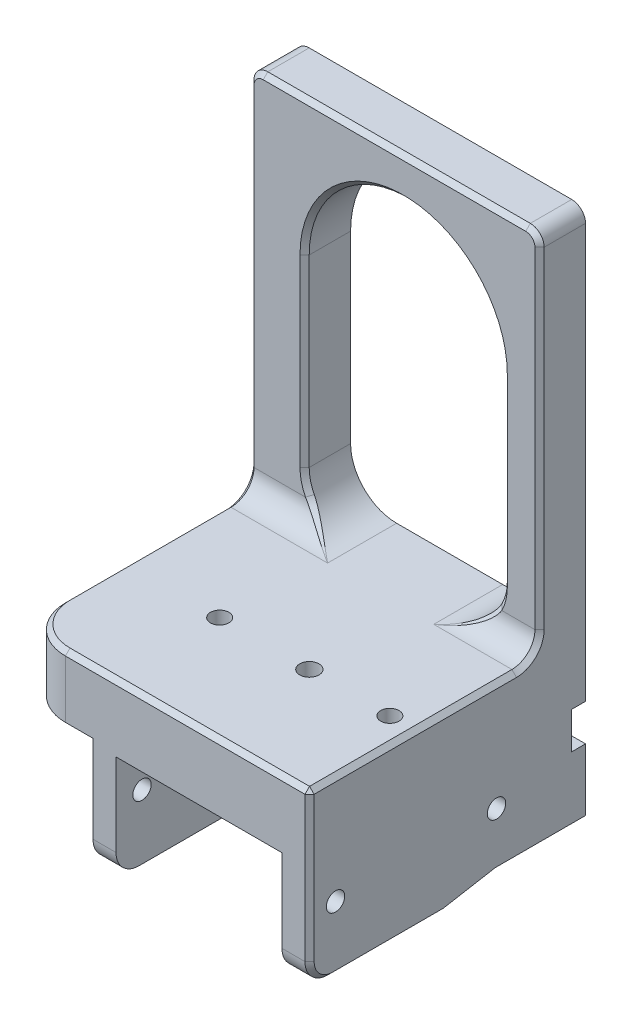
ISO-10303-21;
HEADER;
FILE_DESCRIPTION(('STEP AP214'),'2;1');
FILE_NAME('part.step','',(''),(''),'','','');
FILE_SCHEMA(('AUTOMOTIVE_DESIGN { 1 0 10303 214 1 1 1 1 }'));
ENDSEC;
DATA;
#1=APPLICATION_CONTEXT('core data for automotive mechanical design processes');
#2=APPLICATION_PROTOCOL_DEFINITION('international standard','automotive_design',2000,#1);
#3=PRODUCT_CONTEXT('',#1,'mechanical');
#4=PRODUCT('Part','Part','',(#3));
#5=PRODUCT_RELATED_PRODUCT_CATEGORY('part','',(#4));
#6=PRODUCT_DEFINITION_FORMATION('','',#4);
#7=PRODUCT_DEFINITION_CONTEXT('part definition',#1,'design');
#8=PRODUCT_DEFINITION('design','',#6,#7);
#9=PRODUCT_DEFINITION_SHAPE('','',#8);
#10=(LENGTH_UNIT() NAMED_UNIT(*) SI_UNIT(.MILLI.,.METRE.));
#11=(NAMED_UNIT(*) PLANE_ANGLE_UNIT() SI_UNIT($,.RADIAN.));
#12=(NAMED_UNIT(*) SI_UNIT($,.STERADIAN.) SOLID_ANGLE_UNIT());
#13=UNCERTAINTY_MEASURE_WITH_UNIT(LENGTH_MEASURE(1.E-05),#10,'distance_accuracy_value','');
#14=(GEOMETRIC_REPRESENTATION_CONTEXT(3) GLOBAL_UNCERTAINTY_ASSIGNED_CONTEXT((#13)) GLOBAL_UNIT_ASSIGNED_CONTEXT((#10,
#11,#12)) REPRESENTATION_CONTEXT('',''));
#15=CARTESIAN_POINT('',(0.,0.,0.));
#16=DIRECTION('',(0.,0.,1.));
#17=DIRECTION('',(1.,0.,0.));
#18=AXIS2_PLACEMENT_3D('',#15,#16,#17);
#19=CARTESIAN_POINT('',(0.550000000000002,-26.25,7.));
#20=DIRECTION('',(0.,-1.,0.));
#21=DIRECTION('',(0.,0.,-1.));
#22=AXIS2_PLACEMENT_3D('',#19,#20,#21);
#23=PLANE('',#22);
#24=DIRECTION('',(-1.,0.,0.));
#25=VECTOR('',#24,1.);
#26=CARTESIAN_POINT('',(-17.3872539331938,-26.25,-10.5));
#27=LINE('',#26,#25);
#28=CARTESIAN_POINT('',(17.5872539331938,-26.25,-10.5));
#29=VERTEX_POINT('',#28);
#30=CARTESIAN_POINT('',(-18.4872539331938,-26.25,-10.5));
#31=VERTEX_POINT('',#30);
#32=EDGE_CURVE('E408',#29,#31,#27,.T.);
#33=ORIENTED_EDGE('',*,*,#32,.F.);
#34=DIRECTION('',(0.,0.,-1.));
#35=VECTOR('',#34,1.);
#36=CARTESIAN_POINT('',(17.5872539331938,-26.25,30.));
#37=LINE('',#36,#35);
#38=CARTESIAN_POINT('',(17.5872539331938,-26.25,6.00000000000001));
#39=VERTEX_POINT('',#38);
#40=EDGE_CURVE('E400',#39,#29,#37,.T.);
#41=ORIENTED_EDGE('',*,*,#40,.F.);
#42=DIRECTION('',(-1.,0.,0.));
#43=VECTOR('',#42,1.);
#44=CARTESIAN_POINT('',(8.48725393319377,-26.25,6.));
#45=LINE('',#44,#43);
#46=CARTESIAN_POINT('',(8.48725393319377,-26.25,6.));
#47=VERTEX_POINT('',#46);
#48=EDGE_CURVE('E381',#39,#47,#45,.T.);
#49=ORIENTED_EDGE('',*,*,#48,.T.);
#50=CARTESIAN_POINT('',(0.550000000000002,-26.25,7.));
#51=DIRECTION('',(0.,1.,0.));
#52=DIRECTION('',(0.,0.,-1.));
#53=AXIS2_PLACEMENT_3D('',#50,#51,#52);
#54=CIRCLE('',#53,8.);
#55=CARTESIAN_POINT('',(-7.38725393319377,-26.25,6.));
#56=VERTEX_POINT('',#55);
#57=EDGE_CURVE('E392',#47,#56,#54,.T.);
#58=ORIENTED_EDGE('',*,*,#57,.T.);
#59=DIRECTION('',(-1.,0.,0.));
#60=VECTOR('',#59,1.);
#61=CARTESIAN_POINT('',(-15.,-26.25,6.));
#62=LINE('',#61,#60);
#63=CARTESIAN_POINT('',(-18.4872539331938,-26.25,6.));
#64=VERTEX_POINT('',#63);
#65=EDGE_CURVE('E725',#56,#64,#62,.T.);
#66=ORIENTED_EDGE('',*,*,#65,.T.);
#67=DIRECTION('',(0.,0.,1.));
#68=VECTOR('',#67,1.);
#69=CARTESIAN_POINT('',(-18.4872539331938,-26.25,30.));
#70=LINE('',#69,#68);
#71=EDGE_CURVE('E424',#31,#64,#70,.T.);
#72=ORIENTED_EDGE('',*,*,#71,.F.);
#73=EDGE_LOOP('',(#33,#41,#49,#58,#66,#72));
#74=FACE_BOUND('',#73,.T.);
#75=ADVANCED_FACE('F42',(#74),#23,.T.);
#76=CARTESIAN_POINT('',(-17.3872539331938,-28.25,-10.5));
#77=DIRECTION('',(0.,0.,-1.));
#78=DIRECTION('',(-1.,0.,0.));
#79=AXIS2_PLACEMENT_3D('',#76,#77,#78);
#80=PLANE('',#79);
#81=DIRECTION('',(0.,1.,0.));
#82=VECTOR('',#81,1.);
#83=CARTESIAN_POINT('',(17.5872539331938,-30.25,-10.5));
#84=LINE('',#83,#82);
#85=CARTESIAN_POINT('',(17.5872539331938,-28.25,-10.5));
#86=VERTEX_POINT('',#85);
#87=EDGE_CURVE('E416',#86,#29,#84,.T.);
#88=ORIENTED_EDGE('',*,*,#87,.T.);
#89=ORIENTED_EDGE('',*,*,#32,.T.);
#90=DIRECTION('',(0.,1.,0.));
#91=VECTOR('',#90,1.);
#92=CARTESIAN_POINT('',(-18.4872539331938,-30.25,-10.5));
#93=LINE('',#92,#91);
#94=CARTESIAN_POINT('',(-18.4872539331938,-28.25,-10.5));
#95=VERTEX_POINT('',#94);
#96=EDGE_CURVE('E429',#95,#31,#93,.T.);
#97=ORIENTED_EDGE('',*,*,#96,.F.);
#98=DIRECTION('',(-1.,0.,0.));
#99=VECTOR('',#98,1.);
#100=CARTESIAN_POINT('',(-17.3872539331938,-28.25,-10.5));
#101=LINE('',#100,#99);
#102=EDGE_CURVE('E700',#86,#95,#101,.T.);
#103=ORIENTED_EDGE('',*,*,#102,.F.);
#104=EDGE_LOOP('',(#88,#89,#97,#103));
#105=FACE_BOUND('',#104,.T.);
#106=ADVANCED_FACE('F1315',(#105),#80,.F.);
#107=CARTESIAN_POINT('',(-15.,7.25,-30.));
#108=DIRECTION('',(0.,0.,1.));
#109=DIRECTION('',(1.,0.,0.));
#110=AXIS2_PLACEMENT_3D('',#107,#108,#109);
#111=PLANE('',#110);
#112=DIRECTION('',(-1.,0.,0.));
#113=VECTOR('',#112,1.);
#114=CARTESIAN_POINT('',(-15.,7.25,-30.));
#115=LINE('',#114,#113);
#116=CARTESIAN_POINT('',(5.58725393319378,7.25,-30.));
#117=VERTEX_POINT('',#116);
#118=CARTESIAN_POINT('',(-17.4872539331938,7.25,-30.));
#119=VERTEX_POINT('',#118);
#120=EDGE_CURVE('E753',#117,#119,#115,.T.);
#121=ORIENTED_EDGE('',*,*,#120,.F.);
#122=CARTESIAN_POINT('',(5.58725393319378,17.25,-30.));
#123=DIRECTION('',(0.,0.,1.));
#124=DIRECTION('',(1.,0.,0.));
#125=AXIS2_PLACEMENT_3D('',#122,#123,#124);
#126=CIRCLE('',#125,10.);
#127=CARTESIAN_POINT('',(15.5872539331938,17.25,-30.));
#128=VERTEX_POINT('',#127);
#129=EDGE_CURVE('E771',#117,#128,#126,.T.);
#130=ORIENTED_EDGE('',*,*,#129,.T.);
#131=DIRECTION('',(0.,1.,0.));
#132=VECTOR('',#131,1.);
#133=CARTESIAN_POINT('',(15.5872539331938,57.25,-30.));
#134=LINE('',#133,#132);
#135=CARTESIAN_POINT('',(15.5872539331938,57.25,-30.));
#136=VERTEX_POINT('',#135);
#137=EDGE_CURVE('E528',#128,#136,#134,.T.);
#138=ORIENTED_EDGE('',*,*,#137,.T.);
#139=CARTESIAN_POINT('',(-5.95,57.25,-30.));
#140=DIRECTION('',(0.,0.,1.));
#141=DIRECTION('',(-1.,0.,0.));
#142=AXIS2_PLACEMENT_3D('',#139,#140,#141);
#143=CIRCLE('',#142,21.5372539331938);
#144=CARTESIAN_POINT('',(-27.4872539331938,57.25,-30.));
#145=VERTEX_POINT('',#144);
#146=EDGE_CURVE('E532',#136,#145,#143,.T.);
#147=ORIENTED_EDGE('',*,*,#146,.T.);
#148=DIRECTION('',(0.,-1.,0.));
#149=VECTOR('',#148,1.);
#150=CARTESIAN_POINT('',(-27.4872539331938,7.24999999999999,-30.));
#151=LINE('',#150,#149);
#152=CARTESIAN_POINT('',(-27.4872539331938,17.25,-30.));
#153=VERTEX_POINT('',#152);
#154=EDGE_CURVE('E536',#145,#153,#151,.T.);
#155=ORIENTED_EDGE('',*,*,#154,.T.);
#156=CARTESIAN_POINT('',(-17.4872539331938,17.25,-30.));
#157=DIRECTION('',(0.,0.,1.));
#158=DIRECTION('',(1.,0.,0.));
#159=AXIS2_PLACEMENT_3D('',#156,#157,#158);
#160=CIRCLE('',#159,10.);
#161=EDGE_CURVE('E767',#153,#119,#160,.T.);
#162=ORIENTED_EDGE('',*,*,#161,.T.);
#163=EDGE_LOOP('',(#121,#130,#138,#147,#155,#162));
#164=FACE_BOUND('',#163,.T.);
#165=CARTESIAN_POINT('',(-18.4127460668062,2.25,-30.));
#166=DIRECTION('',(0.,0.,-1.));
#167=DIRECTION('',(-1.,0.,0.));
#168=AXIS2_PLACEMENT_3D('',#165,#166,#167);
#169=CIRCLE('',#168,1.99999999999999);
#170=CARTESIAN_POINT('',(-20.4127460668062,2.25,-30.));
#171=VERTEX_POINT('',#170);
#172=EDGE_CURVE('E624',#171,#171,#169,.T.);
#173=ORIENTED_EDGE('',*,*,#172,.F.);
#174=EDGE_LOOP('',(#173));
#175=FACE_BOUND('',#174,.T.);
#176=CARTESIAN_POINT('',(-3.41274606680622,2.25,-30.));
#177=DIRECTION('',(0.,0.,-1.));
#178=DIRECTION('',(-1.,0.,0.));
#179=AXIS2_PLACEMENT_3D('',#176,#177,#178);
#180=CIRCLE('',#179,1.99999999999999);
#181=CARTESIAN_POINT('',(-5.41274606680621,2.25,-30.));
#182=VERTEX_POINT('',#181);
#183=EDGE_CURVE('E616',#182,#182,#180,.T.);
#184=ORIENTED_EDGE('',*,*,#183,.F.);
#185=EDGE_LOOP('',(#184));
#186=FACE_BOUND('',#185,.T.);
#187=CARTESIAN_POINT('',(11.5872539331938,2.25,-30.));
#188=DIRECTION('',(0.,0.,-1.));
#189=DIRECTION('',(-1.,0.,0.));
#190=AXIS2_PLACEMENT_3D('',#187,#188,#189);
#191=CIRCLE('',#190,1.99999999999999);
#192=CARTESIAN_POINT('',(9.58725393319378,2.25,-30.));
#193=VERTEX_POINT('',#192);
#194=EDGE_CURVE('E608',#193,#193,#191,.T.);
#195=ORIENTED_EDGE('',*,*,#194,.F.);
#196=EDGE_LOOP('',(#195));
#197=FACE_BOUND('',#196,.T.);
#198=CARTESIAN_POINT('',(-35.4872539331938,53.25,-30.));
#199=DIRECTION('',(0.,0.,-1.));
#200=DIRECTION('',(-1.,0.,0.));
#201=AXIS2_PLACEMENT_3D('',#198,#199,#200);
#202=CIRCLE('',#201,2.);
#203=CARTESIAN_POINT('',(-37.4872539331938,53.25,-30.));
#204=VERTEX_POINT('',#203);
#205=EDGE_CURVE('E520',#204,#204,#202,.T.);
#206=ORIENTED_EDGE('',*,*,#205,.F.);
#207=EDGE_LOOP('',(#206));
#208=FACE_BOUND('',#207,.T.);
#209=CARTESIAN_POINT('',(19.5872539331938,53.25,-30.));
#210=DIRECTION('',(0.,0.,-1.));
#211=DIRECTION('',(-1.,0.,0.));
#212=AXIS2_PLACEMENT_3D('',#209,#210,#211);
#213=CIRCLE('',#212,2.);
#214=CARTESIAN_POINT('',(17.5872539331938,53.25,-30.));
#215=VERTEX_POINT('',#214);
#216=EDGE_CURVE('E512',#215,#215,#213,.T.);
#217=ORIENTED_EDGE('',*,*,#216,.F.);
#218=EDGE_LOOP('',(#217));
#219=FACE_BOUND('',#218,.T.);
#220=CARTESIAN_POINT('',(19.5872539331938,13.25,-30.));
#221=DIRECTION('',(0.,0.,-1.));
#222=DIRECTION('',(-1.,0.,0.));
#223=AXIS2_PLACEMENT_3D('',#220,#221,#222);
#224=CIRCLE('',#223,2.);
#225=CARTESIAN_POINT('',(17.5872539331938,13.25,-30.));
#226=VERTEX_POINT('',#225);
#227=EDGE_CURVE('E504',#226,#226,#224,.T.);
#228=ORIENTED_EDGE('',*,*,#227,.F.);
#229=EDGE_LOOP('',(#228));
#230=FACE_BOUND('',#229,.T.);
#231=CARTESIAN_POINT('',(-35.4872539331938,13.25,-30.));
#232=DIRECTION('',(0.,0.,-1.));
#233=DIRECTION('',(-1.,0.,0.));
#234=AXIS2_PLACEMENT_3D('',#231,#232,#233);
#235=CIRCLE('',#234,2.);
#236=CARTESIAN_POINT('',(-37.4872539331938,13.25,-30.));
#237=VERTEX_POINT('',#236);
#238=EDGE_CURVE('E496',#237,#237,#235,.T.);
#239=ORIENTED_EDGE('',*,*,#238,.F.);
#240=EDGE_LOOP('',(#239));
#241=FACE_BOUND('',#240,.T.);
#242=CARTESIAN_POINT('',(-35.4872539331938,83.25,-30.));
#243=DIRECTION('',(0.,0.,-1.));
#244=DIRECTION('',(-1.,0.,0.));
#245=AXIS2_PLACEMENT_3D('',#242,#243,#244);
#246=CIRCLE('',#245,2.);
#247=CARTESIAN_POINT('',(-37.4872539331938,83.25,-30.));
#248=VERTEX_POINT('',#247);
#249=EDGE_CURVE('E488',#248,#248,#246,.T.);
#250=ORIENTED_EDGE('',*,*,#249,.F.);
#251=EDGE_LOOP('',(#250));
#252=FACE_BOUND('',#251,.T.);
#253=CARTESIAN_POINT('',(19.5872539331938,83.25,-30.));
#254=DIRECTION('',(0.,0.,-1.));
#255=DIRECTION('',(-1.,0.,0.));
#256=AXIS2_PLACEMENT_3D('',#253,#254,#255);
#257=CIRCLE('',#256,2.);
#258=CARTESIAN_POINT('',(17.5872539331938,83.25,-30.));
#259=VERTEX_POINT('',#258);
#260=EDGE_CURVE('E469',#259,#259,#257,.T.);
#261=ORIENTED_EDGE('',*,*,#260,.F.);
#262=EDGE_LOOP('',(#261));
#263=FACE_BOUND('',#262,.T.);
#264=DIRECTION('',(1.,0.,0.));
#265=VECTOR('',#264,1.);
#266=CARTESIAN_POINT('',(-39.4872539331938,-7.25,-30.));
#267=LINE('',#266,#265);
#268=CARTESIAN_POINT('',(-38.4872539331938,-7.25,-30.));
#269=VERTEX_POINT('',#268);
#270=CARTESIAN_POINT('',(-24.4872539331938,-7.25,-30.));
#271=VERTEX_POINT('',#270);
#272=EDGE_CURVE('E555',#269,#271,#267,.T.);
#273=ORIENTED_EDGE('',*,*,#272,.F.);
#274=DIRECTION('',(-0.707106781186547,0.707106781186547,0.));
#275=VECTOR('',#274,1.);
#276=CARTESIAN_POINT('',(-39.4872539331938,-6.24999999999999,-30.));
#277=LINE('',#276,#275);
#278=CARTESIAN_POINT('',(-39.4872539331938,-6.24999999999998,-30.));
#279=VERTEX_POINT('',#278);
#280=EDGE_CURVE('E975',#269,#279,#277,.T.);
#281=ORIENTED_EDGE('',*,*,#280,.T.);
#282=DIRECTION('',(0.,-1.,0.));
#283=VECTOR('',#282,1.);
#284=CARTESIAN_POINT('',(-39.4872539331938,7.25,-30.));
#285=LINE('',#284,#283);
#286=CARTESIAN_POINT('',(-39.4872539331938,84.25,-30.));
#287=VERTEX_POINT('',#286);
#288=EDGE_CURVE('E551',#287,#279,#285,.T.);
#289=ORIENTED_EDGE('',*,*,#288,.F.);
#290=CARTESIAN_POINT('',(-36.4872539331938,84.25,-30.));
#291=DIRECTION('',(0.,0.,1.));
#292=DIRECTION('',(1.,0.,0.));
#293=AXIS2_PLACEMENT_3D('',#290,#291,#292);
#294=CIRCLE('',#293,3.);
#295=CARTESIAN_POINT('',(-36.4872539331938,87.25,-30.));
#296=VERTEX_POINT('',#295);
#297=EDGE_CURVE('E781',#287,#296,#294,.F.);
#298=ORIENTED_EDGE('',*,*,#297,.T.);
#299=DIRECTION('',(1.,0.,0.));
#300=VECTOR('',#299,1.);
#301=CARTESIAN_POINT('',(23.5872539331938,87.25,-30.));
#302=LINE('',#301,#300);
#303=CARTESIAN_POINT('',(20.5872539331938,87.25,-30.));
#304=VERTEX_POINT('',#303);
#305=EDGE_CURVE('E540',#296,#304,#302,.T.);
#306=ORIENTED_EDGE('',*,*,#305,.T.);
#307=CARTESIAN_POINT('',(20.5872539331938,84.25,-30.));
#308=DIRECTION('',(0.,0.,1.));
#309=DIRECTION('',(1.,0.,0.));
#310=AXIS2_PLACEMENT_3D('',#307,#308,#309);
#311=CIRCLE('',#310,3.);
#312=CARTESIAN_POINT('',(23.5872539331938,84.25,-30.));
#313=VERTEX_POINT('',#312);
#314=EDGE_CURVE('E784',#304,#313,#311,.F.);
#315=ORIENTED_EDGE('',*,*,#314,.T.);
#316=DIRECTION('',(0.,1.,0.));
#317=VECTOR('',#316,1.);
#318=CARTESIAN_POINT('',(23.5872539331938,-28.25,-30.));
#319=LINE('',#318,#317);
#320=CARTESIAN_POINT('',(23.5872539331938,-5.75000000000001,-30.));
#321=VERTEX_POINT('',#320);
#322=EDGE_CURVE('E676',#321,#313,#319,.T.);
#323=ORIENTED_EDGE('',*,*,#322,.F.);
#324=DIRECTION('',(1.,0.,0.));
#325=VECTOR('',#324,1.);
#326=CARTESIAN_POINT('',(23.5872539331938,-5.75000000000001,-30.));
#327=LINE('',#326,#325);
#328=CARTESIAN_POINT('',(-24.4872539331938,-5.75000000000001,-30.));
#329=VERTEX_POINT('',#328);
#330=EDGE_CURVE('E445',#329,#321,#327,.T.);
#331=ORIENTED_EDGE('',*,*,#330,.F.);
#332=DIRECTION('',(0.,1.,0.));
#333=VECTOR('',#332,1.);
#334=CARTESIAN_POINT('',(-24.4872539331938,-5.75000000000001,-30.));
#335=LINE('',#334,#333);
#336=EDGE_CURVE('E460',#271,#329,#335,.T.);
#337=ORIENTED_EDGE('',*,*,#336,.F.);
#338=EDGE_LOOP('',(#273,#281,#289,#298,#306,#315,#323,#331,#337));
#339=FACE_BOUND('',#338,.T.);
#340=ADVANCED_FACE('F1320',(#164,#175,#186,#197,#208,#219,#230,#241,#252,#263,#339),#111,.F.);
#341=CARTESIAN_POINT('',(0.,-7.25,0.));
#342=DIRECTION('',(0.,-1.,0.));
#343=DIRECTION('',(0.,0.,-1.));
#344=AXIS2_PLACEMENT_3D('',#341,#342,#343);
#345=PLANE('',#344);
#346=CARTESIAN_POINT('',(0.550000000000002,-7.25,7.));
#347=DIRECTION('',(0.,1.,0.));
#348=DIRECTION('',(0.,0.,1.));
#349=AXIS2_PLACEMENT_3D('',#346,#347,#348);
#350=CIRCLE('',#349,2.1);
#351=CARTESIAN_POINT('',(0.550000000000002,-7.25,9.1));
#352=VERTEX_POINT('',#351);
#353=EDGE_CURVE('E748',#352,#352,#350,.T.);
#354=ORIENTED_EDGE('',*,*,#353,.T.);
#355=EDGE_LOOP('',(#354));
#356=FACE_BOUND('',#355,.T.);
#357=DIRECTION('',(-1.,0.,0.));
#358=VECTOR('',#357,1.);
#359=CARTESIAN_POINT('',(8.48725393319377,-7.25,6.));
#360=LINE('',#359,#358);
#361=CARTESIAN_POINT('',(17.5872539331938,-7.25,6.));
#362=VERTEX_POINT('',#361);
#363=CARTESIAN_POINT('',(8.48725393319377,-7.25,6.));
#364=VERTEX_POINT('',#363);
#365=EDGE_CURVE('E721',#362,#364,#360,.T.);
#366=ORIENTED_EDGE('',*,*,#365,.F.);
#367=DIRECTION('',(0.,0.,-1.));
#368=VECTOR('',#367,1.);
#369=CARTESIAN_POINT('',(17.5872539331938,-7.25,30.));
#370=LINE('',#369,#368);
#371=CARTESIAN_POINT('',(17.5872539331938,-7.25,30.));
#372=VERTEX_POINT('',#371);
#373=EDGE_CURVE('E402',#372,#362,#370,.T.);
#374=ORIENTED_EDGE('',*,*,#373,.F.);
#375=DIRECTION('',(1.,0.,0.));
#376=VECTOR('',#375,1.);
#377=CARTESIAN_POINT('',(-15.,-7.25,30.));
#378=LINE('',#377,#376);
#379=CARTESIAN_POINT('',(-18.4872539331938,-7.25,30.));
#380=VERTEX_POINT('',#379);
#381=EDGE_CURVE('E752',#380,#372,#378,.T.);
#382=ORIENTED_EDGE('',*,*,#381,.F.);
#383=DIRECTION('',(0.,0.,1.));
#384=VECTOR('',#383,1.);
#385=CARTESIAN_POINT('',(-18.4872539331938,-7.25,30.));
#386=LINE('',#385,#384);
#387=CARTESIAN_POINT('',(-18.4872539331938,-7.25,6.));
#388=VERTEX_POINT('',#387);
#389=EDGE_CURVE('E599',#388,#380,#386,.T.);
#390=ORIENTED_EDGE('',*,*,#389,.F.);
#391=DIRECTION('',(-1.,0.,0.));
#392=VECTOR('',#391,1.);
#393=CARTESIAN_POINT('',(-15.,-7.25,6.));
#394=LINE('',#393,#392);
#395=CARTESIAN_POINT('',(-7.38725393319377,-7.25,6.));
#396=VERTEX_POINT('',#395);
#397=EDGE_CURVE('E393',#396,#388,#394,.T.);
#398=ORIENTED_EDGE('',*,*,#397,.F.);
#399=CARTESIAN_POINT('',(0.550000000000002,-7.25,7.));
#400=DIRECTION('',(0.,1.,0.));
#401=DIRECTION('',(0.,0.,-1.));
#402=AXIS2_PLACEMENT_3D('',#399,#400,#401);
#403=CIRCLE('',#402,8.);
#404=EDGE_CURVE('E732',#364,#396,#403,.T.);
#405=ORIENTED_EDGE('',*,*,#404,.F.);
#406=EDGE_LOOP('',(#366,#374,#382,#390,#398,#405));
#407=FACE_BOUND('',#406,.T.);
#408=ADVANCED_FACE('F1339',(#356,#407),#345,.T.);
#409=CARTESIAN_POINT('',(8.48725393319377,-26.25,6.));
#410=DIRECTION('',(0.,0.,-1.));
#411=DIRECTION('',(-1.,0.,0.));
#412=AXIS2_PLACEMENT_3D('',#409,#410,#411);
#413=PLANE('',#412);
#414=CARTESIAN_POINT('',(13.4872539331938,-16.75,6.00000000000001));
#415=DIRECTION('',(0.,0.,1.));
#416=DIRECTION('',(1.,0.,0.));
#417=AXIS2_PLACEMENT_3D('',#414,#415,#416);
#418=CIRCLE('',#417,2.);
#419=CARTESIAN_POINT('',(15.4872539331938,-16.75,6.00000000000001));
#420=VERTEX_POINT('',#419);
#421=EDGE_CURVE('E714',#420,#420,#418,.T.);
#422=ORIENTED_EDGE('',*,*,#421,.F.);
#423=EDGE_LOOP('',(#422));
#424=FACE_BOUND('',#423,.T.);
#425=DIRECTION('',(0.,1.,0.));
#426=VECTOR('',#425,1.);
#427=CARTESIAN_POINT('',(17.5872539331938,-50.988633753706,6.));
#428=LINE('',#427,#426);
#429=EDGE_CURVE('E384',#39,#362,#428,.T.);
#430=ORIENTED_EDGE('',*,*,#429,.T.);
#431=ORIENTED_EDGE('',*,*,#365,.T.);
#432=DIRECTION('',(0.,1.,0.));
#433=VECTOR('',#432,1.);
#434=CARTESIAN_POINT('',(8.48725393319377,-26.25,6.));
#435=LINE('',#434,#433);
#436=EDGE_CURVE('E387',#47,#364,#435,.T.);
#437=ORIENTED_EDGE('',*,*,#436,.F.);
#438=ORIENTED_EDGE('',*,*,#48,.F.);
#439=EDGE_LOOP('',(#430,#431,#437,#438));
#440=FACE_BOUND('',#439,.T.);
#441=ADVANCED_FACE('F383',(#424,#440),#413,.F.);
#442=CARTESIAN_POINT('',(-15.,-26.25,6.));
#443=DIRECTION('',(0.,0.,-1.));
#444=DIRECTION('',(-1.,0.,0.));
#445=AXIS2_PLACEMENT_3D('',#442,#443,#444);
#446=PLANE('',#445);
#447=CARTESIAN_POINT('',(-12.3872539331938,-16.75,6.00000000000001));
#448=DIRECTION('',(0.,0.,1.));
#449=DIRECTION('',(1.,0.,0.));
#450=AXIS2_PLACEMENT_3D('',#447,#448,#449);
#451=CIRCLE('',#450,2.);
#452=CARTESIAN_POINT('',(-10.3872539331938,-16.75,6.00000000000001));
#453=VERTEX_POINT('',#452);
#454=EDGE_CURVE('E704',#453,#453,#451,.T.);
#455=ORIENTED_EDGE('',*,*,#454,.F.);
#456=EDGE_LOOP('',(#455));
#457=FACE_BOUND('',#456,.T.);
#458=DIRECTION('',(0.,1.,0.));
#459=VECTOR('',#458,1.);
#460=CARTESIAN_POINT('',(-18.4872539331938,-50.988633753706,6.));
#461=LINE('',#460,#459);
#462=EDGE_CURVE('E404',#64,#388,#461,.T.);
#463=ORIENTED_EDGE('',*,*,#462,.F.);
#464=ORIENTED_EDGE('',*,*,#65,.F.);
#465=DIRECTION('',(0.,1.,0.));
#466=VECTOR('',#465,1.);
#467=CARTESIAN_POINT('',(-7.38725393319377,-26.25,6.));
#468=LINE('',#467,#466);
#469=EDGE_CURVE('E729',#56,#396,#468,.T.);
#470=ORIENTED_EDGE('',*,*,#469,.T.);
#471=ORIENTED_EDGE('',*,*,#397,.T.);
#472=EDGE_LOOP('',(#463,#464,#470,#471));
#473=FACE_BOUND('',#472,.T.);
#474=ADVANCED_FACE('F1327',(#457,#473),#446,.F.);
#475=CARTESIAN_POINT('',(23.5872539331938,-27.25,-30.));
#476=VERTEX_POINT('',#475);
#477=CARTESIAN_POINT('',(23.5872539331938,-13.75,-30.));
#478=VERTEX_POINT('',#477);
#479=EDGE_CURVE('E677',#476,#478,#319,.T.);
#480=ORIENTED_EDGE('',*,*,#479,.F.);
#481=DIRECTION('',(-0.707106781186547,-0.707106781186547,0.));
#482=VECTOR('',#481,1.);
#483=CARTESIAN_POINT('',(23.5872539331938,-27.25,-30.));
#484=LINE('',#483,#482);
#485=CARTESIAN_POINT('',(22.5872539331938,-28.25,-30.));
#486=VERTEX_POINT('',#485);
#487=EDGE_CURVE('E896',#476,#486,#484,.T.);
#488=ORIENTED_EDGE('',*,*,#487,.T.);
#489=DIRECTION('',(1.,0.,0.));
#490=VECTOR('',#489,1.);
#491=CARTESIAN_POINT('',(-17.3872539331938,-28.25,-30.));
#492=LINE('',#491,#490);
#493=CARTESIAN_POINT('',(-23.4872539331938,-28.25,-30.));
#494=VERTEX_POINT('',#493);
#495=EDGE_CURVE('E696',#494,#486,#492,.T.);
#496=ORIENTED_EDGE('',*,*,#495,.F.);
#497=DIRECTION('',(-0.707106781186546,0.707106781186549,0.));
#498=VECTOR('',#497,1.);
#499=CARTESIAN_POINT('',(-24.4872539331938,-27.25,-30.));
#500=LINE('',#499,#498);
#501=CARTESIAN_POINT('',(-24.4872539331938,-27.25,-30.));
#502=VERTEX_POINT('',#501);
#503=EDGE_CURVE('E893',#494,#502,#500,.T.);
#504=ORIENTED_EDGE('',*,*,#503,.T.);
#505=DIRECTION('',(0.,-1.,0.));
#506=VECTOR('',#505,1.);
#507=CARTESIAN_POINT('',(-24.4872539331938,7.25,-30.));
#508=LINE('',#507,#506);
#509=CARTESIAN_POINT('',(-24.4872539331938,-13.75,-30.));
#510=VERTEX_POINT('',#509);
#511=EDGE_CURVE('E672',#510,#502,#508,.T.);
#512=ORIENTED_EDGE('',*,*,#511,.F.);
#513=DIRECTION('',(-1.,0.,0.));
#514=VECTOR('',#513,1.);
#515=CARTESIAN_POINT('',(23.5872539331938,-13.75,-30.));
#516=LINE('',#515,#514);
#517=EDGE_CURVE('E439',#478,#510,#516,.T.);
#518=ORIENTED_EDGE('',*,*,#517,.F.);
#519=EDGE_LOOP('',(#480,#488,#496,#504,#512,#518));
#520=FACE_BOUND('',#519,.T.);
#521=CARTESIAN_POINT('',(-18.4127460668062,-21.75,-30.));
#522=DIRECTION('',(0.,0.,-1.));
#523=DIRECTION('',(-1.,0.,0.));
#524=AXIS2_PLACEMENT_3D('',#521,#522,#523);
#525=CIRCLE('',#524,1.99999999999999);
#526=CARTESIAN_POINT('',(-20.4127460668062,-21.75,-30.));
#527=VERTEX_POINT('',#526);
#528=EDGE_CURVE('E632',#527,#527,#525,.T.);
#529=ORIENTED_EDGE('',*,*,#528,.F.);
#530=EDGE_LOOP('',(#529));
#531=FACE_BOUND('',#530,.T.);
#532=CARTESIAN_POINT('',(-3.41274606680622,-21.75,-30.));
#533=DIRECTION('',(0.,0.,-1.));
#534=DIRECTION('',(-1.,0.,0.));
#535=AXIS2_PLACEMENT_3D('',#532,#533,#534);
#536=CIRCLE('',#535,1.99999999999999);
#537=CARTESIAN_POINT('',(-5.41274606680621,-21.75,-30.));
#538=VERTEX_POINT('',#537);
#539=EDGE_CURVE('E640',#538,#538,#536,.T.);
#540=ORIENTED_EDGE('',*,*,#539,.F.);
#541=EDGE_LOOP('',(#540));
#542=FACE_BOUND('',#541,.T.);
#543=CARTESIAN_POINT('',(11.5872539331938,-21.75,-30.));
#544=DIRECTION('',(0.,0.,-1.));
#545=DIRECTION('',(-1.,0.,0.));
#546=AXIS2_PLACEMENT_3D('',#543,#544,#545);
#547=CIRCLE('',#546,1.99999999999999);
#548=CARTESIAN_POINT('',(9.58725393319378,-21.75,-30.));
#549=VERTEX_POINT('',#548);
#550=EDGE_CURVE('E648',#549,#549,#547,.T.);
#551=ORIENTED_EDGE('',*,*,#550,.F.);
#552=EDGE_LOOP('',(#551));
#553=FACE_BOUND('',#552,.T.);
#554=ADVANCED_FACE('F1330',(#520,#531,#542,#553),#111,.F.);
#555=CARTESIAN_POINT('',(-15.,7.25,30.));
#556=DIRECTION('',(0.,0.,-1.));
#557=DIRECTION('',(-1.,0.,0.));
#558=AXIS2_PLACEMENT_3D('',#555,#556,#557);
#559=PLANE('',#558);
#560=DIRECTION('',(1.,0.,0.));
#561=VECTOR('',#560,1.);
#562=CARTESIAN_POINT('',(-15.,-6.24999999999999,30.));
#563=LINE('',#562,#561);
#564=CARTESIAN_POINT('',(-29.4872539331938,-6.24999999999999,30.));
#565=VERTEX_POINT('',#564);
#566=CARTESIAN_POINT('',(-23.4872539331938,-6.24999999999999,30.));
#567=VERTEX_POINT('',#566);
#568=EDGE_CURVE('E936',#565,#567,#563,.T.);
#569=ORIENTED_EDGE('',*,*,#568,.T.);
#570=DIRECTION('',(0.,-1.,0.));
#571=VECTOR('',#570,1.);
#572=CARTESIAN_POINT('',(-23.4872539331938,-25.25,30.));
#573=LINE('',#572,#571);
#574=CARTESIAN_POINT('',(-23.4872539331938,-25.25,30.));
#575=VERTEX_POINT('',#574);
#576=EDGE_CURVE('E939',#567,#575,#573,.T.);
#577=ORIENTED_EDGE('',*,*,#576,.T.);
#578=DIRECTION('',(-1.,0.,0.));
#579=VECTOR('',#578,1.);
#580=CARTESIAN_POINT('',(-18.4872539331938,-25.25,30.));
#581=LINE('',#580,#579);
#582=CARTESIAN_POINT('',(-18.4872539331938,-25.25,30.));
#583=VERTEX_POINT('',#582);
#584=EDGE_CURVE('E851',#575,#583,#581,.F.);
#585=ORIENTED_EDGE('',*,*,#584,.T.);
#586=DIRECTION('',(0.,1.,0.));
#587=VECTOR('',#586,1.);
#588=CARTESIAN_POINT('',(-18.4872539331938,-50.988633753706,30.));
#589=LINE('',#588,#587);
#590=EDGE_CURVE('E603',#583,#380,#589,.T.);
#591=ORIENTED_EDGE('',*,*,#590,.T.);
#592=ORIENTED_EDGE('',*,*,#381,.T.);
#593=DIRECTION('',(0.,1.,0.));
#594=VECTOR('',#593,1.);
#595=CARTESIAN_POINT('',(17.5872539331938,-50.988633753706,30.));
#596=LINE('',#595,#594);
#597=CARTESIAN_POINT('',(17.5872539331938,-25.25,30.));
#598=VERTEX_POINT('',#597);
#599=EDGE_CURVE('E594',#598,#372,#596,.T.);
#600=ORIENTED_EDGE('',*,*,#599,.F.);
#601=DIRECTION('',(-1.,0.,0.));
#602=VECTOR('',#601,1.);
#603=CARTESIAN_POINT('',(-15.,-25.25,30.));
#604=LINE('',#603,#602);
#605=CARTESIAN_POINT('',(22.5872539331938,-25.25,30.));
#606=VERTEX_POINT('',#605);
#607=EDGE_CURVE('E854',#598,#606,#604,.F.);
#608=ORIENTED_EDGE('',*,*,#607,.T.);
#609=DIRECTION('',(0.,1.,0.));
#610=VECTOR('',#609,1.);
#611=CARTESIAN_POINT('',(22.5872539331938,7.25,30.));
#612=LINE('',#611,#610);
#613=CARTESIAN_POINT('',(22.5872539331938,6.25,30.));
#614=VERTEX_POINT('',#613);
#615=EDGE_CURVE('E933',#606,#614,#612,.T.);
#616=ORIENTED_EDGE('',*,*,#615,.T.);
#617=DIRECTION('',(-1.,0.,0.));
#618=VECTOR('',#617,1.);
#619=CARTESIAN_POINT('',(-15.,6.25,30.));
#620=LINE('',#619,#618);
#621=CARTESIAN_POINT('',(-29.4872539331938,6.25,30.));
#622=VERTEX_POINT('',#621);
#623=EDGE_CURVE('E930',#614,#622,#620,.T.);
#624=ORIENTED_EDGE('',*,*,#623,.T.);
#625=DIRECTION('',(0.,1.,0.));
#626=VECTOR('',#625,1.);
#627=CARTESIAN_POINT('',(-29.4872539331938,-7.25,30.));
#628=LINE('',#627,#626);
#629=EDGE_CURVE('E826',#622,#565,#628,.F.);
#630=ORIENTED_EDGE('',*,*,#629,.T.);
#631=EDGE_LOOP('',(#569,#577,#585,#591,#592,#600,#608,#616,#624,#630));
#632=FACE_BOUND('',#631,.T.);
#633=ADVANCED_FACE('F1347',(#632),#559,.F.);
#634=CARTESIAN_POINT('',(0.,7.25,0.));
#635=DIRECTION('',(0.,-1.,0.));
#636=DIRECTION('',(0.,0.,-1.));
#637=AXIS2_PLACEMENT_3D('',#634,#635,#636);
#638=PLANE('',#637);
#639=CARTESIAN_POINT('',(-18.95,7.25,7.));
#640=DIRECTION('',(0.,1.,0.));
#641=DIRECTION('',(0.,0.,1.));
#642=AXIS2_PLACEMENT_3D('',#639,#640,#641);
#643=CIRCLE('',#642,2.);
#644=CARTESIAN_POINT('',(-18.95,7.25,9.));
#645=VERTEX_POINT('',#644);
#646=EDGE_CURVE('E656',#645,#645,#643,.T.);
#647=ORIENTED_EDGE('',*,*,#646,.F.);
#648=EDGE_LOOP('',(#647));
#649=FACE_BOUND('',#648,.T.);
#650=CARTESIAN_POINT('',(18.05,7.25,7.));
#651=DIRECTION('',(0.,1.,0.));
#652=DIRECTION('',(0.,0.,1.));
#653=AXIS2_PLACEMENT_3D('',#650,#651,#652);
#654=CIRCLE('',#653,2.);
#655=CARTESIAN_POINT('',(18.05,7.25,9.));
#656=VERTEX_POINT('',#655);
#657=EDGE_CURVE('E664',#656,#656,#654,.T.);
#658=ORIENTED_EDGE('',*,*,#657,.F.);
#659=EDGE_LOOP('',(#658));
#660=FACE_BOUND('',#659,.T.);
#661=DIRECTION('',(-1.,0.,0.));
#662=VECTOR('',#661,1.);
#663=CARTESIAN_POINT('',(-39.4872539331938,7.25,-15.));
#664=LINE('',#663,#662);
#665=CARTESIAN_POINT('',(-17.4872539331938,7.25,-15.));
#666=VERTEX_POINT('',#665);
#667=CARTESIAN_POINT('',(-38.4872539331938,7.25,-15.));
#668=VERTEX_POINT('',#667);
#669=EDGE_CURVE('E794',#666,#668,#664,.T.);
#670=ORIENTED_EDGE('',*,*,#669,.T.);
#671=DIRECTION('',(0.,0.,1.));
#672=VECTOR('',#671,1.);
#673=CARTESIAN_POINT('',(-38.4872539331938,7.25,20.));
#674=LINE('',#673,#672);
#675=CARTESIAN_POINT('',(-38.4872539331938,7.25,20.));
#676=VERTEX_POINT('',#675);
#677=EDGE_CURVE('E988',#668,#676,#674,.T.);
#678=ORIENTED_EDGE('',*,*,#677,.T.);
#679=CARTESIAN_POINT('',(-29.4872539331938,7.25,20.));
#680=DIRECTION('',(0.,-1.,0.));
#681=DIRECTION('',(0.,0.,-1.));
#682=AXIS2_PLACEMENT_3D('',#679,#680,#681);
#683=CIRCLE('',#682,9.);
#684=CARTESIAN_POINT('',(-29.4872539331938,7.25,29.));
#685=VERTEX_POINT('',#684);
#686=EDGE_CURVE('E985',#676,#685,#683,.F.);
#687=ORIENTED_EDGE('',*,*,#686,.T.);
#688=DIRECTION('',(1.,0.,0.));
#689=VECTOR('',#688,1.);
#690=CARTESIAN_POINT('',(0.,7.25,29.));
#691=LINE('',#690,#689);
#692=CARTESIAN_POINT('',(22.5872539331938,7.25,29.));
#693=VERTEX_POINT('',#692);
#694=EDGE_CURVE('E981',#685,#693,#691,.T.);
#695=ORIENTED_EDGE('',*,*,#694,.T.);
#696=DIRECTION('',(0.,0.,-1.));
#697=VECTOR('',#696,1.);
#698=CARTESIAN_POINT('',(22.5872539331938,7.25,-15.));
#699=LINE('',#698,#697);
#700=CARTESIAN_POINT('',(22.5872539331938,7.25,-15.));
#701=VERTEX_POINT('',#700);
#702=EDGE_CURVE('E978',#693,#701,#699,.T.);
#703=ORIENTED_EDGE('',*,*,#702,.T.);
#704=DIRECTION('',(-1.,0.,0.));
#705=VECTOR('',#704,1.);
#706=CARTESIAN_POINT('',(5.58725393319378,7.25,-15.));
#707=LINE('',#706,#705);
#708=CARTESIAN_POINT('',(5.58725393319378,7.25,-15.));
#709=VERTEX_POINT('',#708);
#710=EDGE_CURVE('E804',#701,#709,#707,.T.);
#711=ORIENTED_EDGE('',*,*,#710,.T.);
#712=DIRECTION('',(0.,0.,-1.));
#713=VECTOR('',#712,1.);
#714=CARTESIAN_POINT('',(5.58725393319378,7.25,0.));
#715=LINE('',#714,#713);
#716=EDGE_CURVE('E763',#709,#117,#715,.T.);
#717=ORIENTED_EDGE('',*,*,#716,.T.);
#718=ORIENTED_EDGE('',*,*,#120,.T.);
#719=DIRECTION('',(0.,0.,-1.));
#720=VECTOR('',#719,1.);
#721=CARTESIAN_POINT('',(-17.4872539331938,7.25,0.));
#722=LINE('',#721,#720);
#723=EDGE_CURVE('E768',#119,#666,#722,.F.);
#724=ORIENTED_EDGE('',*,*,#723,.T.);
#725=EDGE_LOOP('',(#670,#678,#687,#695,#703,#711,#717,#718,#724));
#726=FACE_BOUND('',#725,.T.);
#727=CARTESIAN_POINT('',(0.550000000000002,7.25,7.));
#728=DIRECTION('',(0.,1.,0.));
#729=DIRECTION('',(0.,0.,1.));
#730=AXIS2_PLACEMENT_3D('',#727,#728,#729);
#731=CIRCLE('',#730,2.1);
#732=CARTESIAN_POINT('',(0.550000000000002,7.25,9.1));
#733=VERTEX_POINT('',#732);
#734=EDGE_CURVE('E744',#733,#733,#731,.T.);
#735=ORIENTED_EDGE('',*,*,#734,.F.);
#736=EDGE_LOOP('',(#735));
#737=FACE_BOUND('',#736,.T.);
#738=ADVANCED_FACE('F1343',(#649,#660,#726,#737),#638,.F.);
#739=CARTESIAN_POINT('',(0.550000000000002,7.25,7.));
#740=DIRECTION('',(0.,1.,0.));
#741=DIRECTION('',(0.,0.,1.));
#742=AXIS2_PLACEMENT_3D('',#739,#740,#741);
#743=CYLINDRICAL_SURFACE('',#742,2.1);
#744=ORIENTED_EDGE('',*,*,#353,.F.);
#745=EDGE_LOOP('',(#744));
#746=FACE_BOUND('',#745,.T.);
#747=ORIENTED_EDGE('',*,*,#734,.T.);
#748=EDGE_LOOP('',(#747));
#749=FACE_BOUND('',#748,.T.);
#750=ADVANCED_FACE('F1335',(#746,#749),#743,.F.);
#751=CARTESIAN_POINT('',(0.550000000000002,-26.25,7.));
#752=DIRECTION('',(0.,1.,0.));
#753=DIRECTION('',(0.,0.,1.));
#754=AXIS2_PLACEMENT_3D('',#751,#752,#753);
#755=CYLINDRICAL_SURFACE('',#754,8.);
#756=ORIENTED_EDGE('',*,*,#404,.T.);
#757=ORIENTED_EDGE('',*,*,#469,.F.);
#758=ORIENTED_EDGE('',*,*,#57,.F.);
#759=ORIENTED_EDGE('',*,*,#436,.T.);
#760=EDGE_LOOP('',(#756,#757,#758,#759));
#761=FACE_BOUND('',#760,.T.);
#762=ADVANCED_FACE('F1332',(#761),#755,.F.);
#763=CARTESIAN_POINT('',(13.4872539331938,-16.75,0.));
#764=DIRECTION('',(0.,0.,-1.));
#765=DIRECTION('',(-1.,0.,0.));
#766=AXIS2_PLACEMENT_3D('',#763,#764,#765);
#767=PLANE('',#766);
#768=CARTESIAN_POINT('',(13.4872539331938,-16.75,0.));
#769=DIRECTION('',(0.,0.,1.));
#770=DIRECTION('',(1.,0.,0.));
#771=AXIS2_PLACEMENT_3D('',#768,#769,#770);
#772=CIRCLE('',#771,2.);
#773=CARTESIAN_POINT('',(15.4872539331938,-16.75,0.));
#774=VERTEX_POINT('',#773);
#775=EDGE_CURVE('E718',#774,#774,#772,.T.);
#776=ORIENTED_EDGE('',*,*,#775,.T.);
#777=EDGE_LOOP('',(#776));
#778=FACE_BOUND('',#777,.T.);
#779=ADVANCED_FACE('F1325',(#778),#767,.F.);
#780=CARTESIAN_POINT('',(13.4872539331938,-16.75,6.00000000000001));
#781=DIRECTION('',(0.,0.,1.));
#782=DIRECTION('',(1.,0.,0.));
#783=AXIS2_PLACEMENT_3D('',#780,#781,#782);
#784=CYLINDRICAL_SURFACE('',#783,2.);
#785=ORIENTED_EDGE('',*,*,#775,.F.);
#786=EDGE_LOOP('',(#785));
#787=FACE_BOUND('',#786,.T.);
#788=ORIENTED_EDGE('',*,*,#421,.T.);
#789=EDGE_LOOP('',(#788));
#790=FACE_BOUND('',#789,.T.);
#791=ADVANCED_FACE('F1996',(#787,#790),#784,.F.);
#792=CARTESIAN_POINT('',(-12.3872539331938,-16.75,0.));
#793=DIRECTION('',(0.,0.,-1.));
#794=DIRECTION('',(-1.,0.,0.));
#795=AXIS2_PLACEMENT_3D('',#792,#793,#794);
#796=PLANE('',#795);
#797=CARTESIAN_POINT('',(-12.3872539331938,-16.75,0.));
#798=DIRECTION('',(0.,0.,1.));
#799=DIRECTION('',(1.,0.,0.));
#800=AXIS2_PLACEMENT_3D('',#797,#798,#799);
#801=CIRCLE('',#800,2.);
#802=CARTESIAN_POINT('',(-10.3872539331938,-16.75,0.));
#803=VERTEX_POINT('',#802);
#804=EDGE_CURVE('E710',#803,#803,#801,.T.);
#805=ORIENTED_EDGE('',*,*,#804,.T.);
#806=EDGE_LOOP('',(#805));
#807=FACE_BOUND('',#806,.T.);
#808=ADVANCED_FACE('F1993',(#807),#796,.F.);
#809=CARTESIAN_POINT('',(-12.3872539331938,-16.75,6.00000000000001));
#810=DIRECTION('',(0.,0.,1.));
#811=DIRECTION('',(1.,0.,0.));
#812=AXIS2_PLACEMENT_3D('',#809,#810,#811);
#813=CYLINDRICAL_SURFACE('',#812,2.);
#814=ORIENTED_EDGE('',*,*,#804,.F.);
#815=EDGE_LOOP('',(#814));
#816=FACE_BOUND('',#815,.T.);
#817=ORIENTED_EDGE('',*,*,#454,.T.);
#818=EDGE_LOOP('',(#817));
#819=FACE_BOUND('',#818,.T.);
#820=ADVANCED_FACE('F1988',(#816,#819),#813,.F.);
#821=CARTESIAN_POINT('',(0.,-28.25,0.));
#822=DIRECTION('',(0.,1.,0.));
#823=DIRECTION('',(0.,0.,1.));
#824=AXIS2_PLACEMENT_3D('',#821,#822,#823);
#825=PLANE('',#824);
#826=CARTESIAN_POINT('',(9.55,-28.25,-18.));
#827=DIRECTION('',(0.,-1.,0.));
#828=DIRECTION('',(0.,0.,-1.));
#829=AXIS2_PLACEMENT_3D('',#826,#827,#828);
#830=CIRCLE('',#829,2.);
#831=CARTESIAN_POINT('',(9.55,-28.25,-20.));
#832=VERTEX_POINT('',#831);
#833=EDGE_CURVE('E680',#832,#832,#830,.T.);
#834=ORIENTED_EDGE('',*,*,#833,.F.);
#835=EDGE_LOOP('',(#834));
#836=FACE_BOUND('',#835,.T.);
#837=CARTESIAN_POINT('',(-8.45,-28.25,-18.));
#838=DIRECTION('',(0.,-1.,0.));
#839=DIRECTION('',(0.,0.,-1.));
#840=AXIS2_PLACEMENT_3D('',#837,#838,#839);
#841=CIRCLE('',#840,2.);
#842=CARTESIAN_POINT('',(-8.45,-28.25,-20.));
#843=VERTEX_POINT('',#842);
#844=EDGE_CURVE('E688',#843,#843,#841,.T.);
#845=ORIENTED_EDGE('',*,*,#844,.F.);
#846=EDGE_LOOP('',(#845));
#847=FACE_BOUND('',#846,.T.);
#848=ORIENTED_EDGE('',*,*,#495,.T.);
#849=DIRECTION('',(0.,0.,1.));
#850=VECTOR('',#849,1.);
#851=CARTESIAN_POINT('',(22.5872539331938,-28.25,-10.5));
#852=LINE('',#851,#850);
#853=CARTESIAN_POINT('',(22.5872539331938,-28.25,-10.5));
#854=VERTEX_POINT('',#853);
#855=EDGE_CURVE('E902',#486,#854,#852,.T.);
#856=ORIENTED_EDGE('',*,*,#855,.T.);
#857=EDGE_CURVE('E701',#854,#86,#101,.T.);
#858=ORIENTED_EDGE('',*,*,#857,.T.);
#859=ORIENTED_EDGE('',*,*,#102,.T.);
#860=DIRECTION('',(1.,0.,0.));
#861=VECTOR('',#860,1.);
#862=CARTESIAN_POINT('',(0.,-28.25,-10.5));
#863=LINE('',#862,#861);
#864=CARTESIAN_POINT('',(-23.4872539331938,-28.25,-10.5));
#865=VERTEX_POINT('',#864);
#866=EDGE_CURVE('E436',#865,#95,#863,.T.);
#867=ORIENTED_EDGE('',*,*,#866,.F.);
#868=DIRECTION('',(0.,0.,-1.));
#869=VECTOR('',#868,1.);
#870=CARTESIAN_POINT('',(-23.4872539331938,-28.25,-30.));
#871=LINE('',#870,#869);
#872=EDGE_CURVE('E899',#865,#494,#871,.T.);
#873=ORIENTED_EDGE('',*,*,#872,.T.);
#874=EDGE_LOOP('',(#848,#856,#858,#859,#867,#873));
#875=FACE_BOUND('',#874,.T.);
#876=ADVANCED_FACE('F1784',(#836,#847,#875),#825,.F.);
#877=CARTESIAN_POINT('',(-8.45,-22.25,-18.));
#878=DIRECTION('',(0.,1.,0.));
#879=DIRECTION('',(0.,0.,1.));
#880=AXIS2_PLACEMENT_3D('',#877,#878,#879);
#881=PLANE('',#880);
#882=CARTESIAN_POINT('',(-8.45,-22.25,-18.));
#883=DIRECTION('',(0.,-1.,0.));
#884=DIRECTION('',(0.,0.,-1.));
#885=AXIS2_PLACEMENT_3D('',#882,#883,#884);
#886=CIRCLE('',#885,2.);
#887=CARTESIAN_POINT('',(-8.45,-22.25,-20.));
#888=VERTEX_POINT('',#887);
#889=EDGE_CURVE('E692',#888,#888,#886,.T.);
#890=ORIENTED_EDGE('',*,*,#889,.T.);
#891=EDGE_LOOP('',(#890));
#892=FACE_BOUND('',#891,.T.);
#893=ADVANCED_FACE('F1982',(#892),#881,.F.);
#894=CARTESIAN_POINT('',(-8.45,-28.25,-18.));
#895=DIRECTION('',(0.,-1.,0.));
#896=DIRECTION('',(0.,0.,-1.));
#897=AXIS2_PLACEMENT_3D('',#894,#895,#896);
#898=CYLINDRICAL_SURFACE('',#897,2.);
#899=ORIENTED_EDGE('',*,*,#889,.F.);
#900=EDGE_LOOP('',(#899));
#901=FACE_BOUND('',#900,.T.);
#902=ORIENTED_EDGE('',*,*,#844,.T.);
#903=EDGE_LOOP('',(#902));
#904=FACE_BOUND('',#903,.T.);
#905=ADVANCED_FACE('F1978',(#901,#904),#898,.F.);
#906=CARTESIAN_POINT('',(9.55,-22.25,-18.));
#907=DIRECTION('',(0.,1.,0.));
#908=DIRECTION('',(0.,0.,1.));
#909=AXIS2_PLACEMENT_3D('',#906,#907,#908);
#910=PLANE('',#909);
#911=CARTESIAN_POINT('',(9.55,-22.25,-18.));
#912=DIRECTION('',(0.,-1.,0.));
#913=DIRECTION('',(0.,0.,-1.));
#914=AXIS2_PLACEMENT_3D('',#911,#912,#913);
#915=CIRCLE('',#914,2.);
#916=CARTESIAN_POINT('',(9.55,-22.25,-20.));
#917=VERTEX_POINT('',#916);
#918=EDGE_CURVE('E684',#917,#917,#915,.T.);
#919=ORIENTED_EDGE('',*,*,#918,.T.);
#920=EDGE_LOOP('',(#919));
#921=FACE_BOUND('',#920,.T.);
#922=ADVANCED_FACE('F1974',(#921),#910,.F.);
#923=CARTESIAN_POINT('',(9.55,-28.25,-18.));
#924=DIRECTION('',(0.,-1.,0.));
#925=DIRECTION('',(0.,0.,-1.));
#926=AXIS2_PLACEMENT_3D('',#923,#924,#925);
#927=CYLINDRICAL_SURFACE('',#926,2.);
#928=ORIENTED_EDGE('',*,*,#918,.F.);
#929=EDGE_LOOP('',(#928));
#930=FACE_BOUND('',#929,.T.);
#931=ORIENTED_EDGE('',*,*,#833,.T.);
#932=EDGE_LOOP('',(#931));
#933=FACE_BOUND('',#932,.T.);
#934=ADVANCED_FACE('F1971',(#930,#933),#927,.F.);
#935=CARTESIAN_POINT('',(23.5872539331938,0.,0.));
#936=DIRECTION('',(1.,0.,0.));
#937=DIRECTION('',(0.,0.,-1.));
#938=AXIS2_PLACEMENT_3D('',#935,#936,#937);
#939=PLANE('',#938);
#940=DIRECTION('',(0.,0.173648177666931,-0.984807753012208));
#941=VECTOR('',#940,1.);
#942=CARTESIAN_POINT('',(23.5872539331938,-28.2089562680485,-4.97400008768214));
#943=LINE('',#942,#941);
#944=CARTESIAN_POINT('',(23.5872539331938,-29.25,0.930052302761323));
#945=VERTEX_POINT('',#944);
#946=CARTESIAN_POINT('',(23.5872539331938,-27.25,-10.4125113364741));
#947=VERTEX_POINT('',#946);
#948=EDGE_CURVE('E883',#945,#947,#943,.T.);
#949=ORIENTED_EDGE('',*,*,#948,.T.);
#950=DIRECTION('',(0.,0.,-1.));
#951=VECTOR('',#950,1.);
#952=CARTESIAN_POINT('',(23.5872539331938,-27.25,-30.));
#953=LINE('',#952,#951);
#954=EDGE_CURVE('E887',#947,#476,#953,.T.);
#955=ORIENTED_EDGE('',*,*,#954,.T.);
#956=ORIENTED_EDGE('',*,*,#479,.T.);
#957=DIRECTION('',(0.,0.,-1.));
#958=VECTOR('',#957,1.);
#959=CARTESIAN_POINT('',(23.5872539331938,-13.75,-27.));
#960=LINE('',#959,#958);
#961=CARTESIAN_POINT('',(23.5872539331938,-13.75,-27.));
#962=VERTEX_POINT('',#961);
#963=EDGE_CURVE('E457',#962,#478,#960,.T.);
#964=ORIENTED_EDGE('',*,*,#963,.F.);
#965=DIRECTION('',(0.,-1.,0.));
#966=VECTOR('',#965,1.);
#967=CARTESIAN_POINT('',(23.5872539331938,-5.75000000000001,-27.));
#968=LINE('',#967,#966);
#969=CARTESIAN_POINT('',(23.5872539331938,-5.75000000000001,-27.));
#970=VERTEX_POINT('',#969);
#971=EDGE_CURVE('E440',#970,#962,#968,.T.);
#972=ORIENTED_EDGE('',*,*,#971,.F.);
#973=DIRECTION('',(0.,0.,-1.));
#974=VECTOR('',#973,1.);
#975=CARTESIAN_POINT('',(23.5872539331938,-5.75000000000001,-27.));
#976=LINE('',#975,#974);
#977=EDGE_CURVE('E465',#970,#321,#976,.T.);
#978=ORIENTED_EDGE('',*,*,#977,.T.);
#979=ORIENTED_EDGE('',*,*,#322,.T.);
#980=DIRECTION('',(0.,0.,-1.));
#981=VECTOR('',#980,1.);
#982=CARTESIAN_POINT('',(23.5872539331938,84.25,0.));
#983=LINE('',#982,#981);
#984=CARTESIAN_POINT('',(23.5872539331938,84.25,-21.));
#985=VERTEX_POINT('',#984);
#986=EDGE_CURVE('E787',#313,#985,#983,.F.);
#987=ORIENTED_EDGE('',*,*,#986,.T.);
#988=DIRECTION('',(0.,-1.,0.));
#989=VECTOR('',#988,1.);
#990=CARTESIAN_POINT('',(23.5872539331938,12.25,-21.));
#991=LINE('',#990,#989);
#992=CARTESIAN_POINT('',(23.5872539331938,12.25,-21.));
#993=VERTEX_POINT('',#992);
#994=EDGE_CURVE('E865',#985,#993,#991,.T.);
#995=ORIENTED_EDGE('',*,*,#994,.T.);
#996=CARTESIAN_POINT('',(23.5872539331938,12.25,-15.));
#997=DIRECTION('',(1.,0.,0.));
#998=DIRECTION('',(0.,0.,-1.));
#999=AXIS2_PLACEMENT_3D('',#996,#997,#998);
#1000=CIRCLE('',#999,6.);
#1001=CARTESIAN_POINT('',(23.5872539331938,6.25,-15.));
#1002=VERTEX_POINT('',#1001);
#1003=EDGE_CURVE('E868',#993,#1002,#1000,.F.);
#1004=ORIENTED_EDGE('',*,*,#1003,.T.);
#1005=DIRECTION('',(0.,0.,1.));
#1006=VECTOR('',#1005,1.);
#1007=CARTESIAN_POINT('',(23.5872539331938,6.25,30.));
#1008=LINE('',#1007,#1006);
#1009=CARTESIAN_POINT('',(23.5872539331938,6.25,29.));
#1010=VERTEX_POINT('',#1009);
#1011=EDGE_CURVE('E871',#1002,#1010,#1008,.T.);
#1012=ORIENTED_EDGE('',*,*,#1011,.T.);
#1013=DIRECTION('',(0.,-1.,0.));
#1014=VECTOR('',#1013,1.);
#1015=CARTESIAN_POINT('',(23.5872539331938,-25.25,29.));
#1016=LINE('',#1015,#1014);
#1017=CARTESIAN_POINT('',(23.5872539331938,-25.25,29.));
#1018=VERTEX_POINT('',#1017);
#1019=EDGE_CURVE('E874',#1010,#1018,#1016,.T.);
#1020=ORIENTED_EDGE('',*,*,#1019,.T.);
#1021=CARTESIAN_POINT('',(23.5872539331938,-25.25,25.));
#1022=DIRECTION('',(1.,0.,0.));
#1023=DIRECTION('',(0.,0.,-1.));
#1024=AXIS2_PLACEMENT_3D('',#1021,#1022,#1023);
#1025=CIRCLE('',#1024,4.);
#1026=CARTESIAN_POINT('',(23.5872539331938,-29.25,25.));
#1027=VERTEX_POINT('',#1026);
#1028=EDGE_CURVE('E877',#1018,#1027,#1025,.T.);
#1029=ORIENTED_EDGE('',*,*,#1028,.T.);
#1030=DIRECTION('',(0.,0.,-1.));
#1031=VECTOR('',#1030,1.);
#1032=CARTESIAN_POINT('',(23.5872539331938,-29.25,0.842563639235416));
#1033=LINE('',#1032,#1031);
#1034=EDGE_CURVE('E880',#1027,#945,#1033,.T.);
#1035=ORIENTED_EDGE('',*,*,#1034,.T.);
#1036=EDGE_LOOP('',(#949,#955,#956,#964,#972,#978,#979,#987,#995,#1004,#1012,#1020,#1029,#1035));
#1037=FACE_BOUND('',#1036,.T.);
#1038=CARTESIAN_POINT('',(23.5872539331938,-16.25,24.35));
#1039=DIRECTION('',(1.,0.,0.));
#1040=DIRECTION('',(0.,0.,-1.));
#1041=AXIS2_PLACEMENT_3D('',#1038,#1039,#1040);
#1042=CIRCLE('',#1041,1.99999999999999);
#1043=CARTESIAN_POINT('',(23.5872539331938,-16.25,22.35));
#1044=VERTEX_POINT('',#1043);
#1045=EDGE_CURVE('E578',#1044,#1044,#1042,.T.);
#1046=ORIENTED_EDGE('',*,*,#1045,.F.);
#1047=EDGE_LOOP('',(#1046));
#1048=FACE_BOUND('',#1047,.T.);
#1049=CARTESIAN_POINT('',(23.5872539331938,-16.25,-10.65));
#1050=DIRECTION('',(1.,0.,0.));
#1051=DIRECTION('',(0.,0.,-1.));
#1052=AXIS2_PLACEMENT_3D('',#1049,#1050,#1051);
#1053=CIRCLE('',#1052,1.99999999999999);
#1054=CARTESIAN_POINT('',(23.5872539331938,-16.25,-12.65));
#1055=VERTEX_POINT('',#1054);
#1056=EDGE_CURVE('E586',#1055,#1055,#1053,.T.);
#1057=ORIENTED_EDGE('',*,*,#1056,.F.);
#1058=EDGE_LOOP('',(#1057));
#1059=FACE_BOUND('',#1058,.T.);
#1060=ADVANCED_FACE('F1591',(#1037,#1048,#1059),#939,.T.);
#1061=CARTESIAN_POINT('',(-24.4872539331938,0.,0.));
#1062=DIRECTION('',(-1.,0.,0.));
#1063=DIRECTION('',(0.,0.,1.));
#1064=AXIS2_PLACEMENT_3D('',#1061,#1062,#1063);
#1065=PLANE('',#1064);
#1066=ORIENTED_EDGE('',*,*,#511,.T.);
#1067=DIRECTION('',(0.,0.,1.));
#1068=VECTOR('',#1067,1.);
#1069=CARTESIAN_POINT('',(-24.4872539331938,-27.25,-10.5));
#1070=LINE('',#1069,#1068);
#1071=CARTESIAN_POINT('',(-24.4872539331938,-27.25,-10.4125113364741));
#1072=VERTEX_POINT('',#1071);
#1073=EDGE_CURVE('E917',#502,#1072,#1070,.T.);
#1074=ORIENTED_EDGE('',*,*,#1073,.T.);
#1075=DIRECTION('',(0.,-0.173648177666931,0.984807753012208));
#1076=VECTOR('',#1075,1.);
#1077=CARTESIAN_POINT('',(-24.4872539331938,-28.2089562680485,-4.97400008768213));
#1078=LINE('',#1077,#1076);
#1079=CARTESIAN_POINT('',(-24.4872539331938,-29.25,0.930052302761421));
#1080=VERTEX_POINT('',#1079);
#1081=EDGE_CURVE('E914',#1072,#1080,#1078,.T.);
#1082=ORIENTED_EDGE('',*,*,#1081,.T.);
#1083=DIRECTION('',(0.,0.,1.));
#1084=VECTOR('',#1083,1.);
#1085=CARTESIAN_POINT('',(-24.4872539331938,-29.25,0.));
#1086=LINE('',#1085,#1084);
#1087=CARTESIAN_POINT('',(-24.4872539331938,-29.25,25.));
#1088=VERTEX_POINT('',#1087);
#1089=EDGE_CURVE('E911',#1080,#1088,#1086,.T.);
#1090=ORIENTED_EDGE('',*,*,#1089,.T.);
#1091=CARTESIAN_POINT('',(-24.4872539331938,-25.25,25.));
#1092=DIRECTION('',(-1.,0.,0.));
#1093=DIRECTION('',(0.,0.,1.));
#1094=AXIS2_PLACEMENT_3D('',#1091,#1092,#1093);
#1095=CIRCLE('',#1094,4.);
#1096=CARTESIAN_POINT('',(-24.4872539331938,-25.25,29.));
#1097=VERTEX_POINT('',#1096);
#1098=EDGE_CURVE('E908',#1088,#1097,#1095,.T.);
#1099=ORIENTED_EDGE('',*,*,#1098,.T.);
#1100=DIRECTION('',(0.,1.,0.));
#1101=VECTOR('',#1100,1.);
#1102=CARTESIAN_POINT('',(-24.4872539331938,-7.25,29.));
#1103=LINE('',#1102,#1101);
#1104=CARTESIAN_POINT('',(-24.4872539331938,-7.25,29.));
#1105=VERTEX_POINT('',#1104);
#1106=EDGE_CURVE('E905',#1097,#1105,#1103,.T.);
#1107=ORIENTED_EDGE('',*,*,#1106,.T.);
#1108=DIRECTION('',(0.,0.,1.));
#1109=VECTOR('',#1108,1.);
#1110=CARTESIAN_POINT('',(-24.4872539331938,-7.25,-30.));
#1111=LINE('',#1110,#1109);
#1112=CARTESIAN_POINT('',(-24.4872539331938,-7.25,-27.));
#1113=VERTEX_POINT('',#1112);
#1114=EDGE_CURVE('E548',#1113,#1105,#1111,.T.);
#1115=ORIENTED_EDGE('',*,*,#1114,.F.);
#1116=DIRECTION('',(0.,1.,0.));
#1117=VECTOR('',#1116,1.);
#1118=CARTESIAN_POINT('',(-24.4872539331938,-5.75000000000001,-27.));
#1119=LINE('',#1118,#1117);
#1120=CARTESIAN_POINT('',(-24.4872539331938,-13.75,-27.));
#1121=VERTEX_POINT('',#1120);
#1122=EDGE_CURVE('E450',#1121,#1113,#1119,.T.);
#1123=ORIENTED_EDGE('',*,*,#1122,.F.);
#1124=DIRECTION('',(0.,0.,-1.));
#1125=VECTOR('',#1124,1.);
#1126=CARTESIAN_POINT('',(-24.4872539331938,-13.75,-27.));
#1127=LINE('',#1126,#1125);
#1128=EDGE_CURVE('E474',#1121,#510,#1127,.T.);
#1129=ORIENTED_EDGE('',*,*,#1128,.T.);
#1130=EDGE_LOOP('',(#1066,#1074,#1082,#1090,#1099,#1107,#1115,#1123,#1129));
#1131=FACE_BOUND('',#1130,.T.);
#1132=CARTESIAN_POINT('',(-24.4872539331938,-16.25,24.35));
#1133=DIRECTION('',(-1.,0.,0.));
#1134=DIRECTION('',(0.,0.,1.));
#1135=AXIS2_PLACEMENT_3D('',#1132,#1133,#1134);
#1136=CIRCLE('',#1135,2.);
#1137=CARTESIAN_POINT('',(-24.4872539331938,-16.25,26.35));
#1138=VERTEX_POINT('',#1137);
#1139=EDGE_CURVE('E562',#1138,#1138,#1136,.T.);
#1140=ORIENTED_EDGE('',*,*,#1139,.F.);
#1141=EDGE_LOOP('',(#1140));
#1142=FACE_BOUND('',#1141,.T.);
#1143=CARTESIAN_POINT('',(-24.4872539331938,-16.25,-10.65));
#1144=DIRECTION('',(-1.,0.,0.));
#1145=DIRECTION('',(0.,0.,1.));
#1146=AXIS2_PLACEMENT_3D('',#1143,#1144,#1145);
#1147=CIRCLE('',#1146,2.);
#1148=CARTESIAN_POINT('',(-24.4872539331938,-16.25,-8.65));
#1149=VERTEX_POINT('',#1148);
#1150=EDGE_CURVE('E570',#1149,#1149,#1147,.T.);
#1151=ORIENTED_EDGE('',*,*,#1150,.F.);
#1152=EDGE_LOOP('',(#1151));
#1153=FACE_BOUND('',#1152,.T.);
#1154=ADVANCED_FACE('F1650',(#1131,#1142,#1153),#1065,.T.);
#1155=CARTESIAN_POINT('',(18.05,0.250000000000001,7.));
#1156=DIRECTION('',(0.,-1.,0.));
#1157=DIRECTION('',(0.,0.,-1.));
#1158=AXIS2_PLACEMENT_3D('',#1155,#1156,#1157);
#1159=PLANE('',#1158);
#1160=CARTESIAN_POINT('',(18.05,0.25,7.));
#1161=DIRECTION('',(0.,1.,0.));
#1162=DIRECTION('',(0.,0.,1.));
#1163=AXIS2_PLACEMENT_3D('',#1160,#1161,#1162);
#1164=CIRCLE('',#1163,2.);
#1165=CARTESIAN_POINT('',(18.05,0.25,9.));
#1166=VERTEX_POINT('',#1165);
#1167=EDGE_CURVE('E668',#1166,#1166,#1164,.T.);
#1168=ORIENTED_EDGE('',*,*,#1167,.T.);
#1169=EDGE_LOOP('',(#1168));
#1170=FACE_BOUND('',#1169,.T.);
#1171=ADVANCED_FACE('F1962',(#1170),#1159,.F.);
#1172=CARTESIAN_POINT('',(18.05,7.25,7.));
#1173=DIRECTION('',(0.,1.,0.));
#1174=DIRECTION('',(0.,0.,1.));
#1175=AXIS2_PLACEMENT_3D('',#1172,#1173,#1174);
#1176=CYLINDRICAL_SURFACE('',#1175,2.);
#1177=ORIENTED_EDGE('',*,*,#1167,.F.);
#1178=EDGE_LOOP('',(#1177));
#1179=FACE_BOUND('',#1178,.T.);
#1180=ORIENTED_EDGE('',*,*,#657,.T.);
#1181=EDGE_LOOP('',(#1180));
#1182=FACE_BOUND('',#1181,.T.);
#1183=ADVANCED_FACE('F1958',(#1179,#1182),#1176,.F.);
#1184=CARTESIAN_POINT('',(-18.95,0.250000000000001,7.));
#1185=DIRECTION('',(0.,-1.,0.));
#1186=DIRECTION('',(0.,0.,-1.));
#1187=AXIS2_PLACEMENT_3D('',#1184,#1185,#1186);
#1188=PLANE('',#1187);
#1189=CARTESIAN_POINT('',(-18.95,0.25,7.));
#1190=DIRECTION('',(0.,1.,0.));
#1191=DIRECTION('',(0.,0.,1.));
#1192=AXIS2_PLACEMENT_3D('',#1189,#1190,#1191);
#1193=CIRCLE('',#1192,2.);
#1194=CARTESIAN_POINT('',(-18.95,0.25,9.));
#1195=VERTEX_POINT('',#1194);
#1196=EDGE_CURVE('E660',#1195,#1195,#1193,.T.);
#1197=ORIENTED_EDGE('',*,*,#1196,.T.);
#1198=EDGE_LOOP('',(#1197));
#1199=FACE_BOUND('',#1198,.T.);
#1200=ADVANCED_FACE('F1954',(#1199),#1188,.F.);
#1201=CARTESIAN_POINT('',(-18.95,7.25,7.));
#1202=DIRECTION('',(0.,1.,0.));
#1203=DIRECTION('',(0.,0.,1.));
#1204=AXIS2_PLACEMENT_3D('',#1201,#1202,#1203);
#1205=CYLINDRICAL_SURFACE('',#1204,2.);
#1206=ORIENTED_EDGE('',*,*,#1196,.F.);
#1207=EDGE_LOOP('',(#1206));
#1208=FACE_BOUND('',#1207,.T.);
#1209=ORIENTED_EDGE('',*,*,#646,.T.);
#1210=EDGE_LOOP('',(#1209));
#1211=FACE_BOUND('',#1210,.T.);
#1212=ADVANCED_FACE('F1950',(#1208,#1211),#1205,.F.);
#1213=CARTESIAN_POINT('',(11.5872539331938,-21.75,-23.));
#1214=DIRECTION('',(0.,0.,1.));
#1215=DIRECTION('',(1.,0.,0.));
#1216=AXIS2_PLACEMENT_3D('',#1213,#1214,#1215);
#1217=PLANE('',#1216);
#1218=CARTESIAN_POINT('',(11.5872539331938,-21.75,-23.));
#1219=DIRECTION('',(0.,0.,-1.));
#1220=DIRECTION('',(-1.,0.,0.));
#1221=AXIS2_PLACEMENT_3D('',#1218,#1219,#1220);
#1222=CIRCLE('',#1221,1.99999999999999);
#1223=CARTESIAN_POINT('',(9.58725393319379,-21.75,-23.));
#1224=VERTEX_POINT('',#1223);
#1225=EDGE_CURVE('E652',#1224,#1224,#1222,.T.);
#1226=ORIENTED_EDGE('',*,*,#1225,.T.);
#1227=EDGE_LOOP('',(#1226));
#1228=FACE_BOUND('',#1227,.T.);
#1229=ADVANCED_FACE('F1946',(#1228),#1217,.F.);
#1230=CARTESIAN_POINT('',(11.5872539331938,-21.75,-30.));
#1231=DIRECTION('',(0.,0.,-1.));
#1232=DIRECTION('',(-1.,0.,0.));
#1233=AXIS2_PLACEMENT_3D('',#1230,#1231,#1232);
#1234=CYLINDRICAL_SURFACE('',#1233,1.99999999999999);
#1235=ORIENTED_EDGE('',*,*,#1225,.F.);
#1236=EDGE_LOOP('',(#1235));
#1237=FACE_BOUND('',#1236,.T.);
#1238=ORIENTED_EDGE('',*,*,#550,.T.);
#1239=EDGE_LOOP('',(#1238));
#1240=FACE_BOUND('',#1239,.T.);
#1241=ADVANCED_FACE('F1942',(#1237,#1240),#1234,.F.);
#1242=CARTESIAN_POINT('',(-3.41274606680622,-21.75,-23.));
#1243=DIRECTION('',(0.,0.,1.));
#1244=DIRECTION('',(1.,0.,0.));
#1245=AXIS2_PLACEMENT_3D('',#1242,#1243,#1244);
#1246=PLANE('',#1245);
#1247=CARTESIAN_POINT('',(-3.41274606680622,-21.75,-23.));
#1248=DIRECTION('',(0.,0.,-1.));
#1249=DIRECTION('',(-1.,0.,0.));
#1250=AXIS2_PLACEMENT_3D('',#1247,#1248,#1249);
#1251=CIRCLE('',#1250,1.99999999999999);
#1252=CARTESIAN_POINT('',(-5.41274606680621,-21.75,-23.));
#1253=VERTEX_POINT('',#1252);
#1254=EDGE_CURVE('E644',#1253,#1253,#1251,.T.);
#1255=ORIENTED_EDGE('',*,*,#1254,.T.);
#1256=EDGE_LOOP('',(#1255));
#1257=FACE_BOUND('',#1256,.T.);
#1258=ADVANCED_FACE('F1938',(#1257),#1246,.F.);
#1259=CARTESIAN_POINT('',(-3.41274606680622,-21.75,-30.));
#1260=DIRECTION('',(0.,0.,-1.));
#1261=DIRECTION('',(-1.,0.,0.));
#1262=AXIS2_PLACEMENT_3D('',#1259,#1260,#1261);
#1263=CYLINDRICAL_SURFACE('',#1262,1.99999999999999);
#1264=ORIENTED_EDGE('',*,*,#1254,.F.);
#1265=EDGE_LOOP('',(#1264));
#1266=FACE_BOUND('',#1265,.T.);
#1267=ORIENTED_EDGE('',*,*,#539,.T.);
#1268=EDGE_LOOP('',(#1267));
#1269=FACE_BOUND('',#1268,.T.);
#1270=ADVANCED_FACE('F1934',(#1266,#1269),#1263,.F.);
#1271=CARTESIAN_POINT('',(-18.4127460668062,-21.75,-23.));
#1272=DIRECTION('',(0.,0.,1.));
#1273=DIRECTION('',(1.,0.,0.));
#1274=AXIS2_PLACEMENT_3D('',#1271,#1272,#1273);
#1275=PLANE('',#1274);
#1276=CARTESIAN_POINT('',(-18.4127460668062,-21.75,-23.));
#1277=DIRECTION('',(0.,0.,-1.));
#1278=DIRECTION('',(-1.,0.,0.));
#1279=AXIS2_PLACEMENT_3D('',#1276,#1277,#1278);
#1280=CIRCLE('',#1279,1.99999999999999);
#1281=CARTESIAN_POINT('',(-20.4127460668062,-21.75,-23.));
#1282=VERTEX_POINT('',#1281);
#1283=EDGE_CURVE('E636',#1282,#1282,#1280,.T.);
#1284=ORIENTED_EDGE('',*,*,#1283,.T.);
#1285=EDGE_LOOP('',(#1284));
#1286=FACE_BOUND('',#1285,.T.);
#1287=ADVANCED_FACE('F1930',(#1286),#1275,.F.);
#1288=CARTESIAN_POINT('',(-18.4127460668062,-21.75,-30.));
#1289=DIRECTION('',(0.,0.,-1.));
#1290=DIRECTION('',(-1.,0.,0.));
#1291=AXIS2_PLACEMENT_3D('',#1288,#1289,#1290);
#1292=CYLINDRICAL_SURFACE('',#1291,1.99999999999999);
#1293=ORIENTED_EDGE('',*,*,#1283,.F.);
#1294=EDGE_LOOP('',(#1293));
#1295=FACE_BOUND('',#1294,.T.);
#1296=ORIENTED_EDGE('',*,*,#528,.T.);
#1297=EDGE_LOOP('',(#1296));
#1298=FACE_BOUND('',#1297,.T.);
#1299=ADVANCED_FACE('F1926',(#1295,#1298),#1292,.F.);
#1300=CARTESIAN_POINT('',(-18.4127460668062,2.25,-23.));
#1301=DIRECTION('',(0.,0.,1.));
#1302=DIRECTION('',(1.,0.,0.));
#1303=AXIS2_PLACEMENT_3D('',#1300,#1301,#1302);
#1304=PLANE('',#1303);
#1305=CARTESIAN_POINT('',(-18.4127460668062,2.25,-23.));
#1306=DIRECTION('',(0.,0.,-1.));
#1307=DIRECTION('',(-1.,0.,0.));
#1308=AXIS2_PLACEMENT_3D('',#1305,#1306,#1307);
#1309=CIRCLE('',#1308,1.99999999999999);
#1310=CARTESIAN_POINT('',(-20.4127460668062,2.25,-23.));
#1311=VERTEX_POINT('',#1310);
#1312=EDGE_CURVE('E628',#1311,#1311,#1309,.T.);
#1313=ORIENTED_EDGE('',*,*,#1312,.T.);
#1314=EDGE_LOOP('',(#1313));
#1315=FACE_BOUND('',#1314,.T.);
#1316=ADVANCED_FACE('F1922',(#1315),#1304,.F.);
#1317=CARTESIAN_POINT('',(-18.4127460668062,2.25,-30.));
#1318=DIRECTION('',(0.,0.,-1.));
#1319=DIRECTION('',(-1.,0.,0.));
#1320=AXIS2_PLACEMENT_3D('',#1317,#1318,#1319);
#1321=CYLINDRICAL_SURFACE('',#1320,1.99999999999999);
#1322=ORIENTED_EDGE('',*,*,#1312,.F.);
#1323=EDGE_LOOP('',(#1322));
#1324=FACE_BOUND('',#1323,.T.);
#1325=ORIENTED_EDGE('',*,*,#172,.T.);
#1326=EDGE_LOOP('',(#1325));
#1327=FACE_BOUND('',#1326,.T.);
#1328=ADVANCED_FACE('F1918',(#1324,#1327),#1321,.F.);
#1329=CARTESIAN_POINT('',(-3.41274606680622,2.25,-23.));
#1330=DIRECTION('',(0.,0.,1.));
#1331=DIRECTION('',(1.,0.,0.));
#1332=AXIS2_PLACEMENT_3D('',#1329,#1330,#1331);
#1333=PLANE('',#1332);
#1334=CARTESIAN_POINT('',(-3.41274606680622,2.25,-23.));
#1335=DIRECTION('',(0.,0.,-1.));
#1336=DIRECTION('',(-1.,0.,0.));
#1337=AXIS2_PLACEMENT_3D('',#1334,#1335,#1336);
#1338=CIRCLE('',#1337,1.99999999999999);
#1339=CARTESIAN_POINT('',(-5.41274606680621,2.25,-23.));
#1340=VERTEX_POINT('',#1339);
#1341=EDGE_CURVE('E620',#1340,#1340,#1338,.T.);
#1342=ORIENTED_EDGE('',*,*,#1341,.T.);
#1343=EDGE_LOOP('',(#1342));
#1344=FACE_BOUND('',#1343,.T.);
#1345=ADVANCED_FACE('F1914',(#1344),#1333,.F.);
#1346=CARTESIAN_POINT('',(-3.41274606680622,2.25,-30.));
#1347=DIRECTION('',(0.,0.,-1.));
#1348=DIRECTION('',(-1.,0.,0.));
#1349=AXIS2_PLACEMENT_3D('',#1346,#1347,#1348);
#1350=CYLINDRICAL_SURFACE('',#1349,1.99999999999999);
#1351=ORIENTED_EDGE('',*,*,#1341,.F.);
#1352=EDGE_LOOP('',(#1351));
#1353=FACE_BOUND('',#1352,.T.);
#1354=ORIENTED_EDGE('',*,*,#183,.T.);
#1355=EDGE_LOOP('',(#1354));
#1356=FACE_BOUND('',#1355,.T.);
#1357=ADVANCED_FACE('F1910',(#1353,#1356),#1350,.F.);
#1358=CARTESIAN_POINT('',(11.5872539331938,2.25,-23.));
#1359=DIRECTION('',(0.,0.,1.));
#1360=DIRECTION('',(1.,0.,0.));
#1361=AXIS2_PLACEMENT_3D('',#1358,#1359,#1360);
#1362=PLANE('',#1361);
#1363=CARTESIAN_POINT('',(11.5872539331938,2.25,-23.));
#1364=DIRECTION('',(0.,0.,-1.));
#1365=DIRECTION('',(-1.,0.,0.));
#1366=AXIS2_PLACEMENT_3D('',#1363,#1364,#1365);
#1367=CIRCLE('',#1366,1.99999999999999);
#1368=CARTESIAN_POINT('',(9.58725393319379,2.25,-23.));
#1369=VERTEX_POINT('',#1368);
#1370=EDGE_CURVE('E612',#1369,#1369,#1367,.T.);
#1371=ORIENTED_EDGE('',*,*,#1370,.T.);
#1372=EDGE_LOOP('',(#1371));
#1373=FACE_BOUND('',#1372,.T.);
#1374=ADVANCED_FACE('F1906',(#1373),#1362,.F.);
#1375=CARTESIAN_POINT('',(11.5872539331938,2.25,-30.));
#1376=DIRECTION('',(0.,0.,-1.));
#1377=DIRECTION('',(-1.,0.,0.));
#1378=AXIS2_PLACEMENT_3D('',#1375,#1376,#1377);
#1379=CYLINDRICAL_SURFACE('',#1378,1.99999999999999);
#1380=ORIENTED_EDGE('',*,*,#1370,.F.);
#1381=EDGE_LOOP('',(#1380));
#1382=FACE_BOUND('',#1381,.T.);
#1383=ORIENTED_EDGE('',*,*,#194,.T.);
#1384=EDGE_LOOP('',(#1383));
#1385=FACE_BOUND('',#1384,.T.);
#1386=ADVANCED_FACE('F1902',(#1382,#1385),#1379,.F.);
#1387=CARTESIAN_POINT('',(-18.4872539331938,-50.988633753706,30.));
#1388=DIRECTION('',(-1.,0.,0.));
#1389=DIRECTION('',(0.,0.,1.));
#1390=AXIS2_PLACEMENT_3D('',#1387,#1388,#1389);
#1391=PLANE('',#1390);
#1392=CARTESIAN_POINT('',(-18.4872539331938,-16.25,24.35));
#1393=DIRECTION('',(-1.,0.,0.));
#1394=DIRECTION('',(0.,0.,1.));
#1395=AXIS2_PLACEMENT_3D('',#1392,#1393,#1394);
#1396=CIRCLE('',#1395,2.);
#1397=CARTESIAN_POINT('',(-18.4872539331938,-16.25,26.35));
#1398=VERTEX_POINT('',#1397);
#1399=EDGE_CURVE('E566',#1398,#1398,#1396,.T.);
#1400=ORIENTED_EDGE('',*,*,#1399,.T.);
#1401=EDGE_LOOP('',(#1400));
#1402=FACE_BOUND('',#1401,.T.);
#1403=ORIENTED_EDGE('',*,*,#590,.F.);
#1404=CARTESIAN_POINT('',(-18.4872539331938,-25.25,25.));
#1405=DIRECTION('',(-1.,0.,0.));
#1406=DIRECTION('',(0.,0.,1.));
#1407=AXIS2_PLACEMENT_3D('',#1404,#1405,#1406);
#1408=CIRCLE('',#1407,5.);
#1409=CARTESIAN_POINT('',(-18.4872539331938,-30.25,25.));
#1410=VERTEX_POINT('',#1409);
#1411=EDGE_CURVE('E862',#583,#1410,#1408,.F.);
#1412=ORIENTED_EDGE('',*,*,#1411,.T.);
#1413=DIRECTION('',(0.,0.,1.));
#1414=VECTOR('',#1413,1.);
#1415=CARTESIAN_POINT('',(-18.4872539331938,-30.25,30.));
#1416=LINE('',#1415,#1414);
#1417=CARTESIAN_POINT('',(-18.4872539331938,-30.25,0.842563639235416));
#1418=VERTEX_POINT('',#1417);
#1419=EDGE_CURVE('E425',#1418,#1410,#1416,.T.);
#1420=ORIENTED_EDGE('',*,*,#1419,.F.);
#1421=DIRECTION('',(0.,0.173648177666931,-0.984807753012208));
#1422=VECTOR('',#1421,1.);
#1423=CARTESIAN_POINT('',(-18.4872539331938,-30.25,0.842563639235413));
#1424=LINE('',#1423,#1422);
#1425=EDGE_CURVE('E841',#1418,#95,#1424,.T.);
#1426=ORIENTED_EDGE('',*,*,#1425,.T.);
#1427=ORIENTED_EDGE('',*,*,#96,.T.);
#1428=ORIENTED_EDGE('',*,*,#71,.T.);
#1429=ORIENTED_EDGE('',*,*,#462,.T.);
#1430=ORIENTED_EDGE('',*,*,#389,.T.);
#1431=EDGE_LOOP('',(#1403,#1412,#1420,#1426,#1427,#1428,#1429,#1430));
#1432=FACE_BOUND('',#1431,.T.);
#1433=ADVANCED_FACE('F1789',(#1402,#1432),#1391,.F.);
#1434=CARTESIAN_POINT('',(17.5872539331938,-50.988633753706,30.));
#1435=DIRECTION('',(1.,0.,0.));
#1436=DIRECTION('',(0.,0.,-1.));
#1437=AXIS2_PLACEMENT_3D('',#1434,#1435,#1436);
#1438=PLANE('',#1437);
#1439=CARTESIAN_POINT('',(17.5872539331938,-16.25,24.35));
#1440=DIRECTION('',(1.,0.,0.));
#1441=DIRECTION('',(0.,0.,-1.));
#1442=AXIS2_PLACEMENT_3D('',#1439,#1440,#1441);
#1443=CIRCLE('',#1442,2.);
#1444=CARTESIAN_POINT('',(17.5872539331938,-16.25,22.35));
#1445=VERTEX_POINT('',#1444);
#1446=EDGE_CURVE('E582',#1445,#1445,#1443,.T.);
#1447=ORIENTED_EDGE('',*,*,#1446,.T.);
#1448=EDGE_LOOP('',(#1447));
#1449=FACE_BOUND('',#1448,.T.);
#1450=DIRECTION('',(0.,0.,-1.));
#1451=VECTOR('',#1450,1.);
#1452=CARTESIAN_POINT('',(17.5872539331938,-30.25,30.));
#1453=LINE('',#1452,#1451);
#1454=CARTESIAN_POINT('',(17.5872539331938,-30.25,25.));
#1455=VERTEX_POINT('',#1454);
#1456=CARTESIAN_POINT('',(17.5872539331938,-30.25,0.842563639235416));
#1457=VERTEX_POINT('',#1456);
#1458=EDGE_CURVE('E410',#1455,#1457,#1453,.T.);
#1459=ORIENTED_EDGE('',*,*,#1458,.F.);
#1460=CARTESIAN_POINT('',(17.5872539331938,-25.25,25.));
#1461=DIRECTION('',(1.,0.,0.));
#1462=DIRECTION('',(0.,0.,-1.));
#1463=AXIS2_PLACEMENT_3D('',#1460,#1461,#1462);
#1464=CIRCLE('',#1463,5.);
#1465=EDGE_CURVE('E848',#1455,#598,#1464,.F.);
#1466=ORIENTED_EDGE('',*,*,#1465,.T.);
#1467=ORIENTED_EDGE('',*,*,#599,.T.);
#1468=ORIENTED_EDGE('',*,*,#373,.T.);
#1469=ORIENTED_EDGE('',*,*,#429,.F.);
#1470=ORIENTED_EDGE('',*,*,#40,.T.);
#1471=ORIENTED_EDGE('',*,*,#87,.F.);
#1472=DIRECTION('',(0.,0.173648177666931,-0.984807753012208));
#1473=VECTOR('',#1472,1.);
#1474=CARTESIAN_POINT('',(17.5872539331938,-30.25,0.842563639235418));
#1475=LINE('',#1474,#1473);
#1476=EDGE_CURVE('E834',#86,#1457,#1475,.F.);
#1477=ORIENTED_EDGE('',*,*,#1476,.T.);
#1478=EDGE_LOOP('',(#1459,#1466,#1467,#1468,#1469,#1470,#1471,#1477));
#1479=FACE_BOUND('',#1478,.T.);
#1480=ADVANCED_FACE('F398',(#1449,#1479),#1438,.F.);
#1481=CARTESIAN_POINT('',(17.5872539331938,-16.25,-10.65));
#1482=DIRECTION('',(-1.,0.,0.));
#1483=DIRECTION('',(0.,0.,1.));
#1484=AXIS2_PLACEMENT_3D('',#1481,#1482,#1483);
#1485=PLANE('',#1484);
#1486=CARTESIAN_POINT('',(17.5872539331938,-16.25,-10.65));
#1487=DIRECTION('',(1.,0.,0.));
#1488=DIRECTION('',(0.,0.,-1.));
#1489=AXIS2_PLACEMENT_3D('',#1486,#1487,#1488);
#1490=CIRCLE('',#1489,2.);
#1491=CARTESIAN_POINT('',(17.5872539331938,-16.25,-12.65));
#1492=VERTEX_POINT('',#1491);
#1493=EDGE_CURVE('E590',#1492,#1492,#1490,.T.);
#1494=ORIENTED_EDGE('',*,*,#1493,.T.);
#1495=EDGE_LOOP('',(#1494));
#1496=FACE_BOUND('',#1495,.T.);
#1497=ADVANCED_FACE('F1892',(#1496),#1485,.F.);
#1498=CARTESIAN_POINT('',(23.5872539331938,-16.25,-10.65));
#1499=DIRECTION('',(1.,0.,0.));
#1500=DIRECTION('',(0.,0.,-1.));
#1501=AXIS2_PLACEMENT_3D('',#1498,#1499,#1500);
#1502=CYLINDRICAL_SURFACE('',#1501,1.99999999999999);
#1503=ORIENTED_EDGE('',*,*,#1493,.F.);
#1504=EDGE_LOOP('',(#1503));
#1505=FACE_BOUND('',#1504,.T.);
#1506=ORIENTED_EDGE('',*,*,#1056,.T.);
#1507=EDGE_LOOP('',(#1506));
#1508=FACE_BOUND('',#1507,.T.);
#1509=ADVANCED_FACE('F1888',(#1505,#1508),#1502,.F.);
#1510=CARTESIAN_POINT('',(23.5872539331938,-16.25,24.35));
#1511=DIRECTION('',(1.,0.,0.));
#1512=DIRECTION('',(0.,0.,-1.));
#1513=AXIS2_PLACEMENT_3D('',#1510,#1511,#1512);
#1514=CYLINDRICAL_SURFACE('',#1513,1.99999999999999);
#1515=ORIENTED_EDGE('',*,*,#1446,.F.);
#1516=EDGE_LOOP('',(#1515));
#1517=FACE_BOUND('',#1516,.T.);
#1518=ORIENTED_EDGE('',*,*,#1045,.T.);
#1519=EDGE_LOOP('',(#1518));
#1520=FACE_BOUND('',#1519,.T.);
#1521=ADVANCED_FACE('F1884',(#1517,#1520),#1514,.F.);
#1522=CARTESIAN_POINT('',(-18.4872539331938,-16.25,-10.65));
#1523=DIRECTION('',(1.,0.,0.));
#1524=DIRECTION('',(0.,0.,-1.));
#1525=AXIS2_PLACEMENT_3D('',#1522,#1523,#1524);
#1526=PLANE('',#1525);
#1527=CARTESIAN_POINT('',(-18.4872539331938,-16.25,-10.65));
#1528=DIRECTION('',(-1.,0.,0.));
#1529=DIRECTION('',(0.,0.,1.));
#1530=AXIS2_PLACEMENT_3D('',#1527,#1528,#1529);
#1531=CIRCLE('',#1530,2.);
#1532=CARTESIAN_POINT('',(-18.4872539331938,-16.25,-8.65));
#1533=VERTEX_POINT('',#1532);
#1534=EDGE_CURVE('E574',#1533,#1533,#1531,.T.);
#1535=ORIENTED_EDGE('',*,*,#1534,.T.);
#1536=EDGE_LOOP('',(#1535));
#1537=FACE_BOUND('',#1536,.T.);
#1538=ADVANCED_FACE('F1880',(#1537),#1526,.F.);
#1539=CARTESIAN_POINT('',(-24.4872539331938,-16.25,-10.65));
#1540=DIRECTION('',(-1.,0.,0.));
#1541=DIRECTION('',(0.,0.,1.));
#1542=AXIS2_PLACEMENT_3D('',#1539,#1540,#1541);
#1543=CYLINDRICAL_SURFACE('',#1542,2.);
#1544=ORIENTED_EDGE('',*,*,#1534,.F.);
#1545=EDGE_LOOP('',(#1544));
#1546=FACE_BOUND('',#1545,.T.);
#1547=ORIENTED_EDGE('',*,*,#1150,.T.);
#1548=EDGE_LOOP('',(#1547));
#1549=FACE_BOUND('',#1548,.T.);
#1550=ADVANCED_FACE('F1876',(#1546,#1549),#1543,.F.);
#1551=CARTESIAN_POINT('',(-24.4872539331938,-16.25,24.35));
#1552=DIRECTION('',(-1.,0.,0.));
#1553=DIRECTION('',(0.,0.,1.));
#1554=AXIS2_PLACEMENT_3D('',#1551,#1552,#1553);
#1555=CYLINDRICAL_SURFACE('',#1554,2.);
#1556=ORIENTED_EDGE('',*,*,#1399,.F.);
#1557=EDGE_LOOP('',(#1556));
#1558=FACE_BOUND('',#1557,.T.);
#1559=ORIENTED_EDGE('',*,*,#1139,.T.);
#1560=EDGE_LOOP('',(#1559));
#1561=FACE_BOUND('',#1560,.T.);
#1562=ADVANCED_FACE('F1868',(#1558,#1561),#1555,.F.);
#1563=CARTESIAN_POINT('',(-39.4872539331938,-7.25,-30.));
#1564=DIRECTION('',(0.,1.,0.));
#1565=DIRECTION('',(0.,0.,1.));
#1566=AXIS2_PLACEMENT_3D('',#1563,#1564,#1565);
#1567=PLANE('',#1566);
#1568=ORIENTED_EDGE('',*,*,#1114,.T.);
#1569=DIRECTION('',(-1.,0.,0.));
#1570=VECTOR('',#1569,1.);
#1571=CARTESIAN_POINT('',(-39.4872539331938,-7.25,29.));
#1572=LINE('',#1571,#1570);
#1573=CARTESIAN_POINT('',(-29.4872539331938,-7.25,29.));
#1574=VERTEX_POINT('',#1573);
#1575=EDGE_CURVE('E954',#1105,#1574,#1572,.T.);
#1576=ORIENTED_EDGE('',*,*,#1575,.T.);
#1577=CARTESIAN_POINT('',(-29.4872539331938,-7.25,20.));
#1578=DIRECTION('',(0.,1.,0.));
#1579=DIRECTION('',(0.,0.,1.));
#1580=AXIS2_PLACEMENT_3D('',#1577,#1578,#1579);
#1581=CIRCLE('',#1580,8.99999999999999);
#1582=CARTESIAN_POINT('',(-38.4872539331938,-7.25,20.));
#1583=VERTEX_POINT('',#1582);
#1584=EDGE_CURVE('E951',#1574,#1583,#1581,.F.);
#1585=ORIENTED_EDGE('',*,*,#1584,.T.);
#1586=DIRECTION('',(0.,0.,-1.));
#1587=VECTOR('',#1586,1.);
#1588=CARTESIAN_POINT('',(-38.4872539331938,-7.25,-30.));
#1589=LINE('',#1588,#1587);
#1590=EDGE_CURVE('E948',#1583,#269,#1589,.T.);
#1591=ORIENTED_EDGE('',*,*,#1590,.T.);
#1592=ORIENTED_EDGE('',*,*,#272,.T.);
#1593=EDGE_CURVE('E556',#271,#1113,#1111,.T.);
#1594=ORIENTED_EDGE('',*,*,#1593,.T.);
#1595=EDGE_LOOP('',(#1568,#1576,#1585,#1591,#1592,#1594));
#1596=FACE_BOUND('',#1595,.T.);
#1597=ADVANCED_FACE('F1830',(#1596),#1567,.F.);
#1598=CARTESIAN_POINT('',(-39.4872539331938,0.,0.));
#1599=DIRECTION('',(-1.,0.,0.));
#1600=DIRECTION('',(0.,0.,1.));
#1601=AXIS2_PLACEMENT_3D('',#1598,#1599,#1600);
#1602=PLANE('',#1601);
#1603=ORIENTED_EDGE('',*,*,#288,.T.);
#1604=DIRECTION('',(0.,0.,1.));
#1605=VECTOR('',#1604,1.);
#1606=CARTESIAN_POINT('',(-39.4872539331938,-6.24999999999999,20.));
#1607=LINE('',#1606,#1605);
#1608=CARTESIAN_POINT('',(-39.4872539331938,-6.24999999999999,20.));
#1609=VERTEX_POINT('',#1608);
#1610=EDGE_CURVE('E972',#279,#1609,#1607,.T.);
#1611=ORIENTED_EDGE('',*,*,#1610,.T.);
#1612=DIRECTION('',(0.,1.,0.));
#1613=VECTOR('',#1612,1.);
#1614=CARTESIAN_POINT('',(-39.4872539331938,7.25,20.));
#1615=LINE('',#1614,#1613);
#1616=CARTESIAN_POINT('',(-39.4872539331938,6.25,20.));
#1617=VERTEX_POINT('',#1616);
#1618=EDGE_CURVE('E817',#1609,#1617,#1615,.T.);
#1619=ORIENTED_EDGE('',*,*,#1618,.T.);
#1620=DIRECTION('',(0.,0.,-1.));
#1621=VECTOR('',#1620,1.);
#1622=CARTESIAN_POINT('',(-39.4872539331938,6.25,-15.));
#1623=LINE('',#1622,#1621);
#1624=CARTESIAN_POINT('',(-39.4872539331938,6.25,-15.));
#1625=VERTEX_POINT('',#1624);
#1626=EDGE_CURVE('E969',#1617,#1625,#1623,.T.);
#1627=ORIENTED_EDGE('',*,*,#1626,.T.);
#1628=CARTESIAN_POINT('',(-39.4872539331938,12.25,-15.));
#1629=DIRECTION('',(-1.,0.,0.));
#1630=DIRECTION('',(0.,0.,1.));
#1631=AXIS2_PLACEMENT_3D('',#1628,#1629,#1630);
#1632=CIRCLE('',#1631,6.);
#1633=CARTESIAN_POINT('',(-39.4872539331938,12.25,-21.));
#1634=VERTEX_POINT('',#1633);
#1635=EDGE_CURVE('E966',#1625,#1634,#1632,.F.);
#1636=ORIENTED_EDGE('',*,*,#1635,.T.);
#1637=DIRECTION('',(0.,1.,0.));
#1638=VECTOR('',#1637,1.);
#1639=CARTESIAN_POINT('',(-39.4872539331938,84.25,-21.));
#1640=LINE('',#1639,#1638);
#1641=CARTESIAN_POINT('',(-39.4872539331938,84.25,-21.));
#1642=VERTEX_POINT('',#1641);
#1643=EDGE_CURVE('E963',#1634,#1642,#1640,.T.);
#1644=ORIENTED_EDGE('',*,*,#1643,.T.);
#1645=DIRECTION('',(0.,0.,-1.));
#1646=VECTOR('',#1645,1.);
#1647=CARTESIAN_POINT('',(-39.4872539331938,84.25,0.));
#1648=LINE('',#1647,#1646);
#1649=EDGE_CURVE('E791',#1642,#287,#1648,.T.);
#1650=ORIENTED_EDGE('',*,*,#1649,.T.);
#1651=EDGE_LOOP('',(#1603,#1611,#1619,#1627,#1636,#1644,#1650));
#1652=FACE_BOUND('',#1651,.T.);
#1653=ADVANCED_FACE('F1857',(#1652),#1602,.T.);
#1654=CARTESIAN_POINT('',(23.5872539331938,87.25,-20.));
#1655=DIRECTION('',(0.,1.,0.));
#1656=DIRECTION('',(0.,0.,1.));
#1657=AXIS2_PLACEMENT_3D('',#1654,#1655,#1656);
#1658=PLANE('',#1657);
#1659=DIRECTION('',(0.,0.,-1.));
#1660=VECTOR('',#1659,1.);
#1661=CARTESIAN_POINT('',(-36.4872539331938,87.25,-20.));
#1662=LINE('',#1661,#1660);
#1663=CARTESIAN_POINT('',(-36.4872539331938,87.25,-21.));
#1664=VERTEX_POINT('',#1663);
#1665=EDGE_CURVE('E774',#296,#1664,#1662,.F.);
#1666=ORIENTED_EDGE('',*,*,#1665,.T.);
#1667=DIRECTION('',(1.,0.,0.));
#1668=VECTOR('',#1667,1.);
#1669=CARTESIAN_POINT('',(20.5872539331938,87.25,-21.));
#1670=LINE('',#1669,#1668);
#1671=CARTESIAN_POINT('',(20.5872539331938,87.25,-21.));
#1672=VERTEX_POINT('',#1671);
#1673=EDGE_CURVE('E1501',#1664,#1672,#1670,.T.);
#1674=ORIENTED_EDGE('',*,*,#1673,.T.);
#1675=DIRECTION('',(0.,0.,-1.));
#1676=VECTOR('',#1675,1.);
#1677=CARTESIAN_POINT('',(20.5872539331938,87.25,-20.));
#1678=LINE('',#1677,#1676);
#1679=EDGE_CURVE('E778',#1672,#304,#1678,.T.);
#1680=ORIENTED_EDGE('',*,*,#1679,.T.);
#1681=ORIENTED_EDGE('',*,*,#305,.F.);
#1682=EDGE_LOOP('',(#1666,#1674,#1680,#1681));
#1683=FACE_BOUND('',#1682,.T.);
#1684=ADVANCED_FACE('F1850',(#1683),#1658,.T.);
#1685=CARTESIAN_POINT('',(-27.4872539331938,7.24999999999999,-20.));
#1686=DIRECTION('',(1.,0.,0.));
#1687=DIRECTION('',(0.,1.,0.));
#1688=AXIS2_PLACEMENT_3D('',#1685,#1686,#1687);
#1689=PLANE('',#1688);
#1690=DIRECTION('',(0.,0.,-1.));
#1691=VECTOR('',#1690,1.);
#1692=CARTESIAN_POINT('',(-27.4872539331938,57.25,-20.));
#1693=LINE('',#1692,#1691);
#1694=CARTESIAN_POINT('',(-27.4872539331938,57.25,-21.));
#1695=VERTEX_POINT('',#1694);
#1696=EDGE_CURVE('E545',#1695,#145,#1693,.T.);
#1697=ORIENTED_EDGE('',*,*,#1696,.F.);
#1698=DIRECTION('',(0.,-1.,0.));
#1699=VECTOR('',#1698,1.);
#1700=CARTESIAN_POINT('',(-27.4872539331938,17.25,-21.));
#1701=LINE('',#1700,#1699);
#1702=CARTESIAN_POINT('',(-27.4872539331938,17.25,-21.));
#1703=VERTEX_POINT('',#1702);
#1704=EDGE_CURVE('E57',#1695,#1703,#1701,.T.);
#1705=ORIENTED_EDGE('',*,*,#1704,.T.);
#1706=DIRECTION('',(0.,0.,-1.));
#1707=VECTOR('',#1706,1.);
#1708=CARTESIAN_POINT('',(-27.4872539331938,17.25,-20.));
#1709=LINE('',#1708,#1707);
#1710=EDGE_CURVE('E757',#1703,#153,#1709,.T.);
#1711=ORIENTED_EDGE('',*,*,#1710,.T.);
#1712=ORIENTED_EDGE('',*,*,#154,.F.);
#1713=EDGE_LOOP('',(#1697,#1705,#1711,#1712));
#1714=FACE_BOUND('',#1713,.T.);
#1715=ADVANCED_FACE('F1866',(#1714),#1689,.T.);
#1716=CARTESIAN_POINT('',(-5.95,57.25,-20.));
#1717=DIRECTION('',(0.,0.,-1.));
#1718=DIRECTION('',(-1.,0.,0.));
#1719=AXIS2_PLACEMENT_3D('',#1716,#1717,#1718);
#1720=CYLINDRICAL_SURFACE('',#1719,21.5372539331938);
#1721=DIRECTION('',(0.,0.,-1.));
#1722=VECTOR('',#1721,1.);
#1723=CARTESIAN_POINT('',(15.5872539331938,57.25,-20.));
#1724=LINE('',#1723,#1722);
#1725=CARTESIAN_POINT('',(15.5872539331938,57.25,-21.));
#1726=VERTEX_POINT('',#1725);
#1727=EDGE_CURVE('E544',#1726,#136,#1724,.T.);
#1728=ORIENTED_EDGE('',*,*,#1727,.F.);
#1729=CARTESIAN_POINT('',(-5.95,57.25,-21.));
#1730=DIRECTION('',(0.,0.,-1.));
#1731=DIRECTION('',(-1.,0.,0.));
#1732=AXIS2_PLACEMENT_3D('',#1729,#1730,#1731);
#1733=CIRCLE('',#1732,21.5372539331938);
#1734=EDGE_CURVE('E11',#1726,#1695,#1733,.F.);
#1735=ORIENTED_EDGE('',*,*,#1734,.T.);
#1736=ORIENTED_EDGE('',*,*,#1696,.T.);
#1737=ORIENTED_EDGE('',*,*,#146,.F.);
#1738=EDGE_LOOP('',(#1728,#1735,#1736,#1737));
#1739=FACE_BOUND('',#1738,.T.);
#1740=ADVANCED_FACE('F2382',(#1739),#1720,.F.);
#1741=CARTESIAN_POINT('',(15.5872539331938,57.25,-20.));
#1742=DIRECTION('',(-1.,0.,0.));
#1743=DIRECTION('',(0.,-1.,0.));
#1744=AXIS2_PLACEMENT_3D('',#1741,#1742,#1743);
#1745=PLANE('',#1744);
#1746=DIRECTION('',(0.,0.,-1.));
#1747=VECTOR('',#1746,1.);
#1748=CARTESIAN_POINT('',(15.5872539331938,17.25,-20.));
#1749=LINE('',#1748,#1747);
#1750=CARTESIAN_POINT('',(15.5872539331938,17.25,-21.));
#1751=VERTEX_POINT('',#1750);
#1752=EDGE_CURVE('E764',#128,#1751,#1749,.F.);
#1753=ORIENTED_EDGE('',*,*,#1752,.T.);
#1754=DIRECTION('',(0.,1.,0.));
#1755=VECTOR('',#1754,1.);
#1756=CARTESIAN_POINT('',(15.5872539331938,57.25,-21.));
#1757=LINE('',#1756,#1755);
#1758=EDGE_CURVE('E71',#1751,#1726,#1757,.T.);
#1759=ORIENTED_EDGE('',*,*,#1758,.T.);
#1760=ORIENTED_EDGE('',*,*,#1727,.T.);
#1761=ORIENTED_EDGE('',*,*,#137,.F.);
#1762=EDGE_LOOP('',(#1753,#1759,#1760,#1761));
#1763=FACE_BOUND('',#1762,.T.);
#1764=ADVANCED_FACE('F1871',(#1763),#1745,.T.);
#1765=CARTESIAN_POINT('',(-5.95,57.25,-20.));
#1766=DIRECTION('',(0.,0.,-1.));
#1767=DIRECTION('',(-1.,0.,0.));
#1768=AXIS2_PLACEMENT_3D('',#1765,#1766,#1767);
#1769=PLANE('',#1768);
#1770=CARTESIAN_POINT('',(-36.4872539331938,84.25,-20.));
#1771=DIRECTION('',(0.,0.,-1.));
#1772=DIRECTION('',(-1.,0.,0.));
#1773=AXIS2_PLACEMENT_3D('',#1770,#1771,#1772);
#1774=CIRCLE('',#1773,2.);
#1775=CARTESIAN_POINT('',(-36.4872539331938,86.25,-20.));
#1776=VERTEX_POINT('',#1775);
#1777=CARTESIAN_POINT('',(-38.4872539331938,84.25,-20.));
#1778=VERTEX_POINT('',#1777);
#1779=EDGE_CURVE('E1531',#1776,#1778,#1774,.F.);
#1780=ORIENTED_EDGE('',*,*,#1779,.T.);
#1781=DIRECTION('',(0.,-1.,0.));
#1782=VECTOR('',#1781,1.);
#1783=CARTESIAN_POINT('',(-38.4872539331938,12.25,-20.));
#1784=LINE('',#1783,#1782);
#1785=CARTESIAN_POINT('',(-38.4872539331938,12.25,-20.));
#1786=VERTEX_POINT('',#1785);
#1787=EDGE_CURVE('E1525',#1778,#1786,#1784,.T.);
#1788=ORIENTED_EDGE('',*,*,#1787,.T.);
#1789=DIRECTION('',(-1.,0.,0.));
#1790=VECTOR('',#1789,1.);
#1791=CARTESIAN_POINT('',(-17.4872539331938,12.25,-20.));
#1792=LINE('',#1791,#1790);
#1793=CARTESIAN_POINT('',(-27.2852129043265,12.25,-20.));
#1794=VERTEX_POINT('',#1793);
#1795=EDGE_CURVE('E818',#1786,#1794,#1792,.F.);
#1796=ORIENTED_EDGE('',*,*,#1795,.T.);
#1797=CARTESIAN_POINT('',(-17.4872539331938,17.25,-20.));
#1798=DIRECTION('',(0.,0.,-1.));
#1799=DIRECTION('',(-1.,0.,0.));
#1800=AXIS2_PLACEMENT_3D('',#1797,#1798,#1799);
#1801=CIRCLE('',#1800,11.);
#1802=CARTESIAN_POINT('',(-28.4872539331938,17.25,-20.));
#1803=VERTEX_POINT('',#1802);
#1804=EDGE_CURVE('E1545',#1794,#1803,#1801,.T.);
#1805=ORIENTED_EDGE('',*,*,#1804,.T.);
#1806=DIRECTION('',(0.,1.,0.));
#1807=VECTOR('',#1806,1.);
#1808=CARTESIAN_POINT('',(-28.4872539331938,57.25,-20.));
#1809=LINE('',#1808,#1807);
#1810=CARTESIAN_POINT('',(-28.4872539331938,57.25,-20.));
#1811=VERTEX_POINT('',#1810);
#1812=EDGE_CURVE('E1553',#1803,#1811,#1809,.T.);
#1813=ORIENTED_EDGE('',*,*,#1812,.T.);
#1814=CARTESIAN_POINT('',(-5.95,57.25,-20.));
#1815=DIRECTION('',(0.,0.,-1.));
#1816=DIRECTION('',(-1.,0.,0.));
#1817=AXIS2_PLACEMENT_3D('',#1814,#1815,#1816);
#1818=CIRCLE('',#1817,22.5372539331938);
#1819=CARTESIAN_POINT('',(16.5872539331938,57.25,-20.));
#1820=VERTEX_POINT('',#1819);
#1821=EDGE_CURVE('E1556',#1811,#1820,#1818,.T.);
#1822=ORIENTED_EDGE('',*,*,#1821,.T.);
#1823=DIRECTION('',(0.,-1.,0.));
#1824=VECTOR('',#1823,1.);
#1825=CARTESIAN_POINT('',(16.5872539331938,17.25,-20.));
#1826=LINE('',#1825,#1824);
#1827=CARTESIAN_POINT('',(16.5872539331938,17.25,-20.));
#1828=VERTEX_POINT('',#1827);
#1829=EDGE_CURVE('E1550',#1820,#1828,#1826,.T.);
#1830=ORIENTED_EDGE('',*,*,#1829,.T.);
#1831=CARTESIAN_POINT('',(5.58725393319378,17.25,-20.));
#1832=DIRECTION('',(0.,0.,-1.));
#1833=DIRECTION('',(-1.,0.,0.));
#1834=AXIS2_PLACEMENT_3D('',#1831,#1832,#1833);
#1835=CIRCLE('',#1834,11.);
#1836=CARTESIAN_POINT('',(15.3852129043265,12.25,-20.));
#1837=VERTEX_POINT('',#1836);
#1838=EDGE_CURVE('E1540',#1828,#1837,#1835,.T.);
#1839=ORIENTED_EDGE('',*,*,#1838,.T.);
#1840=DIRECTION('',(-1.,0.,0.));
#1841=VECTOR('',#1840,1.);
#1842=CARTESIAN_POINT('',(23.5872539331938,12.25,-20.));
#1843=LINE('',#1842,#1841);
#1844=CARTESIAN_POINT('',(22.5872539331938,12.25,-20.));
#1845=VERTEX_POINT('',#1844);
#1846=EDGE_CURVE('E812',#1837,#1845,#1843,.F.);
#1847=ORIENTED_EDGE('',*,*,#1846,.T.);
#1848=DIRECTION('',(0.,1.,0.));
#1849=VECTOR('',#1848,1.);
#1850=CARTESIAN_POINT('',(22.5872539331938,84.25,-20.));
#1851=LINE('',#1850,#1849);
#1852=CARTESIAN_POINT('',(22.5872539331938,84.25,-20.));
#1853=VERTEX_POINT('',#1852);
#1854=EDGE_CURVE('E1528',#1845,#1853,#1851,.T.);
#1855=ORIENTED_EDGE('',*,*,#1854,.T.);
#1856=CARTESIAN_POINT('',(20.5872539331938,84.25,-20.));
#1857=DIRECTION('',(0.,0.,-1.));
#1858=DIRECTION('',(-1.,0.,0.));
#1859=AXIS2_PLACEMENT_3D('',#1856,#1857,#1858);
#1860=CIRCLE('',#1859,2.);
#1861=CARTESIAN_POINT('',(20.5872539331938,86.25,-20.));
#1862=VERTEX_POINT('',#1861);
#1863=EDGE_CURVE('E1534',#1853,#1862,#1860,.F.);
#1864=ORIENTED_EDGE('',*,*,#1863,.T.);
#1865=DIRECTION('',(-1.,0.,0.));
#1866=VECTOR('',#1865,1.);
#1867=CARTESIAN_POINT('',(-36.4872539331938,86.25,-20.));
#1868=LINE('',#1867,#1866);
#1869=EDGE_CURVE('E1537',#1862,#1776,#1868,.T.);
#1870=ORIENTED_EDGE('',*,*,#1869,.T.);
#1871=EDGE_LOOP('',(#1780,#1788,#1796,#1805,#1813,#1822,#1830,#1839,#1847,#1855,#1864,#1870));
#1872=FACE_BOUND('',#1871,.T.);
#1873=ADVANCED_FACE('F1363',(#1872),#1769,.F.);
#1874=CARTESIAN_POINT('',(-17.4872539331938,17.25,-20.));
#1875=DIRECTION('',(0.,0.,-1.));
#1876=DIRECTION('',(-1.,0.,0.));
#1877=AXIS2_PLACEMENT_3D('',#1874,#1875,#1876);
#1878=CYLINDRICAL_SURFACE('',#1877,10.);
#1879=CARTESIAN_POINT('',(-17.4872539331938,17.25,-21.));
#1880=DIRECTION('',(0.,0.,-1.));
#1881=DIRECTION('',(-1.,0.,0.));
#1882=AXIS2_PLACEMENT_3D('',#1879,#1880,#1881);
#1883=CIRCLE('',#1882,10.);
#1884=CARTESIAN_POINT('',(-26.3944893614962,12.7045454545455,-21.));
#1885=VERTEX_POINT('',#1884);
#1886=EDGE_CURVE('E1373',#1703,#1885,#1883,.F.);
#1887=ORIENTED_EDGE('',*,*,#1886,.T.);
#1888=CARTESIAN_POINT('',(-17.4872539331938,7.25,-15.));
#1889=CARTESIAN_POINT('',(-17.5132639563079,7.24999972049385,-15.0211306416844));
#1890=CARTESIAN_POINT('',(-17.5396342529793,7.25010265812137,-15.0425539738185));
#1891=CARTESIAN_POINT('',(-17.5920401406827,7.25051488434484,-15.0851278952));
#1892=CARTESIAN_POINT('',(-17.618293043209,7.25082408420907,-15.106455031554));
#1893=CARTESIAN_POINT('',(-17.696884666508,7.25206054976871,-15.1702982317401));
#1894=CARTESIAN_POINT('',(-17.7493056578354,7.25329660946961,-15.2128786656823));
#1895=CARTESIAN_POINT('',(-17.9063282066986,7.25823685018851,-15.3404049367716));
#1896=CARTESIAN_POINT('',(-18.0109418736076,7.26317277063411,-15.4253409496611));
#1897=CARTESIAN_POINT('',(-18.3242891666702,7.28289637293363,-15.67959035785));
#1898=CARTESIAN_POINT('',(-18.5327696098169,7.30259398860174,-15.8485416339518));
#1899=CARTESIAN_POINT('',(-18.9489283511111,7.3551783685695,-16.1849457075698));
#1900=CARTESIAN_POINT('',(-19.1566301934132,7.38806427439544,-16.352418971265));
#1901=CARTESIAN_POINT('',(-19.4677468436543,7.44751084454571,-16.6022958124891));
#1902=CARTESIAN_POINT('',(-19.5713796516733,7.46901404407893,-16.6853657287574));
#1903=CARTESIAN_POINT('',(-19.7785219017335,7.51545547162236,-16.8510159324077));
#1904=CARTESIAN_POINT('',(-19.8820043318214,7.54038682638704,-16.9335747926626));
#1905=CARTESIAN_POINT('',(-20.0889763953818,7.59378608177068,-17.0982402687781));
#1906=CARTESIAN_POINT('',(-20.1922497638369,7.62220325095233,-17.1801740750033));
#1907=CARTESIAN_POINT('',(-20.3977854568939,7.6823323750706,-17.3427160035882));
#1908=CARTESIAN_POINT('',(-20.5001722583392,7.71407616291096,-17.4234232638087));
#1909=CARTESIAN_POINT('',(-20.8060782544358,7.81435196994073,-17.6636668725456));
#1910=CARTESIAN_POINT('',(-21.0084401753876,7.88794546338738,-17.821406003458));
#1911=CARTESIAN_POINT('',(-21.4100819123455,8.0490091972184,-18.1315048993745));
#1912=CARTESIAN_POINT('',(-21.6093700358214,8.13647897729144,-18.2838739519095));
#1913=CARTESIAN_POINT('',(-22.0049681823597,8.32596765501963,-18.5826129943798));
#1914=CARTESIAN_POINT('',(-22.2012779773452,8.42798172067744,-18.7289869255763));
#1915=CARTESIAN_POINT('',(-22.5909780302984,8.64755784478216,-19.0149026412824));
#1916=CARTESIAN_POINT('',(-22.784383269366,8.76513062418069,-19.1544583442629));
#1917=CARTESIAN_POINT('',(-23.0242984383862,8.92266749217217,-19.3239133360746));
#1918=CARTESIAN_POINT('',(-23.0722043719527,8.95471995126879,-19.3575629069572));
#1919=CARTESIAN_POINT('',(-23.167806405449,9.0198921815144,-19.4243227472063));
#1920=CARTESIAN_POINT('',(-23.2155562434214,9.05305275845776,-19.4574691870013));
#1921=CARTESIAN_POINT('',(-23.3580277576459,9.15385658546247,-19.5557439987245));
#1922=CARTESIAN_POINT('',(-23.4520460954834,9.22286184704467,-19.6197638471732));
#1923=CARTESIAN_POINT('',(-23.6382446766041,9.36463349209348,-19.7447254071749));
#1924=CARTESIAN_POINT('',(-23.7304096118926,9.43738801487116,-19.8056570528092));
#1925=CARTESIAN_POINT('',(-23.9128582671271,9.58674303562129,-19.9242488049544));
#1926=CARTESIAN_POINT('',(-24.0031420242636,9.66334321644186,-19.9819094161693));
#1927=CARTESIAN_POINT('',(-24.271140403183,9.89911516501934,-20.1496763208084));
#1928=CARTESIAN_POINT('',(-24.4460074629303,10.0642369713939,-20.2545960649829));
#1929=CARTESIAN_POINT('',(-24.7024018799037,10.3249377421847,-20.3999824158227));
#1930=CARTESIAN_POINT('',(-24.7868814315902,10.4140103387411,-20.4464425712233));
#1931=CARTESIAN_POINT('',(-24.9538185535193,10.5967506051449,-20.5350044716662));
#1932=CARTESIAN_POINT('',(-25.0362457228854,10.6903827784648,-20.5770920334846));
#1933=CARTESIAN_POINT('',(-25.1584141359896,10.8346058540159,-20.636685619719));
#1934=CARTESIAN_POINT('',(-25.1988849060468,10.883308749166,-20.6559531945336));
#1935=CARTESIAN_POINT('',(-25.2788182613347,10.9813861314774,-20.693015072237));
#1936=CARTESIAN_POINT('',(-25.318368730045,11.0308631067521,-20.710852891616));
#1937=CARTESIAN_POINT('',(-25.4356071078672,11.1804273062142,-20.7621550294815));
#1938=CARTESIAN_POINT('',(-25.5120315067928,11.2818221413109,-20.7934836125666));
#1939=CARTESIAN_POINT('',(-25.7358293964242,11.5908776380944,-20.8782481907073));
#1940=CARTESIAN_POINT('',(-25.8779248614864,11.8036150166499,-20.9226078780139));
#1941=CARTESIAN_POINT('',(-26.1473961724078,12.2431668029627,-20.9834568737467));
#1942=CARTESIAN_POINT('',(-26.2747924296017,12.4700011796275,-20.999978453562));
#1943=CARTESIAN_POINT('',(-26.3944893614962,12.7045454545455,-21.));
#1944=B_SPLINE_CURVE_WITH_KNOTS('',3,(#1888,#1889,#1890,#1891,#1892,#1893,#1894,#1895,#1896,
#1897,#1898,#1899,#1900,#1901,#1902,#1903,#1904,#1905,#1906,#1907,#1908,#1909,#1910,#1911,#1912,
#1913,#1914,#1915,#1916,#1917,#1918,#1919,#1920,#1921,#1922,#1923,#1924,#1925,#1926,#1927,#1928,
#1929,#1930,#1931,#1932,#1933,#1934,#1935,#1936,#1937,#1938,#1939,#1940,#1941,#1942,#1943),
.UNSPECIFIED.,.F.,.F.,(4,2,2,2,2,2,2,2,2,2,2,2,2,2,2,2,2,2,2,2,2,2,2,2,2,2,2,4),(0.,
0.000106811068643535,0.000213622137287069,0.00042724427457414,0.000854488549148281,
0.00170897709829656,0.00256346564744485,0.00299070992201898,0.00341795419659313,
0.00384519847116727,0.00427244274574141,0.00512693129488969,0.00598141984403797,
0.00683590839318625,0.00769039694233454,0.00790401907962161,0.00811764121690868,
0.00854488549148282,0.00897212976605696,0.0093993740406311,0.0102538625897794,
0.0106811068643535,0.0111083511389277,0.0113219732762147,0.0115355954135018,0.0119628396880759,
0.0128173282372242,0.0136718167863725),.UNSPECIFIED.);
#1945=EDGE_CURVE('E1381',#1885,#666,#1944,.F.);
#1946=ORIENTED_EDGE('',*,*,#1945,.T.);
#1947=ORIENTED_EDGE('',*,*,#723,.F.);
#1948=ORIENTED_EDGE('',*,*,#161,.F.);
#1949=ORIENTED_EDGE('',*,*,#1710,.F.);
#1950=EDGE_LOOP('',(#1887,#1946,#1947,#1948,#1949));
#1951=FACE_BOUND('',#1950,.T.);
#1952=ADVANCED_FACE('F1358',(#1951),#1878,.F.);
#1953=CARTESIAN_POINT('',(5.58725393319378,17.25,0.));
#1954=DIRECTION('',(0.,0.,-1.));
#1955=DIRECTION('',(-1.,0.,0.));
#1956=AXIS2_PLACEMENT_3D('',#1953,#1954,#1955);
#1957=CYLINDRICAL_SURFACE('',#1956,10.);
#1958=ORIENTED_EDGE('',*,*,#716,.F.);
#1959=CARTESIAN_POINT('',(14.4944893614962,12.7045454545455,-21.));
#1960=CARTESIAN_POINT('',(14.3747924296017,12.4700011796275,-20.999978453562));
#1961=CARTESIAN_POINT('',(14.2473961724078,12.2431668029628,-20.9834568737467));
#1962=CARTESIAN_POINT('',(13.9779248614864,11.8036150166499,-20.9226078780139));
#1963=CARTESIAN_POINT('',(13.8358293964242,11.5908776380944,-20.8782481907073));
#1964=CARTESIAN_POINT('',(13.6120315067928,11.2818221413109,-20.7934836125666));
#1965=CARTESIAN_POINT('',(13.5356071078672,11.1804273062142,-20.7621550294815));
#1966=CARTESIAN_POINT('',(13.418368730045,11.0308631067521,-20.710852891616));
#1967=CARTESIAN_POINT('',(13.3788182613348,10.9813861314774,-20.693015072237));
#1968=CARTESIAN_POINT('',(13.2988849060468,10.883308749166,-20.6559531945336));
#1969=CARTESIAN_POINT('',(13.2584141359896,10.8346058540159,-20.636685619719));
#1970=CARTESIAN_POINT('',(13.1362457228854,10.6903827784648,-20.5770920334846));
#1971=CARTESIAN_POINT('',(13.0538185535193,10.5967506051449,-20.5350044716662));
#1972=CARTESIAN_POINT('',(12.8868814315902,10.4140103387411,-20.4464425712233));
#1973=CARTESIAN_POINT('',(12.8024018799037,10.3249377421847,-20.3999824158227));
#1974=CARTESIAN_POINT('',(12.5460074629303,10.0642369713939,-20.2545960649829));
#1975=CARTESIAN_POINT('',(12.371140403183,9.89911516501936,-20.1496763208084));
#1976=CARTESIAN_POINT('',(12.1031420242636,9.66334321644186,-19.9819094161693));
#1977=CARTESIAN_POINT('',(12.0128582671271,9.58674303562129,-19.9242488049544));
#1978=CARTESIAN_POINT('',(11.8304096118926,9.43738801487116,-19.8056570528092));
#1979=CARTESIAN_POINT('',(11.7382446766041,9.36463349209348,-19.7447254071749));
#1980=CARTESIAN_POINT('',(11.5520460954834,9.22286184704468,-19.6197638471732));
#1981=CARTESIAN_POINT('',(11.4580277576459,9.15385658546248,-19.5557439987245));
#1982=CARTESIAN_POINT('',(11.3155562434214,9.05305275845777,-19.4574691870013));
#1983=CARTESIAN_POINT('',(11.267806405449,9.0198921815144,-19.4243227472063));
#1984=CARTESIAN_POINT('',(11.1722043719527,8.95471995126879,-19.3575629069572));
#1985=CARTESIAN_POINT('',(11.1242984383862,8.92266749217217,-19.3239133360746));
#1986=CARTESIAN_POINT('',(10.8843832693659,8.76513062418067,-19.1544583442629));
#1987=CARTESIAN_POINT('',(10.6909780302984,8.64755784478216,-19.0149026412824));
#1988=CARTESIAN_POINT('',(10.3012779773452,8.42798172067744,-18.7289869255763));
#1989=CARTESIAN_POINT('',(10.1049681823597,8.32596765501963,-18.5826129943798));
#1990=CARTESIAN_POINT('',(9.70937003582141,8.13647897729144,-18.2838739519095));
#1991=CARTESIAN_POINT('',(9.51008191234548,8.04900919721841,-18.1315048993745));
#1992=CARTESIAN_POINT('',(9.10844017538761,7.88794546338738,-17.821406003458));
#1993=CARTESIAN_POINT('',(8.90607825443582,7.81435196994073,-17.6636668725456));
#1994=CARTESIAN_POINT('',(8.60017225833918,7.71407616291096,-17.4234232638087));
#1995=CARTESIAN_POINT('',(8.49778545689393,7.6823323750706,-17.3427160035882));
#1996=CARTESIAN_POINT('',(8.29224976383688,7.62220325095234,-17.1801740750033));
#1997=CARTESIAN_POINT('',(8.18897639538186,7.59378608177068,-17.0982402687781));
#1998=CARTESIAN_POINT('',(7.98200433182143,7.54038682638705,-16.9335747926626));
#1999=CARTESIAN_POINT('',(7.8785219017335,7.51545547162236,-16.8510159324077));
#2000=CARTESIAN_POINT('',(7.67137965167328,7.46901404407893,-16.6853657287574));
#2001=CARTESIAN_POINT('',(7.56774684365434,7.44751084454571,-16.6022958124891));
#2002=CARTESIAN_POINT('',(7.25663019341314,7.38806427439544,-16.352418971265));
#2003=CARTESIAN_POINT('',(7.04892835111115,7.3551783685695,-16.1849457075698));
#2004=CARTESIAN_POINT('',(6.63276960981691,7.30259398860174,-15.8485416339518));
#2005=CARTESIAN_POINT('',(6.42428916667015,7.28289637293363,-15.6795903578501));
#2006=CARTESIAN_POINT('',(6.11094187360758,7.26317277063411,-15.4253409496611));
#2007=CARTESIAN_POINT('',(6.00632820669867,7.25823685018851,-15.3404049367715));
#2008=CARTESIAN_POINT('',(5.84930565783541,7.25329660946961,-15.2128786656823));
#2009=CARTESIAN_POINT('',(5.79688466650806,7.25206054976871,-15.17029823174));
#2010=CARTESIAN_POINT('',(5.71829304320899,7.25082408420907,-15.106455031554));
#2011=CARTESIAN_POINT('',(5.69204014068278,7.2505148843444,-15.0851278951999));
#2012=CARTESIAN_POINT('',(5.63963425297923,7.25010265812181,-15.0425539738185));
#2013=CARTESIAN_POINT('',(5.61326395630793,7.24999972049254,-15.0211306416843));
#2014=CARTESIAN_POINT('',(5.58725393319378,7.25,-15.));
#2015=B_SPLINE_CURVE_WITH_KNOTS('',3,(#1959,#1960,#1961,#1962,#1963,#1964,#1965,#1966,#1967,
#1968,#1969,#1970,#1971,#1972,#1973,#1974,#1975,#1976,#1977,#1978,#1979,#1980,#1981,#1982,#1983,
#1984,#1985,#1986,#1987,#1988,#1989,#1990,#1991,#1992,#1993,#1994,#1995,#1996,#1997,#1998,#1999,
#2000,#2001,#2002,#2003,#2004,#2005,#2006,#2007,#2008,#2009,#2010,#2011,#2012,#2013,#2014),
.UNSPECIFIED.,.F.,.F.,(4,2,2,2,2,2,2,2,2,2,2,2,2,2,2,2,2,2,2,2,2,2,2,2,2,2,2,4),(0.,
0.000854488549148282,0.00170897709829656,0.0021362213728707,0.00234984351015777,
0.00256346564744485,0.00299070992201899,0.00341795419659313,0.00427244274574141,
0.00469968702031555,0.00512693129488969,0.00555417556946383,0.0057677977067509,
0.00598141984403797,0.00683590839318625,0.00769039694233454,0.00854488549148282,
0.0093993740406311,0.00982661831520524,0.0102538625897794,0.0106811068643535,0.0111083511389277,
0.0119628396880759,0.0128173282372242,0.0132445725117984,0.0134581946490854,0.013565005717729,
0.0136718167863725),.UNSPECIFIED.);
#2016=CARTESIAN_POINT('',(14.4944893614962,12.7045454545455,-21.));
#2017=VERTEX_POINT('',#2016);
#2018=EDGE_CURVE('E1382',#709,#2017,#2015,.F.);
#2019=ORIENTED_EDGE('',*,*,#2018,.T.);
#2020=CARTESIAN_POINT('',(5.58725393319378,17.25,-21.));
#2021=DIRECTION('',(0.,0.,-1.));
#2022=DIRECTION('',(-1.,0.,0.));
#2023=AXIS2_PLACEMENT_3D('',#2020,#2021,#2022);
#2024=CIRCLE('',#2023,10.);
#2025=EDGE_CURVE('E1496',#2017,#1751,#2024,.F.);
#2026=ORIENTED_EDGE('',*,*,#2025,.T.);
#2027=ORIENTED_EDGE('',*,*,#1752,.F.);
#2028=ORIENTED_EDGE('',*,*,#129,.F.);
#2029=EDGE_LOOP('',(#1958,#2019,#2026,#2027,#2028));
#2030=FACE_BOUND('',#2029,.T.);
#2031=ADVANCED_FACE('F1362',(#2030),#1957,.F.);
#2032=CARTESIAN_POINT('',(-35.4872539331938,53.25,-23.));
#2033=DIRECTION('',(0.,0.,1.));
#2034=DIRECTION('',(1.,0.,0.));
#2035=AXIS2_PLACEMENT_3D('',#2032,#2033,#2034);
#2036=PLANE('',#2035);
#2037=CARTESIAN_POINT('',(-35.4872539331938,53.25,-23.));
#2038=DIRECTION('',(0.,0.,-1.));
#2039=DIRECTION('',(-1.,0.,0.));
#2040=AXIS2_PLACEMENT_3D('',#2037,#2038,#2039);
#2041=CIRCLE('',#2040,2.);
#2042=CARTESIAN_POINT('',(-37.4872539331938,53.25,-23.));
#2043=VERTEX_POINT('',#2042);
#2044=EDGE_CURVE('E524',#2043,#2043,#2041,.T.);
#2045=ORIENTED_EDGE('',*,*,#2044,.T.);
#2046=EDGE_LOOP('',(#2045));
#2047=FACE_BOUND('',#2046,.T.);
#2048=ADVANCED_FACE('F2420',(#2047),#2036,.F.);
#2049=CARTESIAN_POINT('',(-35.4872539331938,53.25,-30.));
#2050=DIRECTION('',(0.,0.,-1.));
#2051=DIRECTION('',(-1.,0.,0.));
#2052=AXIS2_PLACEMENT_3D('',#2049,#2050,#2051);
#2053=CYLINDRICAL_SURFACE('',#2052,2.);
#2054=ORIENTED_EDGE('',*,*,#2044,.F.);
#2055=EDGE_LOOP('',(#2054));
#2056=FACE_BOUND('',#2055,.T.);
#2057=ORIENTED_EDGE('',*,*,#205,.T.);
#2058=EDGE_LOOP('',(#2057));
#2059=FACE_BOUND('',#2058,.T.);
#2060=ADVANCED_FACE('F2428',(#2056,#2059),#2053,.F.);
#2061=CARTESIAN_POINT('',(19.5872539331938,53.25,-23.));
#2062=DIRECTION('',(0.,0.,1.));
#2063=DIRECTION('',(1.,0.,0.));
#2064=AXIS2_PLACEMENT_3D('',#2061,#2062,#2063);
#2065=PLANE('',#2064);
#2066=CARTESIAN_POINT('',(19.5872539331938,53.25,-23.));
#2067=DIRECTION('',(0.,0.,-1.));
#2068=DIRECTION('',(-1.,0.,0.));
#2069=AXIS2_PLACEMENT_3D('',#2066,#2067,#2068);
#2070=CIRCLE('',#2069,2.);
#2071=CARTESIAN_POINT('',(17.5872539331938,53.25,-23.));
#2072=VERTEX_POINT('',#2071);
#2073=EDGE_CURVE('E516',#2072,#2072,#2070,.T.);
#2074=ORIENTED_EDGE('',*,*,#2073,.T.);
#2075=EDGE_LOOP('',(#2074));
#2076=FACE_BOUND('',#2075,.T.);
#2077=ADVANCED_FACE('F2438',(#2076),#2065,.F.);
#2078=CARTESIAN_POINT('',(19.5872539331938,53.25,-30.));
#2079=DIRECTION('',(0.,0.,-1.));
#2080=DIRECTION('',(-1.,0.,0.));
#2081=AXIS2_PLACEMENT_3D('',#2078,#2079,#2080);
#2082=CYLINDRICAL_SURFACE('',#2081,2.);
#2083=ORIENTED_EDGE('',*,*,#2073,.F.);
#2084=EDGE_LOOP('',(#2083));
#2085=FACE_BOUND('',#2084,.T.);
#2086=ORIENTED_EDGE('',*,*,#216,.T.);
#2087=EDGE_LOOP('',(#2086));
#2088=FACE_BOUND('',#2087,.T.);
#2089=ADVANCED_FACE('F2448',(#2085,#2088),#2082,.F.);
#2090=CARTESIAN_POINT('',(19.5872539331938,13.25,-23.));
#2091=DIRECTION('',(0.,0.,1.));
#2092=DIRECTION('',(1.,0.,0.));
#2093=AXIS2_PLACEMENT_3D('',#2090,#2091,#2092);
#2094=PLANE('',#2093);
#2095=CARTESIAN_POINT('',(19.5872539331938,13.25,-23.));
#2096=DIRECTION('',(0.,0.,-1.));
#2097=DIRECTION('',(-1.,0.,0.));
#2098=AXIS2_PLACEMENT_3D('',#2095,#2096,#2097);
#2099=CIRCLE('',#2098,2.);
#2100=CARTESIAN_POINT('',(17.5872539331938,13.25,-23.));
#2101=VERTEX_POINT('',#2100);
#2102=EDGE_CURVE('E508',#2101,#2101,#2099,.T.);
#2103=ORIENTED_EDGE('',*,*,#2102,.T.);
#2104=EDGE_LOOP('',(#2103));
#2105=FACE_BOUND('',#2104,.T.);
#2106=ADVANCED_FACE('F2458',(#2105),#2094,.F.);
#2107=CARTESIAN_POINT('',(19.5872539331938,13.25,-30.));
#2108=DIRECTION('',(0.,0.,-1.));
#2109=DIRECTION('',(-1.,0.,0.));
#2110=AXIS2_PLACEMENT_3D('',#2107,#2108,#2109);
#2111=CYLINDRICAL_SURFACE('',#2110,2.);
#2112=ORIENTED_EDGE('',*,*,#2102,.F.);
#2113=EDGE_LOOP('',(#2112));
#2114=FACE_BOUND('',#2113,.T.);
#2115=ORIENTED_EDGE('',*,*,#227,.T.);
#2116=EDGE_LOOP('',(#2115));
#2117=FACE_BOUND('',#2116,.T.);
#2118=ADVANCED_FACE('F2468',(#2114,#2117),#2111,.F.);
#2119=CARTESIAN_POINT('',(-35.4872539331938,13.25,-23.));
#2120=DIRECTION('',(0.,0.,1.));
#2121=DIRECTION('',(1.,0.,0.));
#2122=AXIS2_PLACEMENT_3D('',#2119,#2120,#2121);
#2123=PLANE('',#2122);
#2124=CARTESIAN_POINT('',(-35.4872539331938,13.25,-23.));
#2125=DIRECTION('',(0.,0.,-1.));
#2126=DIRECTION('',(-1.,0.,0.));
#2127=AXIS2_PLACEMENT_3D('',#2124,#2125,#2126);
#2128=CIRCLE('',#2127,2.);
#2129=CARTESIAN_POINT('',(-37.4872539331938,13.25,-23.));
#2130=VERTEX_POINT('',#2129);
#2131=EDGE_CURVE('E500',#2130,#2130,#2128,.T.);
#2132=ORIENTED_EDGE('',*,*,#2131,.T.);
#2133=EDGE_LOOP('',(#2132));
#2134=FACE_BOUND('',#2133,.T.);
#2135=ADVANCED_FACE('F2478',(#2134),#2123,.F.);
#2136=CARTESIAN_POINT('',(-35.4872539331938,13.25,-30.));
#2137=DIRECTION('',(0.,0.,-1.));
#2138=DIRECTION('',(-1.,0.,0.));
#2139=AXIS2_PLACEMENT_3D('',#2136,#2137,#2138);
#2140=CYLINDRICAL_SURFACE('',#2139,2.);
#2141=ORIENTED_EDGE('',*,*,#2131,.F.);
#2142=EDGE_LOOP('',(#2141));
#2143=FACE_BOUND('',#2142,.T.);
#2144=ORIENTED_EDGE('',*,*,#238,.T.);
#2145=EDGE_LOOP('',(#2144));
#2146=FACE_BOUND('',#2145,.T.);
#2147=ADVANCED_FACE('F2488',(#2143,#2146),#2140,.F.);
#2148=CARTESIAN_POINT('',(-35.4872539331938,83.25,-23.));
#2149=DIRECTION('',(0.,0.,1.));
#2150=DIRECTION('',(1.,0.,0.));
#2151=AXIS2_PLACEMENT_3D('',#2148,#2149,#2150);
#2152=PLANE('',#2151);
#2153=CARTESIAN_POINT('',(-35.4872539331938,83.25,-23.));
#2154=DIRECTION('',(0.,0.,-1.));
#2155=DIRECTION('',(-1.,0.,0.));
#2156=AXIS2_PLACEMENT_3D('',#2153,#2154,#2155);
#2157=CIRCLE('',#2156,2.);
#2158=CARTESIAN_POINT('',(-37.4872539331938,83.25,-23.));
#2159=VERTEX_POINT('',#2158);
#2160=EDGE_CURVE('E492',#2159,#2159,#2157,.T.);
#2161=ORIENTED_EDGE('',*,*,#2160,.T.);
#2162=EDGE_LOOP('',(#2161));
#2163=FACE_BOUND('',#2162,.T.);
#2164=ADVANCED_FACE('F2498',(#2163),#2152,.F.);
#2165=CARTESIAN_POINT('',(-35.4872539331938,83.25,-30.));
#2166=DIRECTION('',(0.,0.,-1.));
#2167=DIRECTION('',(-1.,0.,0.));
#2168=AXIS2_PLACEMENT_3D('',#2165,#2166,#2167);
#2169=CYLINDRICAL_SURFACE('',#2168,2.);
#2170=ORIENTED_EDGE('',*,*,#2160,.F.);
#2171=EDGE_LOOP('',(#2170));
#2172=FACE_BOUND('',#2171,.T.);
#2173=ORIENTED_EDGE('',*,*,#249,.T.);
#2174=EDGE_LOOP('',(#2173));
#2175=FACE_BOUND('',#2174,.T.);
#2176=ADVANCED_FACE('F2508',(#2172,#2175),#2169,.F.);
#2177=CARTESIAN_POINT('',(19.5872539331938,83.25,-23.));
#2178=DIRECTION('',(0.,0.,1.));
#2179=DIRECTION('',(1.,0.,0.));
#2180=AXIS2_PLACEMENT_3D('',#2177,#2178,#2179);
#2181=PLANE('',#2180);
#2182=CARTESIAN_POINT('',(19.5872539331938,83.25,-23.));
#2183=DIRECTION('',(0.,0.,-1.));
#2184=DIRECTION('',(-1.,0.,0.));
#2185=AXIS2_PLACEMENT_3D('',#2182,#2183,#2184);
#2186=CIRCLE('',#2185,2.);
#2187=CARTESIAN_POINT('',(17.5872539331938,83.25,-23.));
#2188=VERTEX_POINT('',#2187);
#2189=EDGE_CURVE('E484',#2188,#2188,#2186,.T.);
#2190=ORIENTED_EDGE('',*,*,#2189,.T.);
#2191=EDGE_LOOP('',(#2190));
#2192=FACE_BOUND('',#2191,.T.);
#2193=ADVANCED_FACE('F2518',(#2192),#2181,.F.);
#2194=CARTESIAN_POINT('',(19.5872539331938,83.25,-30.));
#2195=DIRECTION('',(0.,0.,-1.));
#2196=DIRECTION('',(-1.,0.,0.));
#2197=AXIS2_PLACEMENT_3D('',#2194,#2195,#2196);
#2198=CYLINDRICAL_SURFACE('',#2197,2.);
#2199=ORIENTED_EDGE('',*,*,#2189,.F.);
#2200=EDGE_LOOP('',(#2199));
#2201=FACE_BOUND('',#2200,.T.);
#2202=ORIENTED_EDGE('',*,*,#260,.T.);
#2203=EDGE_LOOP('',(#2202));
#2204=FACE_BOUND('',#2203,.T.);
#2205=ADVANCED_FACE('F2528',(#2201,#2204),#2198,.F.);
#2206=CARTESIAN_POINT('',(-24.4872539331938,-5.75000000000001,-27.));
#2207=DIRECTION('',(-1.,0.,0.));
#2208=DIRECTION('',(0.,0.,1.));
#2209=AXIS2_PLACEMENT_3D('',#2206,#2207,#2208);
#2210=PLANE('',#2209);
#2211=ORIENTED_EDGE('',*,*,#336,.T.);
#2212=DIRECTION('',(0.,0.,-1.));
#2213=VECTOR('',#2212,1.);
#2214=CARTESIAN_POINT('',(-24.4872539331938,-5.75000000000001,-27.));
#2215=LINE('',#2214,#2213);
#2216=CARTESIAN_POINT('',(-24.4872539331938,-5.75000000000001,-27.));
#2217=VERTEX_POINT('',#2216);
#2218=EDGE_CURVE('E470',#2217,#329,#2215,.T.);
#2219=ORIENTED_EDGE('',*,*,#2218,.F.);
#2220=EDGE_CURVE('E449',#1113,#2217,#1119,.T.);
#2221=ORIENTED_EDGE('',*,*,#2220,.F.);
#2222=ORIENTED_EDGE('',*,*,#1593,.F.);
#2223=EDGE_LOOP('',(#2211,#2219,#2221,#2222));
#2224=FACE_BOUND('',#2223,.T.);
#2225=ADVANCED_FACE('F1661',(#2224),#2210,.F.);
#2226=CARTESIAN_POINT('',(23.5872539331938,-5.75000000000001,-27.));
#2227=DIRECTION('',(0.,1.,0.));
#2228=DIRECTION('',(0.,0.,1.));
#2229=AXIS2_PLACEMENT_3D('',#2226,#2227,#2228);
#2230=PLANE('',#2229);
#2231=ORIENTED_EDGE('',*,*,#330,.T.);
#2232=ORIENTED_EDGE('',*,*,#977,.F.);
#2233=DIRECTION('',(1.,0.,0.));
#2234=VECTOR('',#2233,1.);
#2235=CARTESIAN_POINT('',(23.5872539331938,-5.75000000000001,-27.));
#2236=LINE('',#2235,#2234);
#2237=EDGE_CURVE('E453',#2217,#970,#2236,.T.);
#2238=ORIENTED_EDGE('',*,*,#2237,.F.);
#2239=ORIENTED_EDGE('',*,*,#2218,.T.);
#2240=EDGE_LOOP('',(#2231,#2232,#2238,#2239));
#2241=FACE_BOUND('',#2240,.T.);
#2242=ADVANCED_FACE('F1842',(#2241),#2230,.F.);
#2243=CARTESIAN_POINT('',(23.5872539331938,-13.75,-27.));
#2244=DIRECTION('',(0.,-1.,0.));
#2245=DIRECTION('',(0.,0.,-1.));
#2246=AXIS2_PLACEMENT_3D('',#2243,#2244,#2245);
#2247=PLANE('',#2246);
#2248=ORIENTED_EDGE('',*,*,#517,.T.);
#2249=ORIENTED_EDGE('',*,*,#1128,.F.);
#2250=DIRECTION('',(-1.,0.,0.));
#2251=VECTOR('',#2250,1.);
#2252=CARTESIAN_POINT('',(23.5872539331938,-13.75,-27.));
#2253=LINE('',#2252,#2251);
#2254=EDGE_CURVE('E444',#962,#1121,#2253,.T.);
#2255=ORIENTED_EDGE('',*,*,#2254,.F.);
#2256=ORIENTED_EDGE('',*,*,#963,.T.);
#2257=EDGE_LOOP('',(#2248,#2249,#2255,#2256));
#2258=FACE_BOUND('',#2257,.T.);
#2259=ADVANCED_FACE('F1647',(#2258),#2247,.F.);
#2260=CARTESIAN_POINT('',(0.,0.,-27.));
#2261=DIRECTION('',(0.,0.,-1.));
#2262=DIRECTION('',(-1.,0.,0.));
#2263=AXIS2_PLACEMENT_3D('',#2260,#2261,#2262);
#2264=PLANE('',#2263);
#2265=ORIENTED_EDGE('',*,*,#971,.T.);
#2266=ORIENTED_EDGE('',*,*,#2254,.T.);
#2267=ORIENTED_EDGE('',*,*,#1122,.T.);
#2268=ORIENTED_EDGE('',*,*,#2220,.T.);
#2269=ORIENTED_EDGE('',*,*,#2237,.T.);
#2270=EDGE_LOOP('',(#2265,#2266,#2267,#2268,#2269));
#2271=FACE_BOUND('',#2270,.T.);
#2272=ADVANCED_FACE('F1657',(#2271),#2264,.T.);
#2273=CARTESIAN_POINT('',(20.5872539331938,84.25,-20.));
#2274=DIRECTION('',(0.,0.,-1.));
#2275=DIRECTION('',(-1.,0.,0.));
#2276=AXIS2_PLACEMENT_3D('',#2273,#2274,#2275);
#2277=CYLINDRICAL_SURFACE('',#2276,3.);
#2278=ORIENTED_EDGE('',*,*,#1679,.F.);
#2279=CARTESIAN_POINT('',(20.5872539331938,84.25,-21.));
#2280=DIRECTION('',(0.,0.,-1.));
#2281=DIRECTION('',(-1.,0.,0.));
#2282=AXIS2_PLACEMENT_3D('',#2279,#2280,#2281);
#2283=CIRCLE('',#2282,3.);
#2284=EDGE_CURVE('E1519',#1672,#985,#2283,.T.);
#2285=ORIENTED_EDGE('',*,*,#2284,.T.);
#2286=ORIENTED_EDGE('',*,*,#986,.F.);
#2287=ORIENTED_EDGE('',*,*,#314,.F.);
#2288=EDGE_LOOP('',(#2278,#2285,#2286,#2287));
#2289=FACE_BOUND('',#2288,.T.);
#2290=ADVANCED_FACE('F1848',(#2289),#2277,.T.);
#2291=CARTESIAN_POINT('',(-36.4872539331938,84.25,0.));
#2292=DIRECTION('',(0.,0.,-1.));
#2293=DIRECTION('',(-1.,0.,0.));
#2294=AXIS2_PLACEMENT_3D('',#2291,#2292,#2293);
#2295=CYLINDRICAL_SURFACE('',#2294,3.);
#2296=ORIENTED_EDGE('',*,*,#1649,.F.);
#2297=CARTESIAN_POINT('',(-36.4872539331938,84.25,-21.));
#2298=DIRECTION('',(0.,0.,-1.));
#2299=DIRECTION('',(-1.,0.,0.));
#2300=AXIS2_PLACEMENT_3D('',#2297,#2298,#2299);
#2301=CIRCLE('',#2300,3.);
#2302=EDGE_CURVE('E1522',#1642,#1664,#2301,.T.);
#2303=ORIENTED_EDGE('',*,*,#2302,.T.);
#2304=ORIENTED_EDGE('',*,*,#1665,.F.);
#2305=ORIENTED_EDGE('',*,*,#297,.F.);
#2306=EDGE_LOOP('',(#2296,#2303,#2304,#2305));
#2307=FACE_BOUND('',#2306,.T.);
#2308=ADVANCED_FACE('F1855',(#2307),#2295,.T.);
#2309=CARTESIAN_POINT('',(0.,12.25,-15.));
#2310=DIRECTION('',(1.,0.,0.));
#2311=DIRECTION('',(0.,0.,-1.));
#2312=AXIS2_PLACEMENT_3D('',#2309,#2310,#2311);
#2313=CYLINDRICAL_SURFACE('',#2312,5.);
#2314=ORIENTED_EDGE('',*,*,#710,.F.);
#2315=CARTESIAN_POINT('',(22.5872539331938,12.25,-15.));
#2316=DIRECTION('',(1.,0.,0.));
#2317=DIRECTION('',(0.,0.,-1.));
#2318=AXIS2_PLACEMENT_3D('',#2315,#2316,#2317);
#2319=CIRCLE('',#2318,5.);
#2320=EDGE_CURVE('E1559',#701,#1845,#2319,.T.);
#2321=ORIENTED_EDGE('',*,*,#2320,.T.);
#2322=ORIENTED_EDGE('',*,*,#1846,.F.);
#2323=CARTESIAN_POINT('',(5.58725393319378,7.25,-15.));
#2324=CARTESIAN_POINT('',(5.61586495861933,7.24999974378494,-15.0176088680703));
#2325=CARTESIAN_POINT('',(5.64487228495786,7.25009410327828,-15.0354616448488));
#2326=CARTESIAN_POINT('',(5.70251876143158,7.25047197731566,-15.0709399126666));
#2327=CARTESIAN_POINT('',(5.73139695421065,7.25075541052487,-15.0887125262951));
#2328=CARTESIAN_POINT('',(5.81784773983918,7.25188883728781,-15.1419151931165));
#2329=CARTESIAN_POINT('',(5.87551083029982,7.25302189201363,-15.1773988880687));
#2330=CARTESIAN_POINT('',(6.04823563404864,7.25755044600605,-15.2836707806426));
#2331=CARTESIAN_POINT('',(6.16331066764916,7.26207503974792,-15.3544507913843));
#2332=CARTESIAN_POINT('',(6.5079926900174,7.28015500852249,-15.5663252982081));
#2333=CARTESIAN_POINT('',(6.73732117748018,7.2982111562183,-15.7071180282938));
#2334=CARTESIAN_POINT('',(7.19509579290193,7.34641350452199,-15.9874547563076));
#2335=CARTESIAN_POINT('',(7.42356781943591,7.37655891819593,-16.127015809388));
#2336=CARTESIAN_POINT('',(7.76579613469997,7.43105160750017,-16.3352465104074));
#2337=CARTESIAN_POINT('',(7.87979222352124,7.45076287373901,-16.4044714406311));
#2338=CARTESIAN_POINT('',(8.10764869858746,7.49333418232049,-16.5425132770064));
#2339=CARTESIAN_POINT('',(8.22147937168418,7.51618792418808,-16.6113123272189));
#2340=CARTESIAN_POINT('',(8.44914864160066,7.56513724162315,-16.748533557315));
#2341=CARTESIAN_POINT('',(8.56274934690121,7.59118631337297,-16.8168117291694));
#2342=CARTESIAN_POINT('',(8.78883860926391,7.64630467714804,-16.9522633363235));
#2343=CARTESIAN_POINT('',(8.90146409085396,7.67540314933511,-17.0195193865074));
#2344=CARTESIAN_POINT('',(9.23796068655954,7.7673226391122,-17.2197223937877));
#2345=CARTESIAN_POINT('',(9.46055879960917,7.83478334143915,-17.3511716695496));
#2346=CARTESIAN_POINT('',(9.90236471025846,7.98242509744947,-17.6095874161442));
#2347=CARTESIAN_POINT('',(10.1215816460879,8.06260572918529,-17.7365616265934));
#2348=CARTESIAN_POINT('',(10.5567396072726,8.23630368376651,-17.9855108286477));
#2349=CARTESIAN_POINT('',(10.7726803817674,8.32981657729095,-18.1074891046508));
#2350=CARTESIAN_POINT('',(11.2013504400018,8.53109469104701,-18.3457522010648));
#2351=CARTESIAN_POINT('',(11.4140962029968,8.63886973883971,-18.4620486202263));
#2352=CARTESIAN_POINT('',(11.678002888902,8.78327853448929,-18.6032611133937));
#2353=CARTESIAN_POINT('',(11.7306994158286,8.81265995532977,-18.6313024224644));
#2354=CARTESIAN_POINT('',(11.8358616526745,8.87240116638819,-18.6869356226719));
#2355=CARTESIAN_POINT('',(11.8883864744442,8.90279836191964,-18.7145576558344));
#2356=CARTESIAN_POINT('',(12.045105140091,8.99520187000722,-18.7964533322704));
#2357=CARTESIAN_POINT('',(12.1485253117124,9.05845669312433,-18.8498032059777));
#2358=CARTESIAN_POINT('',(12.353343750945,9.18841403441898,-18.9539378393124));
#2359=CARTESIAN_POINT('',(12.4547251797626,9.25510568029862,-19.0047142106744));
#2360=CARTESIAN_POINT('',(12.6554187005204,9.39201444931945,-19.1035406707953));
#2361=CARTESIAN_POINT('',(12.7547308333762,9.46223128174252,-19.1515911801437));
#2362=CARTESIAN_POINT('',(13.0495290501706,9.67835556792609,-19.2913969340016));
#2363=CARTESIAN_POINT('',(13.2418828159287,9.82971722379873,-19.3788300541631));
#2364=CARTESIAN_POINT('',(13.5239166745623,10.0686929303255,-19.4999853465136));
#2365=CARTESIAN_POINT('',(13.6168441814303,10.150342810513,-19.5387021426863));
#2366=CARTESIAN_POINT('',(13.8004750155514,10.3178547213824,-19.6125037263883));
#2367=CARTESIAN_POINT('',(13.8911449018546,10.4036842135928,-19.6475766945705));
#2368=CARTESIAN_POINT('',(14.0255301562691,10.5358886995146,-19.6972380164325));
#2369=CARTESIAN_POINT('',(14.0700480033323,10.5805330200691,-19.7132943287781));
#2370=CARTESIAN_POINT('',(14.1579746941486,10.6704372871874,-19.7441792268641));
#2371=CARTESIAN_POINT('',(14.2014802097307,10.71579118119,-19.7590440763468));
#2372=CARTESIAN_POINT('',(14.3304424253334,10.8528916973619,-19.8017958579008));
#2373=CARTESIAN_POINT('',(14.4145092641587,10.9458369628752,-19.8279030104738));
#2374=CARTESIAN_POINT('',(14.6606869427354,11.2291378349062,-19.8985401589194));
#2375=CARTESIAN_POINT('',(14.816991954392,11.4241470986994,-19.9355065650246));
#2376=CARTESIAN_POINT('',(15.1134103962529,11.8270695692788,-19.9862140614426));
#2377=CARTESIAN_POINT('',(15.2535462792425,12.0350010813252,-19.999982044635));
#2378=CARTESIAN_POINT('',(15.3852129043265,12.25,-20.));
#2379=B_SPLINE_CURVE_WITH_KNOTS('',3,(#2323,#2324,#2325,#2326,#2327,#2328,#2329,#2330,#2331,
#2332,#2333,#2334,#2335,#2336,#2337,#2338,#2339,#2340,#2341,#2342,#2343,#2344,#2345,#2346,#2347,
#2348,#2349,#2350,#2351,#2352,#2353,#2354,#2355,#2356,#2357,#2358,#2359,#2360,#2361,#2362,#2363,
#2364,#2365,#2366,#2367,#2368,#2369,#2370,#2371,#2372,#2373,#2374,#2375,#2376,#2377,#2378),
.UNSPECIFIED.,.F.,.F.,(4,2,2,2,2,2,2,2,2,2,2,2,2,2,2,2,2,2,2,2,2,2,2,2,2,2,2,4),(0.,
0.000106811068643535,0.000213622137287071,0.000427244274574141,0.000854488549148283,
0.00170897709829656,0.00256346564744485,0.00299070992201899,0.00341795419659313,
0.00384519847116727,0.00427244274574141,0.00512693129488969,0.00598141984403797,
0.00683590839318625,0.00769039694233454,0.00790401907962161,0.00811764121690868,
0.00854488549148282,0.00897212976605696,0.0093993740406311,0.0102538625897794,
0.0106811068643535,0.0111083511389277,0.0113219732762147,0.0115355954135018,0.0119628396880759,
0.0128173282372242,0.0136718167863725),.UNSPECIFIED.);
#2380=EDGE_CURVE('E810',#1837,#709,#2379,.F.);
#2381=ORIENTED_EDGE('',*,*,#2380,.T.);
#2382=EDGE_LOOP('',(#2314,#2321,#2322,#2381));
#2383=FACE_BOUND('',#2382,.T.);
#2384=ADVANCED_FACE('F1013',(#2383),#2313,.F.);
#2385=CARTESIAN_POINT('',(0.,12.25,-15.));
#2386=DIRECTION('',(1.,0.,0.));
#2387=DIRECTION('',(0.,0.,-1.));
#2388=AXIS2_PLACEMENT_3D('',#2385,#2386,#2387);
#2389=CYLINDRICAL_SURFACE('',#2388,5.);
#2390=ORIENTED_EDGE('',*,*,#1795,.F.);
#2391=CARTESIAN_POINT('',(-38.4872539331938,12.25,-15.));
#2392=DIRECTION('',(-1.,0.,0.));
#2393=DIRECTION('',(0.,0.,1.));
#2394=AXIS2_PLACEMENT_3D('',#2391,#2392,#2393);
#2395=CIRCLE('',#2394,5.);
#2396=EDGE_CURVE('E807',#1786,#668,#2395,.T.);
#2397=ORIENTED_EDGE('',*,*,#2396,.T.);
#2398=ORIENTED_EDGE('',*,*,#669,.F.);
#2399=CARTESIAN_POINT('',(-27.2852129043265,12.25,-20.));
#2400=CARTESIAN_POINT('',(-27.1535462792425,12.0350010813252,-19.999982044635));
#2401=CARTESIAN_POINT('',(-27.0134103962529,11.8270695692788,-19.9862140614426));
#2402=CARTESIAN_POINT('',(-26.716991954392,11.4241470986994,-19.9355065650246));
#2403=CARTESIAN_POINT('',(-26.5606869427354,11.2291378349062,-19.8985401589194));
#2404=CARTESIAN_POINT('',(-26.3145092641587,10.9458369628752,-19.8279030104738));
#2405=CARTESIAN_POINT('',(-26.2304424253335,10.8528916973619,-19.8017958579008));
#2406=CARTESIAN_POINT('',(-26.1014802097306,10.71579118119,-19.7590440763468));
#2407=CARTESIAN_POINT('',(-26.0579746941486,10.6704372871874,-19.7441792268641));
#2408=CARTESIAN_POINT('',(-25.9700480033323,10.5805330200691,-19.7132943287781));
#2409=CARTESIAN_POINT('',(-25.9255301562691,10.5358886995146,-19.6972380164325));
#2410=CARTESIAN_POINT('',(-25.7911449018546,10.4036842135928,-19.6475766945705));
#2411=CARTESIAN_POINT('',(-25.7004750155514,10.3178547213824,-19.6125037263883));
#2412=CARTESIAN_POINT('',(-25.5168441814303,10.150342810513,-19.5387021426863));
#2413=CARTESIAN_POINT('',(-25.4239166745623,10.0686929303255,-19.4999853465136));
#2414=CARTESIAN_POINT('',(-25.1418828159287,9.82971722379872,-19.3788300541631));
#2415=CARTESIAN_POINT('',(-24.9495290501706,9.6783555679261,-19.2913969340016));
#2416=CARTESIAN_POINT('',(-24.6547308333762,9.46223128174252,-19.1515911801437));
#2417=CARTESIAN_POINT('',(-24.5554187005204,9.39201444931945,-19.1035406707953));
#2418=CARTESIAN_POINT('',(-24.3547251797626,9.25510568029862,-19.0047142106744));
#2419=CARTESIAN_POINT('',(-24.253343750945,9.18841403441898,-18.9539378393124));
#2420=CARTESIAN_POINT('',(-24.0485253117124,9.05845669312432,-18.8498032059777));
#2421=CARTESIAN_POINT('',(-23.945105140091,8.99520187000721,-18.7964533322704));
#2422=CARTESIAN_POINT('',(-23.7883864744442,8.90279836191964,-18.7145576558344));
#2423=CARTESIAN_POINT('',(-23.7358616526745,8.87240116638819,-18.6869356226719));
#2424=CARTESIAN_POINT('',(-23.6306994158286,8.81265995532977,-18.6313024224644));
#2425=CARTESIAN_POINT('',(-23.578002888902,8.78327853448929,-18.6032611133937));
#2426=CARTESIAN_POINT('',(-23.3140962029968,8.63886973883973,-18.4620486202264));
#2427=CARTESIAN_POINT('',(-23.1013504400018,8.531094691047,-18.3457522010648));
#2428=CARTESIAN_POINT('',(-22.6726803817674,8.32981657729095,-18.1074891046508));
#2429=CARTESIAN_POINT('',(-22.4567396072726,8.23630368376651,-17.9855108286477));
#2430=CARTESIAN_POINT('',(-22.0215816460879,8.06260572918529,-17.7365616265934));
#2431=CARTESIAN_POINT('',(-21.8023647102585,7.98242509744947,-17.6095874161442));
#2432=CARTESIAN_POINT('',(-21.3605587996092,7.83478334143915,-17.3511716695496));
#2433=CARTESIAN_POINT('',(-21.1379606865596,7.76732263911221,-17.2197223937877));
#2434=CARTESIAN_POINT('',(-20.801464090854,7.67540314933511,-17.0195193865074));
#2435=CARTESIAN_POINT('',(-20.6888386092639,7.64630467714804,-16.9522633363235));
#2436=CARTESIAN_POINT('',(-20.4627493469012,7.59118631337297,-16.8168117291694));
#2437=CARTESIAN_POINT('',(-20.3491486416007,7.56513724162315,-16.748533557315));
#2438=CARTESIAN_POINT('',(-20.1214793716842,7.51618792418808,-16.6113123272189));
#2439=CARTESIAN_POINT('',(-20.0076486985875,7.49333418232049,-16.5425132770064));
#2440=CARTESIAN_POINT('',(-19.7797922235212,7.45076287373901,-16.4044714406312));
#2441=CARTESIAN_POINT('',(-19.6657961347,7.43105160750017,-16.3352465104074));
#2442=CARTESIAN_POINT('',(-19.3235678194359,7.37655891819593,-16.127015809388));
#2443=CARTESIAN_POINT('',(-19.0950957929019,7.34641350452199,-15.9874547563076));
#2444=CARTESIAN_POINT('',(-18.6373211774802,7.2982111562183,-15.7071180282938));
#2445=CARTESIAN_POINT('',(-18.4079926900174,7.28015500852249,-15.5663252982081));
#2446=CARTESIAN_POINT('',(-18.0633106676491,7.26207503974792,-15.3544507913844));
#2447=CARTESIAN_POINT('',(-17.9482356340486,7.25755044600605,-15.2836707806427));
#2448=CARTESIAN_POINT('',(-17.7755108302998,7.25302189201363,-15.1773988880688));
#2449=CARTESIAN_POINT('',(-17.7178477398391,7.25188883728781,-15.1419151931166));
#2450=CARTESIAN_POINT('',(-17.6313969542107,7.25075541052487,-15.0887125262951));
#2451=CARTESIAN_POINT('',(-17.6025187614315,7.25047197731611,-15.0709399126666));
#2452=CARTESIAN_POINT('',(-17.5448722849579,7.25009410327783,-15.0354616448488));
#2453=CARTESIAN_POINT('',(-17.5158649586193,7.24999974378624,-15.0176088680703));
#2454=CARTESIAN_POINT('',(-17.4872539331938,7.25,-15.));
#2455=B_SPLINE_CURVE_WITH_KNOTS('',3,(#2399,#2400,#2401,#2402,#2403,#2404,#2405,#2406,#2407,
#2408,#2409,#2410,#2411,#2412,#2413,#2414,#2415,#2416,#2417,#2418,#2419,#2420,#2421,#2422,#2423,
#2424,#2425,#2426,#2427,#2428,#2429,#2430,#2431,#2432,#2433,#2434,#2435,#2436,#2437,#2438,#2439,
#2440,#2441,#2442,#2443,#2444,#2445,#2446,#2447,#2448,#2449,#2450,#2451,#2452,#2453,#2454),
.UNSPECIFIED.,.F.,.F.,(4,2,2,2,2,2,2,2,2,2,2,2,2,2,2,2,2,2,2,2,2,2,2,2,2,2,2,4),(0.,
0.000854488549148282,0.00170897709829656,0.0021362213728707,0.00234984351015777,
0.00256346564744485,0.00299070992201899,0.00341795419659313,0.00427244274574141,
0.00469968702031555,0.00512693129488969,0.00555417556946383,0.0057677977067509,
0.00598141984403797,0.00683590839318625,0.00769039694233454,0.00854488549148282,
0.0093993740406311,0.00982661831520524,0.0102538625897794,0.0106811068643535,0.0111083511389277,
0.0119628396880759,0.0128173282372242,0.0132445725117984,0.0134581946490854,0.013565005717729,
0.0136718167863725),.UNSPECIFIED.);
#2456=EDGE_CURVE('E811',#666,#1794,#2455,.F.);
#2457=ORIENTED_EDGE('',*,*,#2456,.T.);
#2458=EDGE_LOOP('',(#2390,#2397,#2398,#2457));
#2459=FACE_BOUND('',#2458,.T.);
#2460=ADVANCED_FACE('F1002',(#2459),#2389,.F.);
#2461=CARTESIAN_POINT('',(-29.4872539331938,0.,20.));
#2462=DIRECTION('',(0.,-1.,0.));
#2463=DIRECTION('',(0.,0.,-1.));
#2464=AXIS2_PLACEMENT_3D('',#2461,#2462,#2463);
#2465=CYLINDRICAL_SURFACE('',#2464,10.);
#2466=ORIENTED_EDGE('',*,*,#1618,.F.);
#2467=CARTESIAN_POINT('',(-29.4872539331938,-6.24999999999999,20.));
#2468=DIRECTION('',(0.,1.,0.));
#2469=DIRECTION('',(0.,0.,1.));
#2470=AXIS2_PLACEMENT_3D('',#2467,#2468,#2469);
#2471=CIRCLE('',#2470,10.);
#2472=EDGE_CURVE('E960',#1609,#565,#2471,.T.);
#2473=ORIENTED_EDGE('',*,*,#2472,.T.);
#2474=ORIENTED_EDGE('',*,*,#629,.F.);
#2475=CARTESIAN_POINT('',(-29.4872539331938,6.25,20.));
#2476=DIRECTION('',(0.,-1.,0.));
#2477=DIRECTION('',(0.,0.,-1.));
#2478=AXIS2_PLACEMENT_3D('',#2475,#2476,#2477);
#2479=CIRCLE('',#2478,10.);
#2480=EDGE_CURVE('E957',#622,#1617,#2479,.T.);
#2481=ORIENTED_EDGE('',*,*,#2480,.T.);
#2482=EDGE_LOOP('',(#2466,#2473,#2474,#2481));
#2483=FACE_BOUND('',#2482,.T.);
#2484=ADVANCED_FACE('F1012',(#2483),#2465,.T.);
#2485=CARTESIAN_POINT('',(0.,-30.25,0.));
#2486=DIRECTION('',(0.,-1.,0.));
#2487=DIRECTION('',(0.,0.,-1.));
#2488=AXIS2_PLACEMENT_3D('',#2485,#2486,#2487);
#2489=PLANE('',#2488);
#2490=DIRECTION('',(-1.,0.,0.));
#2491=VECTOR('',#2490,1.);
#2492=CARTESIAN_POINT('',(-24.4872539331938,-30.25,25.));
#2493=LINE('',#2492,#2491);
#2494=CARTESIAN_POINT('',(-23.4872539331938,-30.25,25.));
#2495=VERTEX_POINT('',#2494);
#2496=EDGE_CURVE('E858',#1410,#2495,#2493,.T.);
#2497=ORIENTED_EDGE('',*,*,#2496,.T.);
#2498=DIRECTION('',(0.,0.,-1.));
#2499=VECTOR('',#2498,1.);
#2500=CARTESIAN_POINT('',(-23.4872539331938,-30.25,0.));
#2501=LINE('',#2500,#2499);
#2502=CARTESIAN_POINT('',(-23.4872539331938,-30.25,0.842563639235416));
#2503=VERTEX_POINT('',#2502);
#2504=EDGE_CURVE('E942',#2495,#2503,#2501,.T.);
#2505=ORIENTED_EDGE('',*,*,#2504,.T.);
#2506=DIRECTION('',(1.,0.,0.));
#2507=VECTOR('',#2506,1.);
#2508=CARTESIAN_POINT('',(-18.4872539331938,-30.25,0.842563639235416));
#2509=LINE('',#2508,#2507);
#2510=EDGE_CURVE('E838',#2503,#1418,#2509,.T.);
#2511=ORIENTED_EDGE('',*,*,#2510,.T.);
#2512=ORIENTED_EDGE('',*,*,#1419,.T.);
#2513=EDGE_LOOP('',(#2497,#2505,#2511,#2512));
#2514=FACE_BOUND('',#2513,.T.);
#2515=ADVANCED_FACE('F1018',(#2514),#2489,.T.);
#2516=CARTESIAN_POINT('',(0.,-30.25,0.));
#2517=DIRECTION('',(0.,1.,0.));
#2518=DIRECTION('',(0.,0.,1.));
#2519=AXIS2_PLACEMENT_3D('',#2516,#2517,#2518);
#2520=PLANE('',#2519);
#2521=DIRECTION('',(1.,0.,0.));
#2522=VECTOR('',#2521,1.);
#2523=CARTESIAN_POINT('',(0.,-30.25,0.842563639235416));
#2524=LINE('',#2523,#2522);
#2525=CARTESIAN_POINT('',(22.5872539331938,-30.25,0.842563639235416));
#2526=VERTEX_POINT('',#2525);
#2527=EDGE_CURVE('E830',#1457,#2526,#2524,.T.);
#2528=ORIENTED_EDGE('',*,*,#2527,.T.);
#2529=DIRECTION('',(0.,0.,1.));
#2530=VECTOR('',#2529,1.);
#2531=CARTESIAN_POINT('',(22.5872539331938,-30.25,25.));
#2532=LINE('',#2531,#2530);
#2533=CARTESIAN_POINT('',(22.5872539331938,-30.25,25.));
#2534=VERTEX_POINT('',#2533);
#2535=EDGE_CURVE('E924',#2526,#2534,#2532,.T.);
#2536=ORIENTED_EDGE('',*,*,#2535,.T.);
#2537=DIRECTION('',(-1.,0.,0.));
#2538=VECTOR('',#2537,1.);
#2539=CARTESIAN_POINT('',(0.,-30.25,25.));
#2540=LINE('',#2539,#2538);
#2541=EDGE_CURVE('E845',#2534,#1455,#2540,.T.);
#2542=ORIENTED_EDGE('',*,*,#2541,.T.);
#2543=ORIENTED_EDGE('',*,*,#1458,.T.);
#2544=EDGE_LOOP('',(#2528,#2536,#2542,#2543));
#2545=FACE_BOUND('',#2544,.T.);
#2546=ADVANCED_FACE('F1028',(#2545),#2520,.F.);
#2547=CARTESIAN_POINT('',(0.,-30.25,0.842563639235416));
#2548=DIRECTION('',(0.,0.984807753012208,0.173648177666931));
#2549=DIRECTION('',(1.,0.,0.));
#2550=AXIS2_PLACEMENT_3D('',#2547,#2548,#2549);
#2551=PLANE('',#2550);
#2552=ORIENTED_EDGE('',*,*,#857,.F.);
#2553=DIRECTION('',(0.,0.173648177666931,-0.984807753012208));
#2554=VECTOR('',#2553,1.);
#2555=CARTESIAN_POINT('',(22.5872539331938,-30.25,0.842563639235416));
#2556=LINE('',#2555,#2554);
#2557=EDGE_CURVE('E890',#854,#2526,#2556,.F.);
#2558=ORIENTED_EDGE('',*,*,#2557,.T.);
#2559=ORIENTED_EDGE('',*,*,#2527,.F.);
#2560=ORIENTED_EDGE('',*,*,#1476,.F.);
#2561=EDGE_LOOP('',(#2552,#2558,#2559,#2560));
#2562=FACE_BOUND('',#2561,.T.);
#2563=ADVANCED_FACE('F1021',(#2562),#2551,.F.);
#2564=CARTESIAN_POINT('',(0.,-30.25,0.842563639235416));
#2565=DIRECTION('',(0.,-0.984807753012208,-0.173648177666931));
#2566=DIRECTION('',(-1.,0.,0.));
#2567=AXIS2_PLACEMENT_3D('',#2564,#2565,#2566);
#2568=PLANE('',#2567);
#2569=ORIENTED_EDGE('',*,*,#2510,.F.);
#2570=DIRECTION('',(0.,0.173648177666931,-0.984807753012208));
#2571=VECTOR('',#2570,1.);
#2572=CARTESIAN_POINT('',(-23.4872539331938,-30.25,0.842563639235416));
#2573=LINE('',#2572,#2571);
#2574=EDGE_CURVE('E921',#2503,#865,#2573,.T.);
#2575=ORIENTED_EDGE('',*,*,#2574,.T.);
#2576=ORIENTED_EDGE('',*,*,#866,.T.);
#2577=ORIENTED_EDGE('',*,*,#1425,.F.);
#2578=EDGE_LOOP('',(#2569,#2575,#2576,#2577));
#2579=FACE_BOUND('',#2578,.T.);
#2580=ADVANCED_FACE('F1027',(#2579),#2568,.T.);
#2581=CARTESIAN_POINT('',(0.,-25.25,25.));
#2582=DIRECTION('',(-1.,0.,0.));
#2583=DIRECTION('',(0.,0.,1.));
#2584=AXIS2_PLACEMENT_3D('',#2581,#2582,#2583);
#2585=CYLINDRICAL_SURFACE('',#2584,5.);
#2586=ORIENTED_EDGE('',*,*,#2541,.F.);
#2587=CARTESIAN_POINT('',(22.5872539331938,-25.25,25.));
#2588=DIRECTION('',(1.,0.,0.));
#2589=DIRECTION('',(0.,0.,-1.));
#2590=AXIS2_PLACEMENT_3D('',#2587,#2588,#2589);
#2591=CIRCLE('',#2590,5.);
#2592=EDGE_CURVE('E927',#2534,#606,#2591,.F.);
#2593=ORIENTED_EDGE('',*,*,#2592,.T.);
#2594=ORIENTED_EDGE('',*,*,#607,.F.);
#2595=ORIENTED_EDGE('',*,*,#1465,.F.);
#2596=EDGE_LOOP('',(#2586,#2593,#2594,#2595));
#2597=FACE_BOUND('',#2596,.T.);
#2598=ADVANCED_FACE('F1035',(#2597),#2585,.T.);
#2599=CARTESIAN_POINT('',(0.,-25.25,25.));
#2600=DIRECTION('',(1.,0.,0.));
#2601=DIRECTION('',(0.,0.,-1.));
#2602=AXIS2_PLACEMENT_3D('',#2599,#2600,#2601);
#2603=CYLINDRICAL_SURFACE('',#2602,5.);
#2604=ORIENTED_EDGE('',*,*,#584,.F.);
#2605=CARTESIAN_POINT('',(-23.4872539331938,-25.25,25.));
#2606=DIRECTION('',(-1.,0.,0.));
#2607=DIRECTION('',(0.,0.,1.));
#2608=AXIS2_PLACEMENT_3D('',#2605,#2606,#2607);
#2609=CIRCLE('',#2608,5.);
#2610=EDGE_CURVE('E945',#575,#2495,#2609,.F.);
#2611=ORIENTED_EDGE('',*,*,#2610,.T.);
#2612=ORIENTED_EDGE('',*,*,#2496,.F.);
#2613=ORIENTED_EDGE('',*,*,#1411,.F.);
#2614=EDGE_LOOP('',(#2604,#2611,#2612,#2613));
#2615=FACE_BOUND('',#2614,.T.);
#2616=ADVANCED_FACE('F1039',(#2615),#2603,.T.);
#2617=CARTESIAN_POINT('',(-36.4872539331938,84.25,-20.));
#2618=DIRECTION('',(0.,0.,-1.));
#2619=DIRECTION('',(-1.,0.,0.));
#2620=AXIS2_PLACEMENT_3D('',#2617,#2618,#2619);
#2621=CONICAL_SURFACE('',#2620,2.,0.785398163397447);
#2622=DIRECTION('',(0.,-0.707106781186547,0.707106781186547));
#2623=VECTOR('',#2622,1.);
#2624=CARTESIAN_POINT('',(-36.4872539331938,87.25,-21.));
#2625=LINE('',#2624,#2623);
#2626=EDGE_CURVE('E419',#1664,#1776,#2625,.T.);
#2627=ORIENTED_EDGE('',*,*,#2626,.F.);
#2628=ORIENTED_EDGE('',*,*,#2302,.F.);
#2629=DIRECTION('',(-0.707106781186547,0.,-0.707106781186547));
#2630=VECTOR('',#2629,1.);
#2631=CARTESIAN_POINT('',(-38.4872539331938,84.25,-20.));
#2632=LINE('',#2631,#2630);
#2633=EDGE_CURVE('E411',#1778,#1642,#2632,.T.);
#2634=ORIENTED_EDGE('',*,*,#2633,.F.);
#2635=ORIENTED_EDGE('',*,*,#1779,.F.);
#2636=EDGE_LOOP('',(#2627,#2628,#2634,#2635));
#2637=FACE_BOUND('',#2636,.T.);
#2638=ADVANCED_FACE('F1043',(#2637),#2621,.T.);
#2639=CARTESIAN_POINT('',(-39.4872539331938,0.,-21.));
#2640=DIRECTION('',(-0.707106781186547,0.,0.707106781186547));
#2641=DIRECTION('',(0.,-1.,0.));
#2642=AXIS2_PLACEMENT_3D('',#2639,#2640,#2641);
#2643=PLANE('',#2642);
#2644=ORIENTED_EDGE('',*,*,#2633,.T.);
#2645=ORIENTED_EDGE('',*,*,#1643,.F.);
#2646=DIRECTION('',(-0.707106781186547,0.,-0.707106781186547));
#2647=VECTOR('',#2646,1.);
#2648=CARTESIAN_POINT('',(-38.4872539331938,12.25,-20.));
#2649=LINE('',#2648,#2647);
#2650=EDGE_CURVE('E1444',#1786,#1634,#2649,.T.);
#2651=ORIENTED_EDGE('',*,*,#2650,.F.);
#2652=ORIENTED_EDGE('',*,*,#1787,.F.);
#2653=EDGE_LOOP('',(#2644,#2645,#2651,#2652));
#2654=FACE_BOUND('',#2653,.T.);
#2655=ADVANCED_FACE('F1152',(#2654),#2643,.T.);
#2656=CARTESIAN_POINT('',(23.5872539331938,87.25,-21.));
#2657=DIRECTION('',(0.,0.707106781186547,0.707106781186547));
#2658=DIRECTION('',(-1.,0.,0.));
#2659=AXIS2_PLACEMENT_3D('',#2656,#2657,#2658);
#2660=PLANE('',#2659);
#2661=ORIENTED_EDGE('',*,*,#2626,.T.);
#2662=ORIENTED_EDGE('',*,*,#1869,.F.);
#2663=DIRECTION('',(0.,-0.707106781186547,0.707106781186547));
#2664=VECTOR('',#2663,1.);
#2665=CARTESIAN_POINT('',(20.5872539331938,87.25,-21.));
#2666=LINE('',#2665,#2664);
#2667=EDGE_CURVE('E1440',#1672,#1862,#2666,.T.);
#2668=ORIENTED_EDGE('',*,*,#2667,.F.);
#2669=ORIENTED_EDGE('',*,*,#1673,.F.);
#2670=EDGE_LOOP('',(#2661,#2662,#2668,#2669));
#2671=FACE_BOUND('',#2670,.T.);
#2672=ADVANCED_FACE('F1145',(#2671),#2660,.T.);
#2673=CARTESIAN_POINT('',(-39.4872539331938,12.25,-15.));
#2674=DIRECTION('',(-1.,0.,0.));
#2675=DIRECTION('',(0.,0.,1.));
#2676=AXIS2_PLACEMENT_3D('',#2673,#2674,#2675);
#2677=CONICAL_SURFACE('',#2676,6.,0.785398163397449);
#2678=ORIENTED_EDGE('',*,*,#2650,.T.);
#2679=ORIENTED_EDGE('',*,*,#1635,.F.);
#2680=DIRECTION('',(-0.707106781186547,-0.707106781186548,0.));
#2681=VECTOR('',#2680,1.);
#2682=CARTESIAN_POINT('',(-38.4872539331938,7.25,-15.));
#2683=LINE('',#2682,#2681);
#2684=EDGE_CURVE('E1436',#668,#1625,#2683,.T.);
#2685=ORIENTED_EDGE('',*,*,#2684,.F.);
#2686=ORIENTED_EDGE('',*,*,#2396,.F.);
#2687=EDGE_LOOP('',(#2678,#2679,#2685,#2686));
#2688=FACE_BOUND('',#2687,.T.);
#2689=ADVANCED_FACE('F1138',(#2688),#2677,.F.);
#2690=CARTESIAN_POINT('',(20.5872539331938,84.25,-20.));
#2691=DIRECTION('',(0.,0.,-1.));
#2692=DIRECTION('',(-1.,0.,0.));
#2693=AXIS2_PLACEMENT_3D('',#2690,#2691,#2692);
#2694=CONICAL_SURFACE('',#2693,2.,0.785398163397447);
#2695=ORIENTED_EDGE('',*,*,#2667,.T.);
#2696=ORIENTED_EDGE('',*,*,#1863,.F.);
#2697=DIRECTION('',(-0.707106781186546,0.,0.707106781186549));
#2698=VECTOR('',#2697,1.);
#2699=CARTESIAN_POINT('',(23.5872539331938,84.25,-21.));
#2700=LINE('',#2699,#2698);
#2701=EDGE_CURVE('E1432',#985,#1853,#2700,.T.);
#2702=ORIENTED_EDGE('',*,*,#2701,.F.);
#2703=ORIENTED_EDGE('',*,*,#2284,.F.);
#2704=EDGE_LOOP('',(#2695,#2696,#2702,#2703));
#2705=FACE_BOUND('',#2704,.T.);
#2706=ADVANCED_FACE('F1131',(#2705),#2694,.T.);
#2707=CARTESIAN_POINT('',(-39.4872539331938,6.25,0.));
#2708=DIRECTION('',(-0.707106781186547,0.707106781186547,0.));
#2709=DIRECTION('',(0.,0.,1.));
#2710=AXIS2_PLACEMENT_3D('',#2707,#2708,#2709);
#2711=PLANE('',#2710);
#2712=ORIENTED_EDGE('',*,*,#2684,.T.);
#2713=ORIENTED_EDGE('',*,*,#1626,.F.);
#2714=DIRECTION('',(-0.707106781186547,-0.707106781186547,0.));
#2715=VECTOR('',#2714,1.);
#2716=CARTESIAN_POINT('',(-38.4872539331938,7.25,20.));
#2717=LINE('',#2716,#2715);
#2718=EDGE_CURVE('E1428',#676,#1617,#2717,.T.);
#2719=ORIENTED_EDGE('',*,*,#2718,.F.);
#2720=ORIENTED_EDGE('',*,*,#677,.F.);
#2721=EDGE_LOOP('',(#2712,#2713,#2719,#2720));
#2722=FACE_BOUND('',#2721,.T.);
#2723=ADVANCED_FACE('F1124',(#2722),#2711,.T.);
#2724=CARTESIAN_POINT('',(23.5872539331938,0.,-21.));
#2725=DIRECTION('',(0.707106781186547,0.,0.707106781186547));
#2726=DIRECTION('',(0.,1.,0.));
#2727=AXIS2_PLACEMENT_3D('',#2724,#2725,#2726);
#2728=PLANE('',#2727);
#2729=ORIENTED_EDGE('',*,*,#2701,.T.);
#2730=ORIENTED_EDGE('',*,*,#1854,.F.);
#2731=DIRECTION('',(-0.707106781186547,0.,0.707106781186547));
#2732=VECTOR('',#2731,1.);
#2733=CARTESIAN_POINT('',(23.5872539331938,12.25,-21.));
#2734=LINE('',#2733,#2732);
#2735=EDGE_CURVE('E1424',#993,#1845,#2734,.T.);
#2736=ORIENTED_EDGE('',*,*,#2735,.F.);
#2737=ORIENTED_EDGE('',*,*,#994,.F.);
#2738=EDGE_LOOP('',(#2729,#2730,#2736,#2737));
#2739=FACE_BOUND('',#2738,.T.);
#2740=ADVANCED_FACE('F1117',(#2739),#2728,.T.);
#2741=CARTESIAN_POINT('',(-29.4872539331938,7.25,20.));
#2742=DIRECTION('',(0.,-1.,0.));
#2743=DIRECTION('',(0.,0.,-1.));
#2744=AXIS2_PLACEMENT_3D('',#2741,#2742,#2743);
#2745=CONICAL_SURFACE('',#2744,9.,0.785398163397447);
#2746=ORIENTED_EDGE('',*,*,#2718,.T.);
#2747=ORIENTED_EDGE('',*,*,#2480,.F.);
#2748=DIRECTION('',(0.,-0.707106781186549,0.707106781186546));
#2749=VECTOR('',#2748,1.);
#2750=CARTESIAN_POINT('',(-29.4872539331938,7.25,29.));
#2751=LINE('',#2750,#2749);
#2752=EDGE_CURVE('E1420',#685,#622,#2751,.T.);
#2753=ORIENTED_EDGE('',*,*,#2752,.F.);
#2754=ORIENTED_EDGE('',*,*,#686,.F.);
#2755=EDGE_LOOP('',(#2746,#2747,#2753,#2754));
#2756=FACE_BOUND('',#2755,.T.);
#2757=ADVANCED_FACE('F1110',(#2756),#2745,.T.);
#2758=CARTESIAN_POINT('',(23.5872539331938,12.25,-15.));
#2759=DIRECTION('',(1.,0.,0.));
#2760=DIRECTION('',(0.,0.,-1.));
#2761=AXIS2_PLACEMENT_3D('',#2758,#2759,#2760);
#2762=CONICAL_SURFACE('',#2761,6.,0.785398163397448);
#2763=ORIENTED_EDGE('',*,*,#2735,.T.);
#2764=ORIENTED_EDGE('',*,*,#2320,.F.);
#2765=DIRECTION('',(-0.707106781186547,0.707106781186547,0.));
#2766=VECTOR('',#2765,1.);
#2767=CARTESIAN_POINT('',(23.5872539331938,6.25,-15.));
#2768=LINE('',#2767,#2766);
#2769=EDGE_CURVE('E1416',#1002,#701,#2768,.T.);
#2770=ORIENTED_EDGE('',*,*,#2769,.F.);
#2771=ORIENTED_EDGE('',*,*,#1003,.F.);
#2772=EDGE_LOOP('',(#2763,#2764,#2770,#2771));
#2773=FACE_BOUND('',#2772,.T.);
#2774=ADVANCED_FACE('F1103',(#2773),#2762,.F.);
#2775=CARTESIAN_POINT('',(0.,7.25,29.));
#2776=DIRECTION('',(0.,-0.707106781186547,-0.707106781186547));
#2777=DIRECTION('',(1.,0.,0.));
#2778=AXIS2_PLACEMENT_3D('',#2775,#2776,#2777);
#2779=PLANE('',#2778);
#2780=ORIENTED_EDGE('',*,*,#2752,.T.);
#2781=ORIENTED_EDGE('',*,*,#623,.F.);
#2782=DIRECTION('',(0.,0.707106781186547,-0.707106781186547));
#2783=VECTOR('',#2782,1.);
#2784=CARTESIAN_POINT('',(22.5872539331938,6.25,30.));
#2785=LINE('',#2784,#2783);
#2786=EDGE_CURVE('E1412',#693,#614,#2785,.F.);
#2787=ORIENTED_EDGE('',*,*,#2786,.F.);
#2788=ORIENTED_EDGE('',*,*,#694,.F.);
#2789=EDGE_LOOP('',(#2780,#2781,#2787,#2788));
#2790=FACE_BOUND('',#2789,.T.);
#2791=ADVANCED_FACE('F1096',(#2790),#2779,.F.);
#2792=CARTESIAN_POINT('',(23.5872539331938,6.25,0.));
#2793=DIRECTION('',(0.707106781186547,0.707106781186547,0.));
#2794=DIRECTION('',(0.,0.,-1.));
#2795=AXIS2_PLACEMENT_3D('',#2792,#2793,#2794);
#2796=PLANE('',#2795);
#2797=ORIENTED_EDGE('',*,*,#2769,.T.);
#2798=ORIENTED_EDGE('',*,*,#702,.F.);
#2799=DIRECTION('',(-0.707106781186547,0.707106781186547,0.));
#2800=VECTOR('',#2799,1.);
#2801=CARTESIAN_POINT('',(23.0872539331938,6.75,29.));
#2802=LINE('',#2801,#2800);
#2803=EDGE_CURVE('E1409',#1010,#693,#2802,.T.);
#2804=ORIENTED_EDGE('',*,*,#2803,.F.);
#2805=ORIENTED_EDGE('',*,*,#1011,.F.);
#2806=EDGE_LOOP('',(#2797,#2798,#2804,#2805));
#2807=FACE_BOUND('',#2806,.T.);
#2808=ADVANCED_FACE('F1089',(#2807),#2796,.T.);
#2809=CARTESIAN_POINT('',(22.5872539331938,6.25,30.));
#2810=DIRECTION('',(0.577350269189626,0.577350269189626,0.577350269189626));
#2811=DIRECTION('',(0.707106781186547,0.,-0.707106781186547));
#2812=AXIS2_PLACEMENT_3D('',#2809,#2810,#2811);
#2813=PLANE('',#2812);
#2814=ORIENTED_EDGE('',*,*,#2803,.T.);
#2815=ORIENTED_EDGE('',*,*,#2786,.T.);
#2816=DIRECTION('',(0.707106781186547,0.,-0.707106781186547));
#2817=VECTOR('',#2816,1.);
#2818=CARTESIAN_POINT('',(22.5872539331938,6.25,30.));
#2819=LINE('',#2818,#2817);
#2820=EDGE_CURVE('E1405',#1010,#614,#2819,.F.);
#2821=ORIENTED_EDGE('',*,*,#2820,.F.);
#2822=EDGE_LOOP('',(#2814,#2815,#2821));
#2823=FACE_BOUND('',#2822,.T.);
#2824=ADVANCED_FACE('F1082',(#2823),#2813,.T.);
#2825=CARTESIAN_POINT('',(23.5872539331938,0.,29.));
#2826=DIRECTION('',(0.707106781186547,0.,0.707106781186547));
#2827=DIRECTION('',(0.,1.,0.));
#2828=AXIS2_PLACEMENT_3D('',#2825,#2826,#2827);
#2829=PLANE('',#2828);
#2830=ORIENTED_EDGE('',*,*,#2820,.T.);
#2831=ORIENTED_EDGE('',*,*,#615,.F.);
#2832=DIRECTION('',(-0.707106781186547,0.,0.707106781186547));
#2833=VECTOR('',#2832,1.);
#2834=CARTESIAN_POINT('',(23.5872539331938,-25.25,29.));
#2835=LINE('',#2834,#2833);
#2836=EDGE_CURVE('E1401',#1018,#606,#2835,.T.);
#2837=ORIENTED_EDGE('',*,*,#2836,.F.);
#2838=ORIENTED_EDGE('',*,*,#1019,.F.);
#2839=EDGE_LOOP('',(#2830,#2831,#2837,#2838));
#2840=FACE_BOUND('',#2839,.T.);
#2841=ADVANCED_FACE('F1075',(#2840),#2829,.T.);
#2842=CARTESIAN_POINT('',(23.5872539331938,-25.25,25.));
#2843=DIRECTION('',(-1.,0.,0.));
#2844=DIRECTION('',(0.,0.,1.));
#2845=AXIS2_PLACEMENT_3D('',#2842,#2843,#2844);
#2846=CONICAL_SURFACE('',#2845,4.,0.785398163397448);
#2847=ORIENTED_EDGE('',*,*,#2836,.T.);
#2848=ORIENTED_EDGE('',*,*,#2592,.F.);
#2849=DIRECTION('',(-0.707106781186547,-0.707106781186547,0.));
#2850=VECTOR('',#2849,1.);
#2851=CARTESIAN_POINT('',(23.5872539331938,-29.25,25.));
#2852=LINE('',#2851,#2850);
#2853=EDGE_CURVE('E1397',#1027,#2534,#2852,.T.);
#2854=ORIENTED_EDGE('',*,*,#2853,.F.);
#2855=ORIENTED_EDGE('',*,*,#1028,.F.);
#2856=EDGE_LOOP('',(#2847,#2848,#2854,#2855));
#2857=FACE_BOUND('',#2856,.T.);
#2858=ADVANCED_FACE('F1068',(#2857),#2846,.T.);
#2859=CARTESIAN_POINT('',(22.5872539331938,-30.25,0.));
#2860=DIRECTION('',(0.707106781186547,-0.707106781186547,0.));
#2861=DIRECTION('',(0.,0.,-1.));
#2862=AXIS2_PLACEMENT_3D('',#2859,#2860,#2861);
#2863=PLANE('',#2862);
#2864=ORIENTED_EDGE('',*,*,#2853,.T.);
#2865=ORIENTED_EDGE('',*,*,#2535,.F.);
#2866=DIRECTION('',(0.705757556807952,0.705757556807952,0.06174578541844));
#2867=VECTOR('',#2866,1.);
#2868=CARTESIAN_POINT('',(22.5505370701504,-30.2867168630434,0.839351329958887));
#2869=LINE('',#2868,#2867);
#2870=EDGE_CURVE('E1392',#945,#2526,#2869,.F.);
#2871=ORIENTED_EDGE('',*,*,#2870,.F.);
#2872=ORIENTED_EDGE('',*,*,#1034,.F.);
#2873=EDGE_LOOP('',(#2864,#2865,#2871,#2872));
#2874=FACE_BOUND('',#2873,.T.);
#2875=ADVANCED_FACE('F1061',(#2874),#2863,.T.);
#2876=CARTESIAN_POINT('',(23.5872539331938,-27.25,0.));
#2877=DIRECTION('',(0.707106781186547,-0.707106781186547,0.));
#2878=DIRECTION('',(0.,0.,1.));
#2879=AXIS2_PLACEMENT_3D('',#2876,#2877,#2878);
#2880=PLANE('',#2879);
#2881=ORIENTED_EDGE('',*,*,#487,.F.);
#2882=ORIENTED_EDGE('',*,*,#954,.F.);
#2883=DIRECTION('',(-0.705757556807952,-0.705757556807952,-0.06174578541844));
#2884=VECTOR('',#2883,1.);
#2885=CARTESIAN_POINT('',(23.3466008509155,-27.4906530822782,-10.433565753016));
#2886=LINE('',#2885,#2884);
#2887=EDGE_CURVE('E1389',#854,#947,#2886,.F.);
#2888=ORIENTED_EDGE('',*,*,#2887,.F.);
#2889=ORIENTED_EDGE('',*,*,#855,.F.);
#2890=EDGE_LOOP('',(#2881,#2882,#2888,#2889));
#2891=FACE_BOUND('',#2890,.T.);
#2892=ADVANCED_FACE('F1054',(#2891),#2880,.T.);
#2893=CARTESIAN_POINT('',(23.5872539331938,-28.2089562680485,-4.97400008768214));
#2894=DIRECTION('',(0.707106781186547,-0.69636424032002,-0.122787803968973));
#2895=DIRECTION('',(0.,-0.173648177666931,0.984807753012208));
#2896=AXIS2_PLACEMENT_3D('',#2893,#2894,#2895);
#2897=PLANE('',#2896);
#2898=ORIENTED_EDGE('',*,*,#2870,.T.);
#2899=ORIENTED_EDGE('',*,*,#2557,.F.);
#2900=ORIENTED_EDGE('',*,*,#2887,.T.);
#2901=ORIENTED_EDGE('',*,*,#948,.F.);
#2902=EDGE_LOOP('',(#2898,#2899,#2900,#2901));
#2903=FACE_BOUND('',#2902,.T.);
#2904=ADVANCED_FACE('F1046',(#2903),#2897,.T.);
#2905=CARTESIAN_POINT('',(-39.4872539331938,-6.24999999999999,0.));
#2906=DIRECTION('',(-0.707106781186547,-0.707106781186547,0.));
#2907=DIRECTION('',(0.,0.,-1.));
#2908=AXIS2_PLACEMENT_3D('',#2905,#2906,#2907);
#2909=PLANE('',#2908);
#2910=ORIENTED_EDGE('',*,*,#280,.F.);
#2911=ORIENTED_EDGE('',*,*,#1590,.F.);
#2912=DIRECTION('',(0.707106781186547,-0.707106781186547,0.));
#2913=VECTOR('',#2912,1.);
#2914=CARTESIAN_POINT('',(-39.4872539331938,-6.24999999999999,20.));
#2915=LINE('',#2914,#2913);
#2916=EDGE_CURVE('E1393',#1609,#1583,#2915,.T.);
#2917=ORIENTED_EDGE('',*,*,#2916,.F.);
#2918=ORIENTED_EDGE('',*,*,#1610,.F.);
#2919=EDGE_LOOP('',(#2910,#2911,#2917,#2918));
#2920=FACE_BOUND('',#2919,.T.);
#2921=ADVANCED_FACE('F1053',(#2920),#2909,.T.);
#2922=CARTESIAN_POINT('',(-29.4872539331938,-7.25,20.));
#2923=DIRECTION('',(0.,1.,0.));
#2924=DIRECTION('',(0.,0.,1.));
#2925=AXIS2_PLACEMENT_3D('',#2922,#2923,#2924);
#2926=CONICAL_SURFACE('',#2925,8.99999999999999,0.785398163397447);
#2927=ORIENTED_EDGE('',*,*,#2916,.T.);
#2928=ORIENTED_EDGE('',*,*,#1584,.F.);
#2929=DIRECTION('',(0.,-0.707106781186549,-0.707106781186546));
#2930=VECTOR('',#2929,1.);
#2931=CARTESIAN_POINT('',(-29.4872539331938,-6.24999999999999,30.));
#2932=LINE('',#2931,#2930);
#2933=EDGE_CURVE('E1470',#565,#1574,#2932,.T.);
#2934=ORIENTED_EDGE('',*,*,#2933,.F.);
#2935=ORIENTED_EDGE('',*,*,#2472,.F.);
#2936=EDGE_LOOP('',(#2927,#2928,#2934,#2935));
#2937=FACE_BOUND('',#2936,.T.);
#2938=ADVANCED_FACE('F1206',(#2937),#2926,.T.);
#2939=CARTESIAN_POINT('',(-15.,-6.24999999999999,30.));
#2940=DIRECTION('',(0.,0.707106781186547,-0.707106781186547));
#2941=DIRECTION('',(1.,0.,0.));
#2942=AXIS2_PLACEMENT_3D('',#2939,#2940,#2941);
#2943=PLANE('',#2942);
#2944=ORIENTED_EDGE('',*,*,#2933,.T.);
#2945=ORIENTED_EDGE('',*,*,#1575,.F.);
#2946=DIRECTION('',(-0.577350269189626,-0.577350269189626,-0.577350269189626));
#2947=VECTOR('',#2946,1.);
#2948=CARTESIAN_POINT('',(-22.0705872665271,-4.83333333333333,31.4166666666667));
#2949=LINE('',#2948,#2947);
#2950=EDGE_CURVE('E1466',#567,#1105,#2949,.T.);
#2951=ORIENTED_EDGE('',*,*,#2950,.F.);
#2952=ORIENTED_EDGE('',*,*,#568,.F.);
#2953=EDGE_LOOP('',(#2944,#2945,#2951,#2952));
#2954=FACE_BOUND('',#2953,.T.);
#2955=ADVANCED_FACE('F1199',(#2954),#2943,.F.);
#2956=CARTESIAN_POINT('',(-24.4872539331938,0.,29.));
#2957=DIRECTION('',(-0.707106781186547,0.,0.707106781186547));
#2958=DIRECTION('',(0.,-1.,0.));
#2959=AXIS2_PLACEMENT_3D('',#2956,#2957,#2958);
#2960=PLANE('',#2959);
#2961=ORIENTED_EDGE('',*,*,#2950,.T.);
#2962=ORIENTED_EDGE('',*,*,#1106,.F.);
#2963=DIRECTION('',(-0.707106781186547,0.,-0.707106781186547));
#2964=VECTOR('',#2963,1.);
#2965=CARTESIAN_POINT('',(-23.4872539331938,-25.25,30.));
#2966=LINE('',#2965,#2964);
#2967=EDGE_CURVE('E1462',#575,#1097,#2966,.T.);
#2968=ORIENTED_EDGE('',*,*,#2967,.F.);
#2969=ORIENTED_EDGE('',*,*,#576,.F.);
#2970=EDGE_LOOP('',(#2961,#2962,#2968,#2969));
#2971=FACE_BOUND('',#2970,.T.);
#2972=ADVANCED_FACE('F1192',(#2971),#2960,.T.);
#2973=CARTESIAN_POINT('',(-24.4872539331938,-25.25,25.));
#2974=DIRECTION('',(1.,0.,0.));
#2975=DIRECTION('',(0.,0.,-1.));
#2976=AXIS2_PLACEMENT_3D('',#2973,#2974,#2975);
#2977=CONICAL_SURFACE('',#2976,4.,0.785398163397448);
#2978=ORIENTED_EDGE('',*,*,#2967,.T.);
#2979=ORIENTED_EDGE('',*,*,#1098,.F.);
#2980=DIRECTION('',(-0.707106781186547,0.707106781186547,0.));
#2981=VECTOR('',#2980,1.);
#2982=CARTESIAN_POINT('',(-23.4872539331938,-30.25,25.));
#2983=LINE('',#2982,#2981);
#2984=EDGE_CURVE('E1458',#2495,#1088,#2983,.T.);
#2985=ORIENTED_EDGE('',*,*,#2984,.F.);
#2986=ORIENTED_EDGE('',*,*,#2610,.F.);
#2987=EDGE_LOOP('',(#2978,#2979,#2985,#2986));
#2988=FACE_BOUND('',#2987,.T.);
#2989=ADVANCED_FACE('F1185',(#2988),#2977,.T.);
#2990=CARTESIAN_POINT('',(-23.4872539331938,-30.25,0.));
#2991=DIRECTION('',(0.707106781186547,0.707106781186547,0.));
#2992=DIRECTION('',(0.,0.,-1.));
#2993=AXIS2_PLACEMENT_3D('',#2990,#2991,#2992);
#2994=PLANE('',#2993);
#2995=ORIENTED_EDGE('',*,*,#2984,.T.);
#2996=ORIENTED_EDGE('',*,*,#1089,.F.);
#2997=DIRECTION('',(0.705757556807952,-0.705757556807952,-0.0617457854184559));
#2998=VECTOR('',#2997,1.);
#2999=CARTESIAN_POINT('',(-23.4505370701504,-30.2867168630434,0.839351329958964));
#3000=LINE('',#2999,#2998);
#3001=EDGE_CURVE('E1454',#2503,#1080,#3000,.F.);
#3002=ORIENTED_EDGE('',*,*,#3001,.F.);
#3003=ORIENTED_EDGE('',*,*,#2504,.F.);
#3004=EDGE_LOOP('',(#2995,#2996,#3002,#3003));
#3005=FACE_BOUND('',#3004,.T.);
#3006=ADVANCED_FACE('F1178',(#3005),#2994,.F.);
#3007=CARTESIAN_POINT('',(-24.4872539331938,-28.2089562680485,-4.97400008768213));
#3008=DIRECTION('',(0.707106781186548,0.696364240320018,0.122787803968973));
#3009=DIRECTION('',(0.,-0.173648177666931,0.984807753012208));
#3010=AXIS2_PLACEMENT_3D('',#3007,#3008,#3009);
#3011=PLANE('',#3010);
#3012=ORIENTED_EDGE('',*,*,#3001,.T.);
#3013=ORIENTED_EDGE('',*,*,#1081,.F.);
#3014=DIRECTION('',(-0.705757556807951,0.705757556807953,0.0617457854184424));
#3015=VECTOR('',#3014,1.);
#3016=CARTESIAN_POINT('',(-24.941005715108,-26.7962482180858,-10.3728131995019));
#3017=LINE('',#3016,#3015);
#3018=EDGE_CURVE('E1451',#865,#1072,#3017,.T.);
#3019=ORIENTED_EDGE('',*,*,#3018,.F.);
#3020=ORIENTED_EDGE('',*,*,#2574,.F.);
#3021=EDGE_LOOP('',(#3012,#3013,#3019,#3020));
#3022=FACE_BOUND('',#3021,.T.);
#3023=ADVANCED_FACE('F1171',(#3022),#3011,.F.);
#3024=CARTESIAN_POINT('',(-24.4872539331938,-27.25,0.));
#3025=DIRECTION('',(-0.707106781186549,-0.707106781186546,0.));
#3026=DIRECTION('',(0.,0.,-1.));
#3027=AXIS2_PLACEMENT_3D('',#3024,#3025,#3026);
#3028=PLANE('',#3027);
#3029=ORIENTED_EDGE('',*,*,#503,.F.);
#3030=ORIENTED_EDGE('',*,*,#872,.F.);
#3031=ORIENTED_EDGE('',*,*,#3018,.T.);
#3032=ORIENTED_EDGE('',*,*,#1073,.F.);
#3033=EDGE_LOOP('',(#3029,#3030,#3031,#3032));
#3034=FACE_BOUND('',#3033,.T.);
#3035=ADVANCED_FACE('F1165',(#3034),#3028,.T.);
#3036=CARTESIAN_POINT('',(-26.3944893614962,12.7045454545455,-21.));
#3037=CARTESIAN_POINT('',(-26.2747924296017,12.4700011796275,-20.999978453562));
#3038=CARTESIAN_POINT('',(-26.1473961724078,12.2431668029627,-20.9834568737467));
#3039=CARTESIAN_POINT('',(-25.8779248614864,11.8036150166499,-20.9226078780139));
#3040=CARTESIAN_POINT('',(-25.7358293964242,11.5908776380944,-20.8782481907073));
#3041=CARTESIAN_POINT('',(-25.5120315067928,11.2818221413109,-20.7934836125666));
#3042=CARTESIAN_POINT('',(-25.4356071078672,11.1804273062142,-20.7621550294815));
#3043=CARTESIAN_POINT('',(-25.318368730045,11.0308631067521,-20.710852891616));
#3044=CARTESIAN_POINT('',(-25.2788182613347,10.9813861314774,-20.693015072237));
#3045=CARTESIAN_POINT('',(-25.1988849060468,10.883308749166,-20.6559531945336));
#3046=CARTESIAN_POINT('',(-25.1584141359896,10.8346058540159,-20.636685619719));
#3047=CARTESIAN_POINT('',(-25.0362457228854,10.6903827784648,-20.5770920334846));
#3048=CARTESIAN_POINT('',(-24.9538185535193,10.5967506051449,-20.5350044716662));
#3049=CARTESIAN_POINT('',(-24.7868814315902,10.4140103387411,-20.4464425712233));
#3050=CARTESIAN_POINT('',(-24.7024018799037,10.3249377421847,-20.3999824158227));
#3051=CARTESIAN_POINT('',(-24.4460074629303,10.0642369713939,-20.2545960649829));
#3052=CARTESIAN_POINT('',(-24.271140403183,9.89911516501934,-20.1496763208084));
#3053=CARTESIAN_POINT('',(-24.0031420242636,9.66334321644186,-19.9819094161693));
#3054=CARTESIAN_POINT('',(-23.9128582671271,9.58674303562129,-19.9242488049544));
#3055=CARTESIAN_POINT('',(-23.7304096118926,9.43738801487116,-19.8056570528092));
#3056=CARTESIAN_POINT('',(-23.6382446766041,9.36463349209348,-19.7447254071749));
#3057=CARTESIAN_POINT('',(-23.4520460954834,9.22286184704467,-19.6197638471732));
#3058=CARTESIAN_POINT('',(-23.3580277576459,9.15385658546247,-19.5557439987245));
#3059=CARTESIAN_POINT('',(-23.2155562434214,9.05305275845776,-19.4574691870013));
#3060=CARTESIAN_POINT('',(-23.167806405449,9.0198921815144,-19.4243227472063));
#3061=CARTESIAN_POINT('',(-23.0722043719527,8.95471995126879,-19.3575629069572));
#3062=CARTESIAN_POINT('',(-23.0242984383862,8.92266749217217,-19.3239133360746));
#3063=CARTESIAN_POINT('',(-22.784383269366,8.76513062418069,-19.1544583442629));
#3064=CARTESIAN_POINT('',(-22.5909780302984,8.64755784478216,-19.0149026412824));
#3065=CARTESIAN_POINT('',(-22.2012779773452,8.42798172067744,-18.7289869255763));
#3066=CARTESIAN_POINT('',(-22.0049681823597,8.32596765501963,-18.5826129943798));
#3067=CARTESIAN_POINT('',(-21.6093700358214,8.13647897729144,-18.2838739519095));
#3068=CARTESIAN_POINT('',(-21.4100819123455,8.0490091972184,-18.1315048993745));
#3069=CARTESIAN_POINT('',(-21.0084401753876,7.88794546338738,-17.821406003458));
#3070=CARTESIAN_POINT('',(-20.8060782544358,7.81435196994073,-17.6636668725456));
#3071=CARTESIAN_POINT('',(-20.5001722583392,7.71407616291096,-17.4234232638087));
#3072=CARTESIAN_POINT('',(-20.3977854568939,7.6823323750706,-17.3427160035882));
#3073=CARTESIAN_POINT('',(-20.1922497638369,7.62220325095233,-17.1801740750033));
#3074=CARTESIAN_POINT('',(-20.0889763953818,7.59378608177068,-17.0982402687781));
#3075=CARTESIAN_POINT('',(-19.8820043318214,7.54038682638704,-16.9335747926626));
#3076=CARTESIAN_POINT('',(-19.7785219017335,7.51545547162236,-16.8510159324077));
#3077=CARTESIAN_POINT('',(-19.5713796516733,7.46901404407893,-16.6853657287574));
#3078=CARTESIAN_POINT('',(-19.4677468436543,7.44751084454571,-16.6022958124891));
#3079=CARTESIAN_POINT('',(-19.1566301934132,7.38806427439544,-16.352418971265));
#3080=CARTESIAN_POINT('',(-18.9489283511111,7.3551783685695,-16.1849457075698));
#3081=CARTESIAN_POINT('',(-18.5327696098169,7.30259398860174,-15.8485416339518));
#3082=CARTESIAN_POINT('',(-18.3242891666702,7.28289637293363,-15.67959035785));
#3083=CARTESIAN_POINT('',(-18.0109418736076,7.26317277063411,-15.4253409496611));
#3084=CARTESIAN_POINT('',(-17.9063282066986,7.25823685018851,-15.3404049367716));
#3085=CARTESIAN_POINT('',(-17.7493056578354,7.25329660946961,-15.2128786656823));
#3086=CARTESIAN_POINT('',(-17.696884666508,7.25206054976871,-15.1702982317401));
#3087=CARTESIAN_POINT('',(-17.618293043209,7.25082408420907,-15.106455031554));
#3088=CARTESIAN_POINT('',(-17.5920401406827,7.25051488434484,-15.0851278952));
#3089=CARTESIAN_POINT('',(-17.5396342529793,7.25010265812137,-15.0425539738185));
#3090=CARTESIAN_POINT('',(-17.5132639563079,7.24999972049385,-15.0211306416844));
#3091=CARTESIAN_POINT('',(-17.4872539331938,7.25,-15.));
#3092=CARTESIAN_POINT('',(-27.2852129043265,12.25,-20.));
#3093=CARTESIAN_POINT('',(-27.1535462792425,12.0350010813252,-19.999982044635));
#3094=CARTESIAN_POINT('',(-27.0134103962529,11.8270695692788,-19.9862140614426));
#3095=CARTESIAN_POINT('',(-26.716991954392,11.4241470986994,-19.9355065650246));
#3096=CARTESIAN_POINT('',(-26.5606869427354,11.2291378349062,-19.8985401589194));
#3097=CARTESIAN_POINT('',(-26.3145092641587,10.9458369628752,-19.8279030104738));
#3098=CARTESIAN_POINT('',(-26.2304424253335,10.8528916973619,-19.8017958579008));
#3099=CARTESIAN_POINT('',(-26.1014802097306,10.71579118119,-19.7590440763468));
#3100=CARTESIAN_POINT('',(-26.0579746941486,10.6704372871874,-19.7441792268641));
#3101=CARTESIAN_POINT('',(-25.9700480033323,10.5805330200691,-19.7132943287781));
#3102=CARTESIAN_POINT('',(-25.9255301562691,10.5358886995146,-19.6972380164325));
#3103=CARTESIAN_POINT('',(-25.7911449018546,10.4036842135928,-19.6475766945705));
#3104=CARTESIAN_POINT('',(-25.7004750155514,10.3178547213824,-19.6125037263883));
#3105=CARTESIAN_POINT('',(-25.5168441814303,10.150342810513,-19.5387021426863));
#3106=CARTESIAN_POINT('',(-25.4239166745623,10.0686929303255,-19.4999853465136));
#3107=CARTESIAN_POINT('',(-25.1418828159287,9.82971722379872,-19.3788300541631));
#3108=CARTESIAN_POINT('',(-24.9495290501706,9.6783555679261,-19.2913969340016));
#3109=CARTESIAN_POINT('',(-24.6547308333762,9.46223128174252,-19.1515911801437));
#3110=CARTESIAN_POINT('',(-24.5554187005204,9.39201444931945,-19.1035406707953));
#3111=CARTESIAN_POINT('',(-24.3547251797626,9.25510568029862,-19.0047142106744));
#3112=CARTESIAN_POINT('',(-24.253343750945,9.18841403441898,-18.9539378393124));
#3113=CARTESIAN_POINT('',(-24.0485253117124,9.05845669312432,-18.8498032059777));
#3114=CARTESIAN_POINT('',(-23.945105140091,8.99520187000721,-18.7964533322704));
#3115=CARTESIAN_POINT('',(-23.7883864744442,8.90279836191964,-18.7145576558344));
#3116=CARTESIAN_POINT('',(-23.7358616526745,8.87240116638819,-18.6869356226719));
#3117=CARTESIAN_POINT('',(-23.6306994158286,8.81265995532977,-18.6313024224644));
#3118=CARTESIAN_POINT('',(-23.578002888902,8.78327853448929,-18.6032611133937));
#3119=CARTESIAN_POINT('',(-23.3140962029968,8.63886973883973,-18.4620486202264));
#3120=CARTESIAN_POINT('',(-23.1013504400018,8.531094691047,-18.3457522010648));
#3121=CARTESIAN_POINT('',(-22.6726803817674,8.32981657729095,-18.1074891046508));
#3122=CARTESIAN_POINT('',(-22.4567396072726,8.23630368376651,-17.9855108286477));
#3123=CARTESIAN_POINT('',(-22.0215816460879,8.06260572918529,-17.7365616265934));
#3124=CARTESIAN_POINT('',(-21.8023647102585,7.98242509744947,-17.6095874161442));
#3125=CARTESIAN_POINT('',(-21.3605587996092,7.83478334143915,-17.3511716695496));
#3126=CARTESIAN_POINT('',(-21.1379606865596,7.76732263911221,-17.2197223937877));
#3127=CARTESIAN_POINT('',(-20.801464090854,7.67540314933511,-17.0195193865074));
#3128=CARTESIAN_POINT('',(-20.6888386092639,7.64630467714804,-16.9522633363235));
#3129=CARTESIAN_POINT('',(-20.4627493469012,7.59118631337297,-16.8168117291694));
#3130=CARTESIAN_POINT('',(-20.3491486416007,7.56513724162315,-16.748533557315));
#3131=CARTESIAN_POINT('',(-20.1214793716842,7.51618792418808,-16.6113123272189));
#3132=CARTESIAN_POINT('',(-20.0076486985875,7.49333418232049,-16.5425132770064));
#3133=CARTESIAN_POINT('',(-19.7797922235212,7.45076287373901,-16.4044714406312));
#3134=CARTESIAN_POINT('',(-19.6657961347,7.43105160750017,-16.3352465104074));
#3135=CARTESIAN_POINT('',(-19.3235678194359,7.37655891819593,-16.127015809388));
#3136=CARTESIAN_POINT('',(-19.0950957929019,7.34641350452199,-15.9874547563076));
#3137=CARTESIAN_POINT('',(-18.6373211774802,7.2982111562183,-15.7071180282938));
#3138=CARTESIAN_POINT('',(-18.4079926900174,7.28015500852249,-15.5663252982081));
#3139=CARTESIAN_POINT('',(-18.0633106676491,7.26207503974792,-15.3544507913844));
#3140=CARTESIAN_POINT('',(-17.9482356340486,7.25755044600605,-15.2836707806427));
#3141=CARTESIAN_POINT('',(-17.7755108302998,7.25302189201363,-15.1773988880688));
#3142=CARTESIAN_POINT('',(-17.7178477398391,7.25188883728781,-15.1419151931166));
#3143=CARTESIAN_POINT('',(-17.6313969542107,7.25075541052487,-15.0887125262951));
#3144=CARTESIAN_POINT('',(-17.6025187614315,7.25047197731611,-15.0709399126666));
#3145=CARTESIAN_POINT('',(-17.5448722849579,7.25009410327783,-15.0354616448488));
#3146=CARTESIAN_POINT('',(-17.5158649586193,7.24999974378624,-15.0176088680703));
#3147=CARTESIAN_POINT('',(-17.4872539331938,7.25,-15.));
#3148=B_SPLINE_SURFACE_WITH_KNOTS('',1,3,((#3036,#3037,#3038,#3039,#3040,#3041,#3042,#3043,
#3044,#3045,#3046,#3047,#3048,#3049,#3050,#3051,#3052,#3053,#3054,#3055,#3056,#3057,#3058,#3059,
#3060,#3061,#3062,#3063,#3064,#3065,#3066,#3067,#3068,#3069,#3070,#3071,#3072,#3073,#3074,#3075,
#3076,#3077,#3078,#3079,#3080,#3081,#3082,#3083,#3084,#3085,#3086,#3087,#3088,#3089,#3090,
#3091),(#3092,#3093,#3094,#3095,#3096,#3097,#3098,#3099,#3100,#3101,#3102,#3103,#3104,#3105,
#3106,#3107,#3108,#3109,#3110,#3111,#3112,#3113,#3114,#3115,#3116,#3117,#3118,#3119,#3120,#3121,
#3122,#3123,#3124,#3125,#3126,#3127,#3128,#3129,#3130,#3131,#3132,#3133,#3134,#3135,#3136,#3137,
#3138,#3139,#3140,#3141,#3142,#3143,#3144,#3145,#3146,#3147)),.UNSPECIFIED.,.F.,.F.,.F.,(2,2),
(4,2,2,2,2,2,2,2,2,2,2,2,2,2,2,2,2,2,2,2,2,2,2,2,2,2,2,4),(0.,1.),(0.,0.000854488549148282,
0.00170897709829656,0.0021362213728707,0.00234984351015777,0.00256346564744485,
0.00299070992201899,0.00341795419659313,0.00427244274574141,0.00469968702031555,
0.00512693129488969,0.00555417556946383,0.0057677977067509,0.00598141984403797,
0.00683590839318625,0.00769039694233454,0.00854488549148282,0.0093993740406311,
0.00982661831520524,0.0102538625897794,0.0106811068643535,0.0111083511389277,0.0119628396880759,
0.0128173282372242,0.0132445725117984,0.0134581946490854,0.013565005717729,0.0136718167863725),.UNSPECIFIED.);
#3149=CARTESIAN_POINT('',(-26.3944893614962,12.7045454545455,-21.));
#3150=CARTESIAN_POINT('',(-27.2852129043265,12.25,-20.));
#3151=B_SPLINE_CURVE_WITH_KNOTS('',1,(#3149,#3150),.UNSPECIFIED.,.F.,.F.,(2,2),(0.,1.),.UNSPECIFIED.);
#3152=EDGE_CURVE('E1273',#1794,#1885,#3151,.F.);
#3153=ORIENTED_EDGE('',*,*,#2456,.F.);
#3154=ORIENTED_EDGE('',*,*,#1945,.F.);
#3155=ORIENTED_EDGE('',*,*,#3152,.F.);
#3156=EDGE_LOOP('',(#3153,#3154,#3155));
#3157=FACE_BOUND('',#3156,.T.);
#3158=ADVANCED_FACE('F45',(#3157),#3148,.T.);
#3159=CARTESIAN_POINT('',(-17.4872539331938,17.25,-20.));
#3160=DIRECTION('',(0.,0.,1.));
#3161=DIRECTION('',(1.,0.,0.));
#3162=AXIS2_PLACEMENT_3D('',#3159,#3160,#3161);
#3163=CONICAL_SURFACE('',#3162,11.,0.785398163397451);
#3164=ORIENTED_EDGE('',*,*,#3152,.T.);
#3165=ORIENTED_EDGE('',*,*,#1886,.F.);
#3166=DIRECTION('',(0.70710678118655,0.,-0.707106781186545));
#3167=VECTOR('',#3166,1.);
#3168=CARTESIAN_POINT('',(-28.4872539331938,17.25,-20.));
#3169=LINE('',#3168,#3167);
#3170=EDGE_CURVE('E1489',#1803,#1703,#3169,.T.);
#3171=ORIENTED_EDGE('',*,*,#3170,.F.);
#3172=ORIENTED_EDGE('',*,*,#1804,.F.);
#3173=EDGE_LOOP('',(#3164,#3165,#3171,#3172));
#3174=FACE_BOUND('',#3173,.T.);
#3175=ADVANCED_FACE('F1279',(#3174),#3163,.F.);
#3176=CARTESIAN_POINT('',(-27.4872539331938,7.24999999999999,-21.));
#3177=DIRECTION('',(0.707106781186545,0.,0.70710678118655));
#3178=DIRECTION('',(0.,1.,0.));
#3179=AXIS2_PLACEMENT_3D('',#3176,#3177,#3178);
#3180=PLANE('',#3179);
#3181=ORIENTED_EDGE('',*,*,#3170,.T.);
#3182=ORIENTED_EDGE('',*,*,#1704,.F.);
#3183=DIRECTION('',(0.70710678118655,0.,-0.707106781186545));
#3184=VECTOR('',#3183,1.);
#3185=CARTESIAN_POINT('',(-28.4872539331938,57.25,-20.));
#3186=LINE('',#3185,#3184);
#3187=EDGE_CURVE('E1485',#1811,#1695,#3186,.T.);
#3188=ORIENTED_EDGE('',*,*,#3187,.F.);
#3189=ORIENTED_EDGE('',*,*,#1812,.F.);
#3190=EDGE_LOOP('',(#3181,#3182,#3188,#3189));
#3191=FACE_BOUND('',#3190,.T.);
#3192=ADVANCED_FACE('F1291',(#3191),#3180,.T.);
#3193=CARTESIAN_POINT('',(-5.95,57.25,-21.));
#3194=DIRECTION('',(0.,0.,1.));
#3195=DIRECTION('',(1.,0.,0.));
#3196=AXIS2_PLACEMENT_3D('',#3193,#3194,#3195);
#3197=CONICAL_SURFACE('',#3196,21.5372539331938,0.785398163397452);
#3198=ORIENTED_EDGE('',*,*,#3187,.T.);
#3199=ORIENTED_EDGE('',*,*,#1734,.F.);
#3200=DIRECTION('',(-0.707106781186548,0.,-0.707106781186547));
#3201=VECTOR('',#3200,1.);
#3202=CARTESIAN_POINT('',(16.5872539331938,57.25,-20.));
#3203=LINE('',#3202,#3201);
#3204=EDGE_CURVE('E1481',#1820,#1726,#3203,.T.);
#3205=ORIENTED_EDGE('',*,*,#3204,.F.);
#3206=ORIENTED_EDGE('',*,*,#1821,.F.);
#3207=EDGE_LOOP('',(#3198,#3199,#3205,#3206));
#3208=FACE_BOUND('',#3207,.T.);
#3209=ADVANCED_FACE('F1297',(#3208),#3197,.F.);
#3210=CARTESIAN_POINT('',(15.5872539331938,57.25,-21.));
#3211=DIRECTION('',(-0.707106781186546,0.,0.707106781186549));
#3212=DIRECTION('',(0.,-1.,0.));
#3213=AXIS2_PLACEMENT_3D('',#3210,#3211,#3212);
#3214=PLANE('',#3213);
#3215=ORIENTED_EDGE('',*,*,#3204,.T.);
#3216=ORIENTED_EDGE('',*,*,#1758,.F.);
#3217=DIRECTION('',(-0.707106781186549,0.,-0.707106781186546));
#3218=VECTOR('',#3217,1.);
#3219=CARTESIAN_POINT('',(16.5872539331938,17.25,-20.));
#3220=LINE('',#3219,#3218);
#3221=EDGE_CURVE('E1477',#1828,#1751,#3220,.T.);
#3222=ORIENTED_EDGE('',*,*,#3221,.F.);
#3223=ORIENTED_EDGE('',*,*,#1829,.F.);
#3224=EDGE_LOOP('',(#3215,#3216,#3222,#3223));
#3225=FACE_BOUND('',#3224,.T.);
#3226=ADVANCED_FACE('F1303',(#3225),#3214,.T.);
#3227=CARTESIAN_POINT('',(5.58725393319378,17.25,-20.));
#3228=DIRECTION('',(0.,0.,1.));
#3229=DIRECTION('',(1.,0.,0.));
#3230=AXIS2_PLACEMENT_3D('',#3227,#3228,#3229);
#3231=CONICAL_SURFACE('',#3230,11.,0.785398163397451);
#3232=ORIENTED_EDGE('',*,*,#3221,.T.);
#3233=ORIENTED_EDGE('',*,*,#2025,.F.);
#3234=CARTESIAN_POINT('',(15.3852129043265,12.25,-20.));
#3235=CARTESIAN_POINT('',(14.4944893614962,12.7045454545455,-21.));
#3236=B_SPLINE_CURVE_WITH_KNOTS('',1,(#3234,#3235),.UNSPECIFIED.,.F.,.F.,(2,2),(0.,1.),.UNSPECIFIED.);
#3237=EDGE_CURVE('E1482',#1837,#2017,#3236,.T.);
#3238=ORIENTED_EDGE('',*,*,#3237,.F.);
#3239=ORIENTED_EDGE('',*,*,#1838,.F.);
#3240=EDGE_LOOP('',(#3232,#3233,#3238,#3239));
#3241=FACE_BOUND('',#3240,.T.);
#3242=ADVANCED_FACE('F1228',(#3241),#3231,.F.);
#3243=CARTESIAN_POINT('',(15.3852129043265,12.25,-20.));
#3244=CARTESIAN_POINT('',(15.2535462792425,12.0350010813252,-19.999982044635));
#3245=CARTESIAN_POINT('',(15.1134103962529,11.8270695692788,-19.9862140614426));
#3246=CARTESIAN_POINT('',(14.816991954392,11.4241470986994,-19.9355065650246));
#3247=CARTESIAN_POINT('',(14.6606869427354,11.2291378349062,-19.8985401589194));
#3248=CARTESIAN_POINT('',(14.4145092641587,10.9458369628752,-19.8279030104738));
#3249=CARTESIAN_POINT('',(14.3304424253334,10.8528916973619,-19.8017958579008));
#3250=CARTESIAN_POINT('',(14.2014802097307,10.71579118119,-19.7590440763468));
#3251=CARTESIAN_POINT('',(14.1579746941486,10.6704372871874,-19.7441792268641));
#3252=CARTESIAN_POINT('',(14.0700480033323,10.5805330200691,-19.7132943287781));
#3253=CARTESIAN_POINT('',(14.0255301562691,10.5358886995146,-19.6972380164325));
#3254=CARTESIAN_POINT('',(13.8911449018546,10.4036842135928,-19.6475766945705));
#3255=CARTESIAN_POINT('',(13.8004750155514,10.3178547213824,-19.6125037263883));
#3256=CARTESIAN_POINT('',(13.6168441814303,10.150342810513,-19.5387021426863));
#3257=CARTESIAN_POINT('',(13.5239166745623,10.0686929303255,-19.4999853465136));
#3258=CARTESIAN_POINT('',(13.2418828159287,9.82971722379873,-19.3788300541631));
#3259=CARTESIAN_POINT('',(13.0495290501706,9.67835556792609,-19.2913969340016));
#3260=CARTESIAN_POINT('',(12.7547308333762,9.46223128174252,-19.1515911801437));
#3261=CARTESIAN_POINT('',(12.6554187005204,9.39201444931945,-19.1035406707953));
#3262=CARTESIAN_POINT('',(12.4547251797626,9.25510568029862,-19.0047142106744));
#3263=CARTESIAN_POINT('',(12.353343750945,9.18841403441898,-18.9539378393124));
#3264=CARTESIAN_POINT('',(12.1485253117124,9.05845669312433,-18.8498032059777));
#3265=CARTESIAN_POINT('',(12.045105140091,8.99520187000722,-18.7964533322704));
#3266=CARTESIAN_POINT('',(11.8883864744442,8.90279836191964,-18.7145576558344));
#3267=CARTESIAN_POINT('',(11.8358616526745,8.87240116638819,-18.6869356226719));
#3268=CARTESIAN_POINT('',(11.7306994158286,8.81265995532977,-18.6313024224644));
#3269=CARTESIAN_POINT('',(11.678002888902,8.78327853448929,-18.6032611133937));
#3270=CARTESIAN_POINT('',(11.4140962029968,8.63886973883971,-18.4620486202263));
#3271=CARTESIAN_POINT('',(11.2013504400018,8.53109469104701,-18.3457522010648));
#3272=CARTESIAN_POINT('',(10.7726803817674,8.32981657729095,-18.1074891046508));
#3273=CARTESIAN_POINT('',(10.5567396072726,8.23630368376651,-17.9855108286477));
#3274=CARTESIAN_POINT('',(10.1215816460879,8.06260572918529,-17.7365616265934));
#3275=CARTESIAN_POINT('',(9.90236471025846,7.98242509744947,-17.6095874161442));
#3276=CARTESIAN_POINT('',(9.46055879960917,7.83478334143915,-17.3511716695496));
#3277=CARTESIAN_POINT('',(9.23796068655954,7.7673226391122,-17.2197223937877));
#3278=CARTESIAN_POINT('',(8.90146409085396,7.67540314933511,-17.0195193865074));
#3279=CARTESIAN_POINT('',(8.78883860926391,7.64630467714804,-16.9522633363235));
#3280=CARTESIAN_POINT('',(8.56274934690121,7.59118631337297,-16.8168117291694));
#3281=CARTESIAN_POINT('',(8.44914864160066,7.56513724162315,-16.748533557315));
#3282=CARTESIAN_POINT('',(8.22147937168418,7.51618792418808,-16.6113123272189));
#3283=CARTESIAN_POINT('',(8.10764869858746,7.49333418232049,-16.5425132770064));
#3284=CARTESIAN_POINT('',(7.87979222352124,7.45076287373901,-16.4044714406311));
#3285=CARTESIAN_POINT('',(7.76579613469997,7.43105160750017,-16.3352465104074));
#3286=CARTESIAN_POINT('',(7.42356781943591,7.37655891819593,-16.127015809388));
#3287=CARTESIAN_POINT('',(7.19509579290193,7.34641350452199,-15.9874547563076));
#3288=CARTESIAN_POINT('',(6.73732117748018,7.2982111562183,-15.7071180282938));
#3289=CARTESIAN_POINT('',(6.5079926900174,7.28015500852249,-15.5663252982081));
#3290=CARTESIAN_POINT('',(6.16331066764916,7.26207503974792,-15.3544507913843));
#3291=CARTESIAN_POINT('',(6.04823563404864,7.25755044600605,-15.2836707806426));
#3292=CARTESIAN_POINT('',(5.87551083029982,7.25302189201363,-15.1773988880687));
#3293=CARTESIAN_POINT('',(5.81784773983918,7.25188883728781,-15.1419151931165));
#3294=CARTESIAN_POINT('',(5.73139695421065,7.25075541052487,-15.0887125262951));
#3295=CARTESIAN_POINT('',(5.70251876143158,7.25047197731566,-15.0709399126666));
#3296=CARTESIAN_POINT('',(5.64487228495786,7.25009410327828,-15.0354616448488));
#3297=CARTESIAN_POINT('',(5.61586495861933,7.24999974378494,-15.0176088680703));
#3298=CARTESIAN_POINT('',(5.58725393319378,7.25,-15.));
#3299=CARTESIAN_POINT('',(14.4944893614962,12.7045454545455,-21.));
#3300=CARTESIAN_POINT('',(14.3747924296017,12.4700011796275,-20.999978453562));
#3301=CARTESIAN_POINT('',(14.2473961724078,12.2431668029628,-20.9834568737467));
#3302=CARTESIAN_POINT('',(13.9779248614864,11.8036150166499,-20.9226078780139));
#3303=CARTESIAN_POINT('',(13.8358293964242,11.5908776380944,-20.8782481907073));
#3304=CARTESIAN_POINT('',(13.6120315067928,11.2818221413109,-20.7934836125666));
#3305=CARTESIAN_POINT('',(13.5356071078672,11.1804273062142,-20.7621550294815));
#3306=CARTESIAN_POINT('',(13.418368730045,11.0308631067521,-20.710852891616));
#3307=CARTESIAN_POINT('',(13.3788182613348,10.9813861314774,-20.693015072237));
#3308=CARTESIAN_POINT('',(13.2988849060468,10.883308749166,-20.6559531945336));
#3309=CARTESIAN_POINT('',(13.2584141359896,10.8346058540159,-20.636685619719));
#3310=CARTESIAN_POINT('',(13.1362457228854,10.6903827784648,-20.5770920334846));
#3311=CARTESIAN_POINT('',(13.0538185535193,10.5967506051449,-20.5350044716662));
#3312=CARTESIAN_POINT('',(12.8868814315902,10.4140103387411,-20.4464425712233));
#3313=CARTESIAN_POINT('',(12.8024018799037,10.3249377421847,-20.3999824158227));
#3314=CARTESIAN_POINT('',(12.5460074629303,10.0642369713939,-20.2545960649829));
#3315=CARTESIAN_POINT('',(12.371140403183,9.89911516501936,-20.1496763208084));
#3316=CARTESIAN_POINT('',(12.1031420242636,9.66334321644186,-19.9819094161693));
#3317=CARTESIAN_POINT('',(12.0128582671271,9.58674303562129,-19.9242488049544));
#3318=CARTESIAN_POINT('',(11.8304096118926,9.43738801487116,-19.8056570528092));
#3319=CARTESIAN_POINT('',(11.7382446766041,9.36463349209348,-19.7447254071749));
#3320=CARTESIAN_POINT('',(11.5520460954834,9.22286184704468,-19.6197638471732));
#3321=CARTESIAN_POINT('',(11.4580277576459,9.15385658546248,-19.5557439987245));
#3322=CARTESIAN_POINT('',(11.3155562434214,9.05305275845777,-19.4574691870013));
#3323=CARTESIAN_POINT('',(11.267806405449,9.0198921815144,-19.4243227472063));
#3324=CARTESIAN_POINT('',(11.1722043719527,8.95471995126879,-19.3575629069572));
#3325=CARTESIAN_POINT('',(11.1242984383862,8.92266749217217,-19.3239133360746));
#3326=CARTESIAN_POINT('',(10.8843832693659,8.76513062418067,-19.1544583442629));
#3327=CARTESIAN_POINT('',(10.6909780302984,8.64755784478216,-19.0149026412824));
#3328=CARTESIAN_POINT('',(10.3012779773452,8.42798172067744,-18.7289869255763));
#3329=CARTESIAN_POINT('',(10.1049681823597,8.32596765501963,-18.5826129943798));
#3330=CARTESIAN_POINT('',(9.70937003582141,8.13647897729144,-18.2838739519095));
#3331=CARTESIAN_POINT('',(9.51008191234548,8.04900919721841,-18.1315048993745));
#3332=CARTESIAN_POINT('',(9.10844017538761,7.88794546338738,-17.821406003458));
#3333=CARTESIAN_POINT('',(8.90607825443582,7.81435196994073,-17.6636668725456));
#3334=CARTESIAN_POINT('',(8.60017225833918,7.71407616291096,-17.4234232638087));
#3335=CARTESIAN_POINT('',(8.49778545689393,7.6823323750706,-17.3427160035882));
#3336=CARTESIAN_POINT('',(8.29224976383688,7.62220325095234,-17.1801740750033));
#3337=CARTESIAN_POINT('',(8.18897639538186,7.59378608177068,-17.0982402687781));
#3338=CARTESIAN_POINT('',(7.98200433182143,7.54038682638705,-16.9335747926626));
#3339=CARTESIAN_POINT('',(7.8785219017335,7.51545547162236,-16.8510159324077));
#3340=CARTESIAN_POINT('',(7.67137965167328,7.46901404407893,-16.6853657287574));
#3341=CARTESIAN_POINT('',(7.56774684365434,7.44751084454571,-16.6022958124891));
#3342=CARTESIAN_POINT('',(7.25663019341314,7.38806427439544,-16.352418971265));
#3343=CARTESIAN_POINT('',(7.04892835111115,7.3551783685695,-16.1849457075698));
#3344=CARTESIAN_POINT('',(6.63276960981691,7.30259398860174,-15.8485416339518));
#3345=CARTESIAN_POINT('',(6.42428916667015,7.28289637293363,-15.6795903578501));
#3346=CARTESIAN_POINT('',(6.11094187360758,7.26317277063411,-15.4253409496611));
#3347=CARTESIAN_POINT('',(6.00632820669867,7.25823685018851,-15.3404049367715));
#3348=CARTESIAN_POINT('',(5.84930565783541,7.25329660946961,-15.2128786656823));
#3349=CARTESIAN_POINT('',(5.79688466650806,7.25206054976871,-15.17029823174));
#3350=CARTESIAN_POINT('',(5.71829304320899,7.25082408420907,-15.106455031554));
#3351=CARTESIAN_POINT('',(5.69204014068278,7.2505148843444,-15.0851278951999));
#3352=CARTESIAN_POINT('',(5.63963425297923,7.25010265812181,-15.0425539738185));
#3353=CARTESIAN_POINT('',(5.61326395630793,7.24999972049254,-15.0211306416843));
#3354=CARTESIAN_POINT('',(5.58725393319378,7.25,-15.));
#3355=B_SPLINE_SURFACE_WITH_KNOTS('',1,3,((#3243,#3244,#3245,#3246,#3247,#3248,#3249,#3250,
#3251,#3252,#3253,#3254,#3255,#3256,#3257,#3258,#3259,#3260,#3261,#3262,#3263,#3264,#3265,#3266,
#3267,#3268,#3269,#3270,#3271,#3272,#3273,#3274,#3275,#3276,#3277,#3278,#3279,#3280,#3281,#3282,
#3283,#3284,#3285,#3286,#3287,#3288,#3289,#3290,#3291,#3292,#3293,#3294,#3295,#3296,#3297,
#3298),(#3299,#3300,#3301,#3302,#3303,#3304,#3305,#3306,#3307,#3308,#3309,#3310,#3311,#3312,
#3313,#3314,#3315,#3316,#3317,#3318,#3319,#3320,#3321,#3322,#3323,#3324,#3325,#3326,#3327,#3328,
#3329,#3330,#3331,#3332,#3333,#3334,#3335,#3336,#3337,#3338,#3339,#3340,#3341,#3342,#3343,#3344,
#3345,#3346,#3347,#3348,#3349,#3350,#3351,#3352,#3353,#3354)),.UNSPECIFIED.,.F.,.F.,.F.,(2,2),
(4,2,2,2,2,2,2,2,2,2,2,2,2,2,2,2,2,2,2,2,2,2,2,2,2,2,2,4),(0.,1.),(0.,0.000854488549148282,
0.00170897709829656,0.0021362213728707,0.00234984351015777,0.00256346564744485,
0.00299070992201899,0.00341795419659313,0.00427244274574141,0.00469968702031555,
0.00512693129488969,0.00555417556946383,0.0057677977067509,0.00598141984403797,
0.00683590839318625,0.00769039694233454,0.00854488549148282,0.0093993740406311,
0.00982661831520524,0.0102538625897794,0.0106811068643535,0.0111083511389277,0.0119628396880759,
0.0128173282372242,0.0132445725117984,0.0134581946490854,0.013565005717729,0.0136718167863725),.UNSPECIFIED.);
#3356=ORIENTED_EDGE('',*,*,#2018,.F.);
#3357=ORIENTED_EDGE('',*,*,#2380,.F.);
#3358=ORIENTED_EDGE('',*,*,#3237,.T.);
#3359=EDGE_LOOP('',(#3356,#3357,#3358));
#3360=FACE_BOUND('',#3359,.T.);
#3361=ADVANCED_FACE('F1219',(#3360),#3355,.T.);
#3362=CLOSED_SHELL('',(#75,#106,#340,#408,#441,#474,#554,#633,#738,#750,#762,#779,#791,#808,
#820,#876,#893,#905,#922,#934,#1060,#1154,#1171,#1183,#1200,#1212,#1229,#1241,#1258,#1270,#1287,
#1299,#1316,#1328,#1345,#1357,#1374,#1386,#1433,#1480,#1497,#1509,#1521,#1538,#1550,#1562,#1597,
#1653,#1684,#1715,#1740,#1764,#1873,#1952,#2031,#2048,#2060,#2077,#2089,#2106,#2118,#2135,#2147,
#2164,#2176,#2193,#2205,#2225,#2242,#2259,#2272,#2290,#2308,#2384,#2460,#2484,#2515,#2546,#2563,
#2580,#2598,#2616,#2638,#2655,#2672,#2689,#2706,#2723,#2740,#2757,#2774,#2791,#2808,#2824,#2841,
#2858,#2875,#2892,#2904,#2921,#2938,#2955,#2972,#2989,#3006,#3023,#3035,#3158,#3175,#3192,#3209,
#3226,#3242,#3361));
#3363=MANIFOLD_SOLID_BREP('B2',#3362);
#3364=ADVANCED_BREP_SHAPE_REPRESENTATION('',(#18,#3363),#14);
#3365=SHAPE_DEFINITION_REPRESENTATION(#9,#3364);
ENDSEC;
END-ISO-10303-21;
